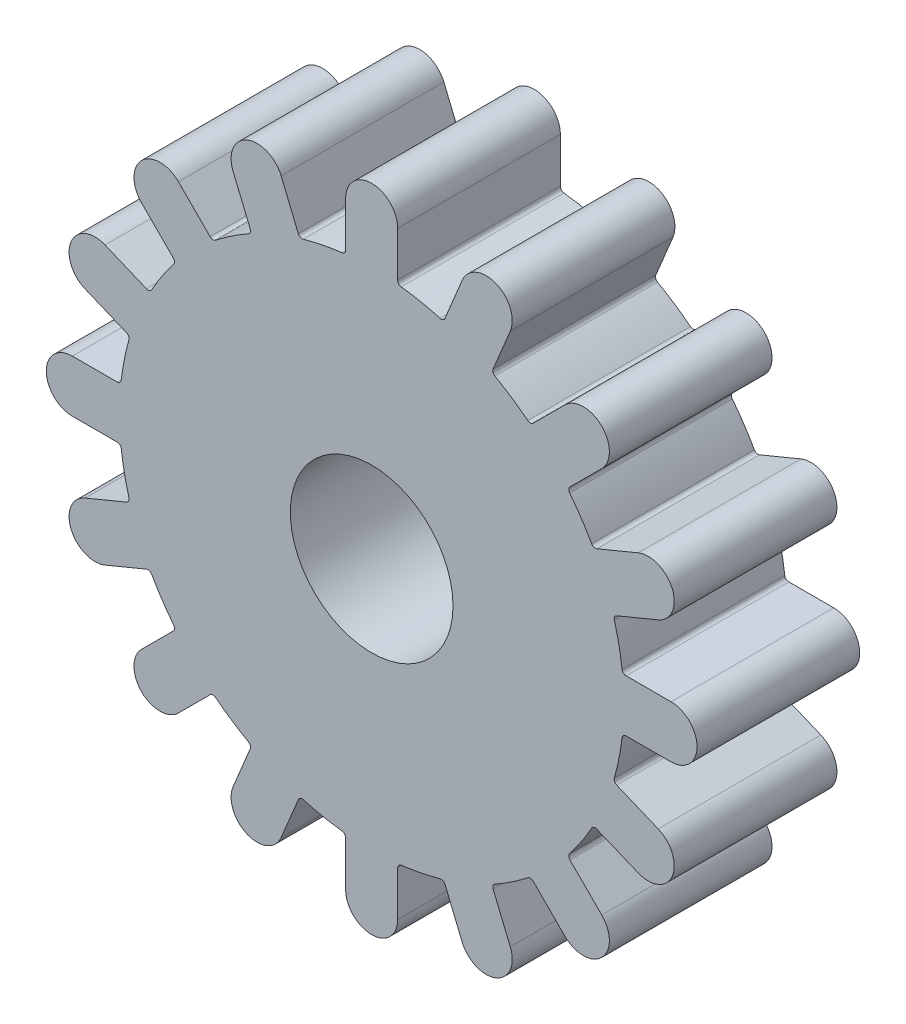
ISO-10303-21;
HEADER;
FILE_DESCRIPTION(('STEP AP214'),'2;1');
FILE_NAME('part.step','',(''),(''),'','','');
FILE_SCHEMA(('AUTOMOTIVE_DESIGN { 1 0 10303 214 1 1 1 1 }'));
ENDSEC;
DATA;
#1=APPLICATION_CONTEXT('core data for automotive mechanical design processes');
#2=APPLICATION_PROTOCOL_DEFINITION('international standard','automotive_design',2000,#1);
#3=PRODUCT_CONTEXT('',#1,'mechanical');
#4=PRODUCT('Part','Part','',(#3));
#5=PRODUCT_RELATED_PRODUCT_CATEGORY('part','',(#4));
#6=PRODUCT_DEFINITION_FORMATION('','',#4);
#7=PRODUCT_DEFINITION_CONTEXT('part definition',#1,'design');
#8=PRODUCT_DEFINITION('design','',#6,#7);
#9=PRODUCT_DEFINITION_SHAPE('','',#8);
#10=(LENGTH_UNIT() NAMED_UNIT(*) SI_UNIT(.MILLI.,.METRE.));
#11=(NAMED_UNIT(*) PLANE_ANGLE_UNIT() SI_UNIT($,.RADIAN.));
#12=(NAMED_UNIT(*) SI_UNIT($,.STERADIAN.) SOLID_ANGLE_UNIT());
#13=UNCERTAINTY_MEASURE_WITH_UNIT(LENGTH_MEASURE(1.E-05),#10,'distance_accuracy_value','');
#14=(GEOMETRIC_REPRESENTATION_CONTEXT(3) GLOBAL_UNCERTAINTY_ASSIGNED_CONTEXT((#13)) GLOBAL_UNIT_ASSIGNED_CONTEXT((#10,
#11,#12)) REPRESENTATION_CONTEXT('',''));
#15=CARTESIAN_POINT('',(0.,0.,0.));
#16=DIRECTION('',(0.,0.,1.));
#17=DIRECTION('',(1.,0.,0.));
#18=AXIS2_PLACEMENT_3D('',#15,#16,#17);
#19=CARTESIAN_POINT('',(1.85,15.6409718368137,10.));
#20=DIRECTION('',(0.,0.,1.));
#21=DIRECTION('',(1.,0.,0.));
#22=AXIS2_PLACEMENT_3D('',#19,#20,#21);
#23=PLANE('',#22);
#24=CARTESIAN_POINT('',(1.85,15.6409718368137,10.));
#25=DIRECTION('',(0.,0.,-1.));
#26=DIRECTION('',(1.,0.,0.));
#27=AXIS2_PLACEMENT_3D('',#24,#25,#26);
#28=CIRCLE('',#27,0.25);
#29=CARTESIAN_POINT('',(1.82063492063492,15.3927024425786,10.));
#30=VERTEX_POINT('',#29);
#31=CARTESIAN_POINT('',(1.6,15.6409718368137,10.));
#32=VERTEX_POINT('',#31);
#33=EDGE_CURVE('E848',#30,#32,#28,.T.);
#34=ORIENTED_EDGE('',*,*,#33,.T.);
#35=DIRECTION('',(0.,1.,0.));
#36=VECTOR('',#35,1.);
#37=CARTESIAN_POINT('',(1.6,18.4,10.));
#38=LINE('',#37,#36);
#39=CARTESIAN_POINT('',(1.6,18.4,10.));
#40=VERTEX_POINT('',#39);
#41=EDGE_CURVE('E356',#32,#40,#38,.T.);
#42=ORIENTED_EDGE('',*,*,#41,.T.);
#43=CARTESIAN_POINT('',(0.,18.4,10.));
#44=DIRECTION('',(0.,0.,1.));
#45=DIRECTION('',(1.,0.,0.));
#46=AXIS2_PLACEMENT_3D('',#43,#44,#45);
#47=CIRCLE('',#46,1.6);
#48=CARTESIAN_POINT('',(-1.6,18.4,10.));
#49=VERTEX_POINT('',#48);
#50=EDGE_CURVE('E1127',#40,#49,#47,.T.);
#51=ORIENTED_EDGE('',*,*,#50,.T.);
#52=DIRECTION('',(0.,-1.,0.));
#53=VECTOR('',#52,1.);
#54=CARTESIAN_POINT('',(-1.6,18.4,10.));
#55=LINE('',#54,#53);
#56=CARTESIAN_POINT('',(-1.6,15.6409718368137,10.));
#57=VERTEX_POINT('',#56);
#58=EDGE_CURVE('E1146',#49,#57,#55,.T.);
#59=ORIENTED_EDGE('',*,*,#58,.T.);
#60=CARTESIAN_POINT('',(-1.85,15.6409718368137,10.));
#61=DIRECTION('',(0.,0.,-1.));
#62=DIRECTION('',(-1.,0.,0.));
#63=AXIS2_PLACEMENT_3D('',#60,#61,#62);
#64=CIRCLE('',#63,0.25);
#65=CARTESIAN_POINT('',(-1.82063492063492,15.3927024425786,10.));
#66=VERTEX_POINT('',#65);
#67=EDGE_CURVE('E1143',#57,#66,#64,.T.);
#68=ORIENTED_EDGE('',*,*,#67,.T.);
#69=CARTESIAN_POINT('',(0.,0.,10.));
#70=DIRECTION('',(0.,0.,1.));
#71=DIRECTION('',(1.,0.,0.));
#72=AXIS2_PLACEMENT_3D('',#69,#70,#71);
#73=CIRCLE('',#72,15.5);
#74=CARTESIAN_POINT('',(-4.20848486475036,14.9177295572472,10.));
#75=VERTEX_POINT('',#74);
#76=EDGE_CURVE('E1145',#66,#75,#73,.T.);
#77=ORIENTED_EDGE('',*,*,#76,.T.);
#78=CARTESIAN_POINT('',(-4.27636365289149,15.1583380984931,10.));
#79=DIRECTION('',(0.,0.,-1.));
#80=DIRECTION('',(1.,0.,0.));
#81=AXIS2_PLACEMENT_3D('',#78,#79,#80);
#82=CIRCLE('',#81,0.249999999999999);
#83=CARTESIAN_POINT('',(-4.50733353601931,15.0626672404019,10.));
#84=VERTEX_POINT('',#83);
#85=EDGE_CURVE('E1148',#75,#84,#82,.T.);
#86=ORIENTED_EDGE('',*,*,#85,.T.);
#87=DIRECTION('',(-0.382683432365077,0.923879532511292,0.));
#88=VECTOR('',#87,1.);
#89=CARTESIAN_POINT('',(-5.56316790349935,17.6116768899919,10.));
#90=LINE('',#89,#88);
#91=CARTESIAN_POINT('',(-5.56316790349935,17.6116768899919,10.));
#92=VERTEX_POINT('',#91);
#93=EDGE_CURVE('E1154',#84,#92,#90,.T.);
#94=ORIENTED_EDGE('',*,*,#93,.T.);
#95=CARTESIAN_POINT('',(-7.04137515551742,16.9993833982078,10.));
#96=DIRECTION('',(0.,0.,1.));
#97=DIRECTION('',(1.,0.,0.));
#98=AXIS2_PLACEMENT_3D('',#95,#96,#97);
#99=CIRCLE('',#98,1.6);
#100=CARTESIAN_POINT('',(-8.51958240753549,16.3870899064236,10.));
#101=VERTEX_POINT('',#100);
#102=EDGE_CURVE('E1156',#92,#101,#99,.T.);
#103=ORIENTED_EDGE('',*,*,#102,.T.);
#104=DIRECTION('',(0.382683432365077,-0.923879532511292,0.));
#105=VECTOR('',#104,1.);
#106=CARTESIAN_POINT('',(-8.51958240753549,16.3870899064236,10.));
#107=LINE('',#106,#105);
#108=CARTESIAN_POINT('',(-7.46374804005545,13.8380802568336,10.));
#109=VERTEX_POINT('',#108);
#110=EDGE_CURVE('E1158',#101,#109,#107,.T.);
#111=ORIENTED_EDGE('',*,*,#110,.T.);
#112=CARTESIAN_POINT('',(-7.69471792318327,13.7424093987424,10.));
#113=DIRECTION('',(0.,0.,-1.));
#114=DIRECTION('',(-1.,0.,0.));
#115=AXIS2_PLACEMENT_3D('',#112,#113,#114);
#116=CIRCLE('',#115,0.25);
#117=CARTESIAN_POINT('',(-7.57257954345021,13.5242759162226,10.));
#118=VERTEX_POINT('',#117);
#119=EDGE_CURVE('E1160',#109,#118,#116,.T.);
#120=ORIENTED_EDGE('',*,*,#119,.T.);
#121=CARTESIAN_POINT('',(0.,0.,10.));
#122=DIRECTION('',(0.,0.,1.));
#123=DIRECTION('',(1.,0.,0.));
#124=AXIS2_PLACEMENT_3D('',#121,#122,#123);
#125=CIRCLE('',#124,15.5);
#126=CARTESIAN_POINT('',(-9.59690097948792,12.1716675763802,10.));
#127=VERTEX_POINT('',#126);
#128=EDGE_CURVE('E1162',#118,#127,#125,.T.);
#129=ORIENTED_EDGE('',*,*,#128,.T.);
#130=CARTESIAN_POINT('',(-9.75168970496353,12.367984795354,10.));
#131=DIRECTION('',(0.,0.,-1.));
#132=DIRECTION('',(1.,0.,0.));
#133=AXIS2_PLACEMENT_3D('',#130,#131,#132);
#134=CIRCLE('',#133,0.249999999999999);
#135=CARTESIAN_POINT('',(-9.92846640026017,12.1912081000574,10.));
#136=VERTEX_POINT('',#135);
#137=EDGE_CURVE('E1164',#127,#136,#134,.T.);
#138=ORIENTED_EDGE('',*,*,#137,.T.);
#139=DIRECTION('',(-0.707106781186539,0.707106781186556,0.));
#140=VECTOR('',#139,1.);
#141=CARTESIAN_POINT('',(-11.8793939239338,14.1421356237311,10.));
#142=LINE('',#141,#140);
#143=CARTESIAN_POINT('',(-11.8793939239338,14.1421356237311,10.));
#144=VERTEX_POINT('',#143);
#145=EDGE_CURVE('E1166',#136,#144,#142,.T.);
#146=ORIENTED_EDGE('',*,*,#145,.T.);
#147=CARTESIAN_POINT('',(-13.0107647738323,13.0107647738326,10.));
#148=DIRECTION('',(0.,0.,1.));
#149=DIRECTION('',(1.,0.,0.));
#150=AXIS2_PLACEMENT_3D('',#147,#148,#149);
#151=CIRCLE('',#150,1.6);
#152=CARTESIAN_POINT('',(-14.1421356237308,11.8793939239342,10.));
#153=VERTEX_POINT('',#152);
#154=EDGE_CURVE('E1168',#144,#153,#151,.T.);
#155=ORIENTED_EDGE('',*,*,#154,.T.);
#156=DIRECTION('',(0.707106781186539,-0.707106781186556,0.));
#157=VECTOR('',#156,1.);
#158=CARTESIAN_POINT('',(-14.1421356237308,11.8793939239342,10.));
#159=LINE('',#158,#157);
#160=CARTESIAN_POINT('',(-12.1912081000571,9.92846640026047,10.));
#161=VERTEX_POINT('',#160);
#162=EDGE_CURVE('E1170',#153,#161,#159,.T.);
#163=ORIENTED_EDGE('',*,*,#162,.T.);
#164=CARTESIAN_POINT('',(-12.3679847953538,9.75168970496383,10.));
#165=DIRECTION('',(0.,0.,-1.));
#166=DIRECTION('',(-1.,0.,0.));
#167=AXIS2_PLACEMENT_3D('',#164,#165,#166);
#168=CIRCLE('',#167,0.25);
#169=CARTESIAN_POINT('',(-12.1716675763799,9.59690097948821,10.));
#170=VERTEX_POINT('',#169);
#171=EDGE_CURVE('E1172',#161,#170,#168,.T.);
#172=ORIENTED_EDGE('',*,*,#171,.T.);
#173=CARTESIAN_POINT('',(0.,0.,10.));
#174=DIRECTION('',(0.,0.,1.));
#175=DIRECTION('',(1.,0.,0.));
#176=AXIS2_PLACEMENT_3D('',#173,#174,#175);
#177=CIRCLE('',#176,15.5);
#178=CARTESIAN_POINT('',(-13.5242759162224,7.57257954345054,10.));
#179=VERTEX_POINT('',#178);
#180=EDGE_CURVE('E1174',#170,#179,#177,.T.);
#181=ORIENTED_EDGE('',*,*,#180,.T.);
#182=CARTESIAN_POINT('',(-13.7424093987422,7.69471792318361,10.));
#183=DIRECTION('',(0.,0.,-1.));
#184=DIRECTION('',(1.,0.,0.));
#185=AXIS2_PLACEMENT_3D('',#182,#183,#184);
#186=CIRCLE('',#185,0.25);
#187=CARTESIAN_POINT('',(-13.8380802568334,7.46374804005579,10.));
#188=VERTEX_POINT('',#187);
#189=EDGE_CURVE('E1176',#179,#188,#186,.T.);
#190=ORIENTED_EDGE('',*,*,#189,.T.);
#191=DIRECTION('',(-0.923879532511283,0.382683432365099,0.));
#192=VECTOR('',#191,1.);
#193=CARTESIAN_POINT('',(-16.3870899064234,8.51958240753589,10.));
#194=LINE('',#193,#192);
#195=CARTESIAN_POINT('',(-16.3870899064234,8.51958240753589,10.));
#196=VERTEX_POINT('',#195);
#197=EDGE_CURVE('E1178',#188,#196,#194,.T.);
#198=ORIENTED_EDGE('',*,*,#197,.T.);
#199=CARTESIAN_POINT('',(-16.9993833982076,7.04137515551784,10.));
#200=DIRECTION('',(0.,0.,1.));
#201=DIRECTION('',(1.,0.,0.));
#202=AXIS2_PLACEMENT_3D('',#199,#200,#201);
#203=CIRCLE('',#202,1.6);
#204=CARTESIAN_POINT('',(-17.6116768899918,5.56316790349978,10.));
#205=VERTEX_POINT('',#204);
#206=EDGE_CURVE('E1180',#196,#205,#203,.T.);
#207=ORIENTED_EDGE('',*,*,#206,.T.);
#208=DIRECTION('',(0.923879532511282,-0.3826834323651,0.));
#209=VECTOR('',#208,1.);
#210=CARTESIAN_POINT('',(-17.6116768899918,5.56316790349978,10.));
#211=LINE('',#210,#209);
#212=CARTESIAN_POINT('',(-15.0626672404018,4.50733353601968,10.));
#213=VERTEX_POINT('',#212);
#214=EDGE_CURVE('E1182',#205,#213,#211,.T.);
#215=ORIENTED_EDGE('',*,*,#214,.T.);
#216=CARTESIAN_POINT('',(-15.158338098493,4.27636365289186,10.));
#217=DIRECTION('',(0.,0.,-1.));
#218=DIRECTION('',(-1.,0.,0.));
#219=AXIS2_PLACEMENT_3D('',#216,#217,#218);
#220=CIRCLE('',#219,0.249999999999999);
#221=CARTESIAN_POINT('',(-14.9177295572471,4.20848486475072,10.));
#222=VERTEX_POINT('',#221);
#223=EDGE_CURVE('E1184',#213,#222,#220,.T.);
#224=ORIENTED_EDGE('',*,*,#223,.T.);
#225=CARTESIAN_POINT('',(0.,0.,10.));
#226=DIRECTION('',(0.,0.,1.));
#227=DIRECTION('',(1.,0.,0.));
#228=AXIS2_PLACEMENT_3D('',#225,#226,#227);
#229=CIRCLE('',#228,15.5);
#230=CARTESIAN_POINT('',(-15.3927024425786,1.82063492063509,10.));
#231=VERTEX_POINT('',#230);
#232=EDGE_CURVE('E1186',#222,#231,#229,.T.);
#233=ORIENTED_EDGE('',*,*,#232,.T.);
#234=CARTESIAN_POINT('',(-15.6409718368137,1.85000000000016,10.));
#235=DIRECTION('',(0.,0.,-1.));
#236=DIRECTION('',(1.,0.,0.));
#237=AXIS2_PLACEMENT_3D('',#234,#235,#236);
#238=CIRCLE('',#237,0.249999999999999);
#239=CARTESIAN_POINT('',(-15.6409718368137,1.60000000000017,10.));
#240=VERTEX_POINT('',#239);
#241=EDGE_CURVE('E1188',#231,#240,#238,.T.);
#242=ORIENTED_EDGE('',*,*,#241,.T.);
#243=DIRECTION('',(-1.,0.,0.));
#244=VECTOR('',#243,1.);
#245=CARTESIAN_POINT('',(-18.4,1.60000000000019,10.));
#246=LINE('',#245,#244);
#247=CARTESIAN_POINT('',(-18.4,1.60000000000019,10.));
#248=VERTEX_POINT('',#247);
#249=EDGE_CURVE('E1190',#240,#248,#246,.T.);
#250=ORIENTED_EDGE('',*,*,#249,.T.);
#251=CARTESIAN_POINT('',(-18.4,1.92729769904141E-13,10.));
#252=DIRECTION('',(0.,0.,1.));
#253=DIRECTION('',(1.,0.,0.));
#254=AXIS2_PLACEMENT_3D('',#251,#252,#253);
#255=CIRCLE('',#254,1.6);
#256=CARTESIAN_POINT('',(-18.4,-1.59999999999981,10.));
#257=VERTEX_POINT('',#256);
#258=EDGE_CURVE('E1192',#248,#257,#255,.T.);
#259=ORIENTED_EDGE('',*,*,#258,.T.);
#260=DIRECTION('',(1.,0.,0.));
#261=VECTOR('',#260,1.);
#262=CARTESIAN_POINT('',(-18.4,-1.59999999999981,10.));
#263=LINE('',#262,#261);
#264=CARTESIAN_POINT('',(-15.6409718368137,-1.59999999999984,10.));
#265=VERTEX_POINT('',#264);
#266=EDGE_CURVE('E1194',#257,#265,#263,.T.);
#267=ORIENTED_EDGE('',*,*,#266,.T.);
#268=CARTESIAN_POINT('',(-15.6409718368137,-1.84999999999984,10.));
#269=DIRECTION('',(0.,0.,-1.));
#270=DIRECTION('',(-1.,0.,0.));
#271=AXIS2_PLACEMENT_3D('',#268,#269,#270);
#272=CIRCLE('',#271,0.250000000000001);
#273=CARTESIAN_POINT('',(-15.3927024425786,-1.82063492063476,10.));
#274=VERTEX_POINT('',#273);
#275=EDGE_CURVE('E1196',#265,#274,#272,.T.);
#276=ORIENTED_EDGE('',*,*,#275,.T.);
#277=CARTESIAN_POINT('',(0.,0.,10.));
#278=DIRECTION('',(0.,0.,1.));
#279=DIRECTION('',(1.,0.,0.));
#280=AXIS2_PLACEMENT_3D('',#277,#278,#279);
#281=CIRCLE('',#280,15.5);
#282=CARTESIAN_POINT('',(-14.9177295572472,-4.20848486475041,10.));
#283=VERTEX_POINT('',#282);
#284=EDGE_CURVE('E1198',#274,#283,#281,.T.);
#285=ORIENTED_EDGE('',*,*,#284,.T.);
#286=CARTESIAN_POINT('',(-15.1583380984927,-4.27636365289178,10.));
#287=DIRECTION('',(0.,0.,-1.));
#288=DIRECTION('',(1.,0.,0.));
#289=AXIS2_PLACEMENT_3D('',#286,#287,#288);
#290=CIRCLE('',#289,0.249999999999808);
#291=CARTESIAN_POINT('',(-15.0626672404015,-4.50733353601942,10.));
#292=VERTEX_POINT('',#291);
#293=EDGE_CURVE('E1200',#283,#292,#290,.T.);
#294=ORIENTED_EDGE('',*,*,#293,.T.);
#295=DIRECTION('',(-0.923879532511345,-0.382683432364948,0.));
#296=VECTOR('',#295,1.);
#297=CARTESIAN_POINT('',(-17.6116768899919,-5.56316790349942,10.));
#298=LINE('',#297,#296);
#299=CARTESIAN_POINT('',(-17.6116768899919,-5.56316790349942,10.));
#300=VERTEX_POINT('',#299);
#301=EDGE_CURVE('E1202',#292,#300,#298,.T.);
#302=ORIENTED_EDGE('',*,*,#301,.T.);
#303=CARTESIAN_POINT('',(-16.9993833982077,-7.04137515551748,10.));
#304=DIRECTION('',(0.,0.,1.));
#305=DIRECTION('',(1.,0.,0.));
#306=AXIS2_PLACEMENT_3D('',#303,#304,#305);
#307=CIRCLE('',#306,1.6);
#308=CARTESIAN_POINT('',(-16.3870899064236,-8.51958240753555,10.));
#309=VERTEX_POINT('',#308);
#310=EDGE_CURVE('E1204',#300,#309,#307,.T.);
#311=ORIENTED_EDGE('',*,*,#310,.T.);
#312=DIRECTION('',(0.923879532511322,0.382683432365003,0.));
#313=VECTOR('',#312,1.);
#314=CARTESIAN_POINT('',(-16.3870899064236,-8.51958240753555,10.));
#315=LINE('',#314,#313);
#316=CARTESIAN_POINT('',(-13.8380802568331,-7.46374804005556,10.));
#317=VERTEX_POINT('',#316);
#318=EDGE_CURVE('E1206',#309,#317,#315,.T.);
#319=ORIENTED_EDGE('',*,*,#318,.T.);
#320=CARTESIAN_POINT('',(-13.7424093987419,-7.69471792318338,10.));
#321=DIRECTION('',(0.,0.,-1.));
#322=DIRECTION('',(-1.,0.,0.));
#323=AXIS2_PLACEMENT_3D('',#320,#321,#322);
#324=CIRCLE('',#323,0.250000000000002);
#325=CARTESIAN_POINT('',(-13.5242759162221,-7.57257954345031,10.));
#326=VERTEX_POINT('',#325);
#327=EDGE_CURVE('E1208',#317,#326,#324,.T.);
#328=ORIENTED_EDGE('',*,*,#327,.T.);
#329=CARTESIAN_POINT('',(0.,0.,10.));
#330=DIRECTION('',(0.,0.,1.));
#331=DIRECTION('',(1.,0.,0.));
#332=AXIS2_PLACEMENT_3D('',#329,#330,#331);
#333=CIRCLE('',#332,15.4999999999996);
#334=CARTESIAN_POINT('',(-12.1716675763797,-9.59690097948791,10.));
#335=VERTEX_POINT('',#334);
#336=EDGE_CURVE('E1210',#326,#335,#333,.T.);
#337=ORIENTED_EDGE('',*,*,#336,.T.);
#338=CARTESIAN_POINT('',(-12.3679847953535,-9.75168970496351,10.));
#339=DIRECTION('',(0.,0.,-1.));
#340=DIRECTION('',(1.,0.,0.));
#341=AXIS2_PLACEMENT_3D('',#338,#339,#340);
#342=CIRCLE('',#341,0.250000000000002);
#343=CARTESIAN_POINT('',(-12.1912081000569,-9.92846640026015,10.));
#344=VERTEX_POINT('',#343);
#345=EDGE_CURVE('E1212',#335,#344,#342,.T.);
#346=ORIENTED_EDGE('',*,*,#345,.T.);
#347=DIRECTION('',(-0.70710678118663,-0.707106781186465,0.));
#348=VECTOR('',#347,1.);
#349=CARTESIAN_POINT('',(-14.1421356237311,-11.8793939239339,10.));
#350=LINE('',#349,#348);
#351=CARTESIAN_POINT('',(-14.1421356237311,-11.8793939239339,10.));
#352=VERTEX_POINT('',#351);
#353=EDGE_CURVE('E1214',#344,#352,#350,.T.);
#354=ORIENTED_EDGE('',*,*,#353,.T.);
#355=CARTESIAN_POINT('',(-13.0107647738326,-13.0107647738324,10.));
#356=DIRECTION('',(0.,0.,1.));
#357=DIRECTION('',(1.,0.,0.));
#358=AXIS2_PLACEMENT_3D('',#355,#356,#357);
#359=CIRCLE('',#358,1.6);
#360=CARTESIAN_POINT('',(-11.8793939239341,-14.1421356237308,10.));
#361=VERTEX_POINT('',#360);
#362=EDGE_CURVE('E1216',#352,#361,#359,.T.);
#363=ORIENTED_EDGE('',*,*,#362,.T.);
#364=DIRECTION('',(0.707106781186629,0.707106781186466,0.));
#365=VECTOR('',#364,1.);
#366=CARTESIAN_POINT('',(-11.8793939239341,-14.1421356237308,10.));
#367=LINE('',#366,#365);
#368=CARTESIAN_POINT('',(-9.92846640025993,-12.1912081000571,10.));
#369=VERTEX_POINT('',#368);
#370=EDGE_CURVE('E1218',#361,#369,#367,.T.);
#371=ORIENTED_EDGE('',*,*,#370,.T.);
#372=CARTESIAN_POINT('',(-9.75168970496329,-12.3679847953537,10.));
#373=DIRECTION('',(0.,0.,-1.));
#374=DIRECTION('',(-1.,0.,0.));
#375=AXIS2_PLACEMENT_3D('',#372,#373,#374);
#376=CIRCLE('',#375,0.250000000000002);
#377=CARTESIAN_POINT('',(-9.59690097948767,-12.1716675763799,10.));
#378=VERTEX_POINT('',#377);
#379=EDGE_CURVE('E1220',#369,#378,#376,.T.);
#380=ORIENTED_EDGE('',*,*,#379,.T.);
#381=CARTESIAN_POINT('',(0.,0.,10.));
#382=DIRECTION('',(0.,0.,1.));
#383=DIRECTION('',(1.,0.,0.));
#384=AXIS2_PLACEMENT_3D('',#381,#382,#383);
#385=CIRCLE('',#384,15.4999999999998);
#386=CARTESIAN_POINT('',(-7.57257954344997,-13.5242759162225,10.));
#387=VERTEX_POINT('',#386);
#388=EDGE_CURVE('E1222',#378,#387,#385,.T.);
#389=ORIENTED_EDGE('',*,*,#388,.T.);
#390=CARTESIAN_POINT('',(-7.69471792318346,-13.7424093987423,10.));
#391=DIRECTION('',(0.,0.,-1.));
#392=DIRECTION('',(1.,0.,0.));
#393=AXIS2_PLACEMENT_3D('',#390,#391,#392);
#394=CIRCLE('',#393,0.250000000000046);
#395=CARTESIAN_POINT('',(-7.46374804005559,-13.8380802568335,10.));
#396=VERTEX_POINT('',#395);
#397=EDGE_CURVE('E1224',#387,#396,#394,.T.);
#398=ORIENTED_EDGE('',*,*,#397,.T.);
#399=DIRECTION('',(-0.382683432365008,-0.923879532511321,0.));
#400=VECTOR('',#399,1.);
#401=CARTESIAN_POINT('',(-8.5195824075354,-16.3870899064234,10.));
#402=LINE('',#401,#400);
#403=CARTESIAN_POINT('',(-8.5195824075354,-16.3870899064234,10.));
#404=VERTEX_POINT('',#403);
#405=EDGE_CURVE('E1226',#396,#404,#402,.T.);
#406=ORIENTED_EDGE('',*,*,#405,.T.);
#407=CARTESIAN_POINT('',(-7.04137515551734,-16.9993833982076,10.));
#408=DIRECTION('',(0.,0.,1.));
#409=DIRECTION('',(1.,0.,0.));
#410=AXIS2_PLACEMENT_3D('',#407,#408,#409);
#411=CIRCLE('',#410,1.6);
#412=CARTESIAN_POINT('',(-5.56316790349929,-17.6116768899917,10.));
#413=VERTEX_POINT('',#412);
#414=EDGE_CURVE('E1228',#404,#413,#411,.T.);
#415=ORIENTED_EDGE('',*,*,#414,.T.);
#416=DIRECTION('',(0.382683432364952,0.923879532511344,0.));
#417=VECTOR('',#416,1.);
#418=CARTESIAN_POINT('',(-5.56316790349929,-17.6116768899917,10.));
#419=LINE('',#418,#417);
#420=CARTESIAN_POINT('',(-4.50733353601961,-15.0626672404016,10.));
#421=VERTEX_POINT('',#420);
#422=EDGE_CURVE('E1230',#413,#421,#419,.T.);
#423=ORIENTED_EDGE('',*,*,#422,.T.);
#424=CARTESIAN_POINT('',(-4.27636365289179,-15.1583380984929,10.));
#425=DIRECTION('',(0.,0.,-1.));
#426=DIRECTION('',(-1.,0.,0.));
#427=AXIS2_PLACEMENT_3D('',#424,#425,#426);
#428=CIRCLE('',#427,0.250000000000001);
#429=CARTESIAN_POINT('',(-4.20848486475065,-14.9177295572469,10.));
#430=VERTEX_POINT('',#429);
#431=EDGE_CURVE('E1232',#421,#430,#428,.T.);
#432=ORIENTED_EDGE('',*,*,#431,.T.);
#433=CARTESIAN_POINT('',(0.,0.,10.));
#434=DIRECTION('',(0.,0.,1.));
#435=DIRECTION('',(1.,0.,0.));
#436=AXIS2_PLACEMENT_3D('',#433,#434,#435);
#437=CIRCLE('',#436,15.4999999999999);
#438=CARTESIAN_POINT('',(-1.82063492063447,-15.3927024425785,10.));
#439=VERTEX_POINT('',#438);
#440=EDGE_CURVE('E1234',#430,#439,#437,.T.);
#441=ORIENTED_EDGE('',*,*,#440,.T.);
#442=CARTESIAN_POINT('',(-1.85,-15.6409718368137,10.));
#443=DIRECTION('',(0.,0.,-1.));
#444=DIRECTION('',(1.,0.,0.));
#445=AXIS2_PLACEMENT_3D('',#442,#443,#444);
#446=CIRCLE('',#445,0.250000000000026);
#447=CARTESIAN_POINT('',(-1.59999999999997,-15.6409718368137,10.));
#448=VERTEX_POINT('',#447);
#449=EDGE_CURVE('E1236',#439,#448,#446,.T.);
#450=ORIENTED_EDGE('',*,*,#449,.T.);
#451=DIRECTION('',(0.,-1.,0.));
#452=VECTOR('',#451,1.);
#453=CARTESIAN_POINT('',(-1.60000000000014,-18.3999999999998,10.));
#454=LINE('',#453,#452);
#455=CARTESIAN_POINT('',(-1.60000000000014,-18.3999999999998,10.));
#456=VERTEX_POINT('',#455);
#457=EDGE_CURVE('E1238',#448,#456,#454,.T.);
#458=ORIENTED_EDGE('',*,*,#457,.T.);
#459=CARTESIAN_POINT('',(-1.35419162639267E-13,-18.3999999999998,10.));
#460=DIRECTION('',(0.,0.,1.));
#461=DIRECTION('',(1.,0.,0.));
#462=AXIS2_PLACEMENT_3D('',#459,#460,#461);
#463=CIRCLE('',#462,1.6);
#464=CARTESIAN_POINT('',(1.59999999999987,-18.3999999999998,10.));
#465=VERTEX_POINT('',#464);
#466=EDGE_CURVE('E1240',#456,#465,#463,.T.);
#467=ORIENTED_EDGE('',*,*,#466,.T.);
#468=DIRECTION('',(0.,1.,0.));
#469=VECTOR('',#468,1.);
#470=CARTESIAN_POINT('',(1.59999999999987,-18.3999999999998,10.));
#471=LINE('',#470,#469);
#472=CARTESIAN_POINT('',(1.59999999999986,-15.6409718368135,10.));
#473=VERTEX_POINT('',#472);
#474=EDGE_CURVE('E1242',#465,#473,#471,.T.);
#475=ORIENTED_EDGE('',*,*,#474,.T.);
#476=CARTESIAN_POINT('',(1.84999999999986,-15.6409718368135,10.));
#477=DIRECTION('',(0.,0.,-1.));
#478=DIRECTION('',(-1.,0.,0.));
#479=AXIS2_PLACEMENT_3D('',#476,#477,#478);
#480=CIRCLE('',#479,0.250000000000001);
#481=CARTESIAN_POINT('',(1.82063492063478,-15.3927024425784,10.));
#482=VERTEX_POINT('',#481);
#483=EDGE_CURVE('E1244',#473,#482,#480,.T.);
#484=ORIENTED_EDGE('',*,*,#483,.T.);
#485=CARTESIAN_POINT('',(0.,0.,10.));
#486=DIRECTION('',(0.,0.,1.));
#487=DIRECTION('',(1.,0.,0.));
#488=AXIS2_PLACEMENT_3D('',#485,#486,#487);
#489=CIRCLE('',#488,15.4999999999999);
#490=CARTESIAN_POINT('',(4.20848486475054,-14.9177295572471,10.));
#491=VERTEX_POINT('',#490);
#492=EDGE_CURVE('E1246',#482,#491,#489,.T.);
#493=ORIENTED_EDGE('',*,*,#492,.T.);
#494=CARTESIAN_POINT('',(4.2763636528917,-15.1583380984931,10.));
#495=DIRECTION('',(0.,0.,-1.));
#496=DIRECTION('',(1.,0.,0.));
#497=AXIS2_PLACEMENT_3D('',#494,#495,#496);
#498=CIRCLE('',#497,0.250000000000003);
#499=CARTESIAN_POINT('',(4.50733353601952,-15.0626672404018,10.));
#500=VERTEX_POINT('',#499);
#501=EDGE_CURVE('E1248',#491,#500,#498,.T.);
#502=ORIENTED_EDGE('',*,*,#501,.T.);
#503=DIRECTION('',(0.382683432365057,-0.9238795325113,0.));
#504=VECTOR('',#503,1.);
#505=CARTESIAN_POINT('',(5.56316790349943,-17.6116768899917,10.));
#506=LINE('',#505,#504);
#507=CARTESIAN_POINT('',(5.56316790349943,-17.6116768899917,10.));
#508=VERTEX_POINT('',#507);
#509=EDGE_CURVE('E1250',#500,#508,#506,.T.);
#510=ORIENTED_EDGE('',*,*,#509,.T.);
#511=CARTESIAN_POINT('',(7.04137515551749,-16.9993833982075,10.));
#512=DIRECTION('',(0.,0.,1.));
#513=DIRECTION('',(1.,0.,0.));
#514=AXIS2_PLACEMENT_3D('',#511,#512,#513);
#515=CIRCLE('',#514,1.6);
#516=CARTESIAN_POINT('',(8.51958240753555,-16.3870899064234,10.));
#517=VERTEX_POINT('',#516);
#518=EDGE_CURVE('E1252',#508,#517,#515,.T.);
#519=ORIENTED_EDGE('',*,*,#518,.T.);
#520=DIRECTION('',(-0.382683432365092,0.923879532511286,0.));
#521=VECTOR('',#520,1.);
#522=CARTESIAN_POINT('',(8.51958240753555,-16.3870899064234,10.));
#523=LINE('',#522,#521);
#524=CARTESIAN_POINT('',(7.46374804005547,-13.8380802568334,10.));
#525=VERTEX_POINT('',#524);
#526=EDGE_CURVE('E1254',#517,#525,#523,.T.);
#527=ORIENTED_EDGE('',*,*,#526,.T.);
#528=CARTESIAN_POINT('',(7.69471792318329,-13.7424093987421,10.));
#529=DIRECTION('',(0.,0.,-1.));
#530=DIRECTION('',(-1.,0.,0.));
#531=AXIS2_PLACEMENT_3D('',#528,#529,#530);
#532=CIRCLE('',#531,0.249999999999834);
#533=CARTESIAN_POINT('',(7.57257954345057,-13.5242759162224,10.));
#534=VERTEX_POINT('',#533);
#535=EDGE_CURVE('E1256',#525,#534,#532,.T.);
#536=ORIENTED_EDGE('',*,*,#535,.T.);
#537=CARTESIAN_POINT('',(0.,0.,10.));
#538=DIRECTION('',(0.,0.,1.));
#539=DIRECTION('',(1.,0.,0.));
#540=AXIS2_PLACEMENT_3D('',#537,#538,#539);
#541=CIRCLE('',#540,15.4999999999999);
#542=CARTESIAN_POINT('',(9.59690097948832,-12.1716675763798,10.));
#543=VERTEX_POINT('',#542);
#544=EDGE_CURVE('E1258',#534,#543,#541,.T.);
#545=ORIENTED_EDGE('',*,*,#544,.T.);
#546=CARTESIAN_POINT('',(9.75168970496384,-12.3679847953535,10.));
#547=DIRECTION('',(0.,0.,-1.));
#548=DIRECTION('',(1.,0.,0.));
#549=AXIS2_PLACEMENT_3D('',#546,#547,#548);
#550=CIRCLE('',#549,0.250000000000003);
#551=CARTESIAN_POINT('',(9.92846640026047,-12.1912081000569,10.));
#552=VERTEX_POINT('',#551);
#553=EDGE_CURVE('E1260',#543,#552,#550,.T.);
#554=ORIENTED_EDGE('',*,*,#553,.T.);
#555=DIRECTION('',(0.707106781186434,-0.707106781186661,0.));
#556=VECTOR('',#555,1.);
#557=CARTESIAN_POINT('',(11.8793939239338,-14.1421356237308,10.));
#558=LINE('',#557,#556);
#559=CARTESIAN_POINT('',(11.8793939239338,-14.1421356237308,10.));
#560=VERTEX_POINT('',#559);
#561=EDGE_CURVE('E1262',#552,#560,#558,.T.);
#562=ORIENTED_EDGE('',*,*,#561,.T.);
#563=CARTESIAN_POINT('',(13.0107647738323,-13.0107647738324,10.));
#564=DIRECTION('',(0.,0.,1.));
#565=DIRECTION('',(1.,0.,0.));
#566=AXIS2_PLACEMENT_3D('',#563,#564,#565);
#567=CIRCLE('',#566,1.6);
#568=CARTESIAN_POINT('',(14.1421356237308,-11.8793939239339,10.));
#569=VERTEX_POINT('',#568);
#570=EDGE_CURVE('E1264',#560,#569,#567,.T.);
#571=ORIENTED_EDGE('',*,*,#570,.T.);
#572=DIRECTION('',(-0.707106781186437,0.707106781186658,0.));
#573=VECTOR('',#572,1.);
#574=CARTESIAN_POINT('',(14.1421356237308,-11.8793939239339,10.));
#575=LINE('',#574,#573);
#576=CARTESIAN_POINT('',(12.1912081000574,-9.92846640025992,10.));
#577=VERTEX_POINT('',#576);
#578=EDGE_CURVE('E1266',#569,#577,#575,.T.);
#579=ORIENTED_EDGE('',*,*,#578,.T.);
#580=CARTESIAN_POINT('',(12.3679847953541,-9.75168970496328,10.));
#581=DIRECTION('',(0.,0.,-1.));
#582=DIRECTION('',(-1.,0.,0.));
#583=AXIS2_PLACEMENT_3D('',#580,#581,#582);
#584=CIRCLE('',#583,0.25);
#585=CARTESIAN_POINT('',(12.1716675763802,-9.59690097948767,10.));
#586=VERTEX_POINT('',#585);
#587=EDGE_CURVE('E1268',#577,#586,#584,.T.);
#588=ORIENTED_EDGE('',*,*,#587,.T.);
#589=CARTESIAN_POINT('',(0.,0.,10.));
#590=DIRECTION('',(0.,0.,1.));
#591=DIRECTION('',(1.,0.,0.));
#592=AXIS2_PLACEMENT_3D('',#589,#590,#591);
#593=CIRCLE('',#592,15.4999999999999);
#594=CARTESIAN_POINT('',(13.5242759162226,-7.57257954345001,10.));
#595=VERTEX_POINT('',#594);
#596=EDGE_CURVE('E1270',#586,#595,#593,.T.);
#597=ORIENTED_EDGE('',*,*,#596,.T.);
#598=CARTESIAN_POINT('',(13.7424093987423,-7.69471792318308,10.));
#599=DIRECTION('',(0.,0.,-1.));
#600=DIRECTION('',(1.,0.,0.));
#601=AXIS2_PLACEMENT_3D('',#598,#599,#600);
#602=CIRCLE('',#601,0.250000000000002);
#603=CARTESIAN_POINT('',(13.8380802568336,-7.46374804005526,10.));
#604=VERTEX_POINT('',#603);
#605=EDGE_CURVE('E1272',#595,#604,#602,.T.);
#606=ORIENTED_EDGE('',*,*,#605,.T.);
#607=DIRECTION('',(0.923879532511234,-0.382683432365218,0.));
#608=VECTOR('',#607,1.);
#609=CARTESIAN_POINT('',(16.3870899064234,-8.51958240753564,10.));
#610=LINE('',#609,#608);
#611=CARTESIAN_POINT('',(16.3870899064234,-8.51958240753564,10.));
#612=VERTEX_POINT('',#611);
#613=EDGE_CURVE('E1274',#604,#612,#610,.T.);
#614=ORIENTED_EDGE('',*,*,#613,.T.);
#615=CARTESIAN_POINT('',(16.9993833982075,-7.04137515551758,10.));
#616=DIRECTION('',(0.,0.,1.));
#617=DIRECTION('',(1.,0.,0.));
#618=AXIS2_PLACEMENT_3D('',#615,#616,#617);
#619=CIRCLE('',#618,1.6);
#620=CARTESIAN_POINT('',(17.6116768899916,-5.56316790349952,10.));
#621=VERTEX_POINT('',#620);
#622=EDGE_CURVE('E1276',#612,#621,#619,.T.);
#623=ORIENTED_EDGE('',*,*,#622,.T.);
#624=DIRECTION('',(-0.923879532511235,0.382683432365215,0.));
#625=VECTOR('',#624,1.);
#626=CARTESIAN_POINT('',(17.6116768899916,-5.56316790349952,10.));
#627=LINE('',#626,#625);
#628=CARTESIAN_POINT('',(15.0626672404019,-4.50733353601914,10.));
#629=VERTEX_POINT('',#628);
#630=EDGE_CURVE('E1278',#621,#629,#627,.T.);
#631=ORIENTED_EDGE('',*,*,#630,.T.);
#632=CARTESIAN_POINT('',(15.1583380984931,-4.27636365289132,10.));
#633=DIRECTION('',(0.,0.,-1.));
#634=DIRECTION('',(-1.,0.,0.));
#635=AXIS2_PLACEMENT_3D('',#632,#633,#634);
#636=CIRCLE('',#635,0.250000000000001);
#637=CARTESIAN_POINT('',(14.9177295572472,-4.20848486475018,10.));
#638=VERTEX_POINT('',#637);
#639=EDGE_CURVE('E1280',#629,#638,#636,.T.);
#640=ORIENTED_EDGE('',*,*,#639,.T.);
#641=CARTESIAN_POINT('',(0.,0.,10.));
#642=DIRECTION('',(0.,0.,1.));
#643=DIRECTION('',(1.,0.,0.));
#644=AXIS2_PLACEMENT_3D('',#641,#642,#643);
#645=CIRCLE('',#644,15.5);
#646=CARTESIAN_POINT('',(15.3927024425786,-1.82063492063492,10.));
#647=VERTEX_POINT('',#646);
#648=EDGE_CURVE('E1282',#638,#647,#645,.T.);
#649=ORIENTED_EDGE('',*,*,#648,.T.);
#650=CARTESIAN_POINT('',(15.6409718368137,-1.85,10.));
#651=DIRECTION('',(0.,0.,-1.));
#652=DIRECTION('',(1.,0.,0.));
#653=AXIS2_PLACEMENT_3D('',#650,#651,#652);
#654=CIRCLE('',#653,0.250000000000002);
#655=CARTESIAN_POINT('',(15.6409718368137,-1.6,10.));
#656=VERTEX_POINT('',#655);
#657=EDGE_CURVE('E1284',#647,#656,#654,.T.);
#658=ORIENTED_EDGE('',*,*,#657,.T.);
#659=DIRECTION('',(1.,0.,0.));
#660=VECTOR('',#659,1.);
#661=CARTESIAN_POINT('',(18.4,-1.60000000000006,10.));
#662=LINE('',#661,#660);
#663=CARTESIAN_POINT('',(18.4,-1.60000000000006,10.));
#664=VERTEX_POINT('',#663);
#665=EDGE_CURVE('E1286',#656,#664,#662,.T.);
#666=ORIENTED_EDGE('',*,*,#665,.T.);
#667=CARTESIAN_POINT('',(18.4,0.,10.));
#668=DIRECTION('',(0.,0.,1.));
#669=DIRECTION('',(1.,0.,0.));
#670=AXIS2_PLACEMENT_3D('',#667,#668,#669);
#671=CIRCLE('',#670,1.6);
#672=CARTESIAN_POINT('',(18.4,1.59999999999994,10.));
#673=VERTEX_POINT('',#672);
#674=EDGE_CURVE('E1288',#664,#673,#671,.T.);
#675=ORIENTED_EDGE('',*,*,#674,.T.);
#676=DIRECTION('',(-1.,0.,0.));
#677=VECTOR('',#676,1.);
#678=CARTESIAN_POINT('',(18.4,1.59999999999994,10.));
#679=LINE('',#678,#677);
#680=CARTESIAN_POINT('',(15.6409718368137,1.59999999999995,10.));
#681=VERTEX_POINT('',#680);
#682=EDGE_CURVE('E1290',#673,#681,#679,.T.);
#683=ORIENTED_EDGE('',*,*,#682,.T.);
#684=CARTESIAN_POINT('',(15.6409718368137,1.84999999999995,10.));
#685=DIRECTION('',(0.,0.,-1.));
#686=DIRECTION('',(-1.,0.,0.));
#687=AXIS2_PLACEMENT_3D('',#684,#685,#686);
#688=CIRCLE('',#687,0.25);
#689=CARTESIAN_POINT('',(15.3927024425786,1.82063492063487,10.));
#690=VERTEX_POINT('',#689);
#691=EDGE_CURVE('E1292',#681,#690,#688,.T.);
#692=ORIENTED_EDGE('',*,*,#691,.T.);
#693=CARTESIAN_POINT('',(0.,0.,10.));
#694=DIRECTION('',(0.,0.,1.));
#695=DIRECTION('',(1.,0.,0.));
#696=AXIS2_PLACEMENT_3D('',#693,#694,#695);
#697=CIRCLE('',#696,15.5);
#698=CARTESIAN_POINT('',(14.9177295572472,4.20848486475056,10.));
#699=VERTEX_POINT('',#698);
#700=EDGE_CURVE('E1294',#690,#699,#697,.T.);
#701=ORIENTED_EDGE('',*,*,#700,.T.);
#702=CARTESIAN_POINT('',(15.158338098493,4.2763636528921,10.));
#703=DIRECTION('',(0.,0.,-1.));
#704=DIRECTION('',(1.,0.,0.));
#705=AXIS2_PLACEMENT_3D('',#702,#703,#704);
#706=CIRCLE('',#705,0.250000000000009);
#707=CARTESIAN_POINT('',(15.0626672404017,4.50733353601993,10.));
#708=VERTEX_POINT('',#707);
#709=EDGE_CURVE('E1296',#699,#708,#706,.T.);
#710=ORIENTED_EDGE('',*,*,#709,.T.);
#711=DIRECTION('',(0.923879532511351,0.382683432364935,0.));
#712=VECTOR('',#711,1.);
#713=CARTESIAN_POINT('',(17.6116768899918,5.56316790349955,10.));
#714=LINE('',#713,#712);
#715=CARTESIAN_POINT('',(17.6116768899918,5.56316790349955,10.));
#716=VERTEX_POINT('',#715);
#717=EDGE_CURVE('E1298',#708,#716,#714,.T.);
#718=ORIENTED_EDGE('',*,*,#717,.T.);
#719=CARTESIAN_POINT('',(16.9993833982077,7.04137515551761,10.));
#720=DIRECTION('',(0.,0.,1.));
#721=DIRECTION('',(1.,0.,0.));
#722=AXIS2_PLACEMENT_3D('',#719,#720,#721);
#723=CIRCLE('',#722,1.6);
#724=CARTESIAN_POINT('',(16.3870899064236,8.51958240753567,10.));
#725=VERTEX_POINT('',#724);
#726=EDGE_CURVE('E1300',#716,#725,#723,.T.);
#727=ORIENTED_EDGE('',*,*,#726,.T.);
#728=DIRECTION('',(-0.923879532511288,-0.382683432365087,0.));
#729=VECTOR('',#728,1.);
#730=CARTESIAN_POINT('',(16.3870899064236,8.51958240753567,10.));
#731=LINE('',#730,#729);
#732=CARTESIAN_POINT('',(13.8380802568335,7.4637480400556,10.));
#733=VERTEX_POINT('',#732);
#734=EDGE_CURVE('E1302',#725,#733,#731,.T.);
#735=ORIENTED_EDGE('',*,*,#734,.T.);
#736=CARTESIAN_POINT('',(13.7424093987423,7.69471792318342,10.));
#737=DIRECTION('',(0.,0.,-1.));
#738=DIRECTION('',(-1.,0.,0.));
#739=AXIS2_PLACEMENT_3D('',#736,#737,#738);
#740=CIRCLE('',#739,0.25);
#741=CARTESIAN_POINT('',(13.5242759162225,7.57257954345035,10.));
#742=VERTEX_POINT('',#741);
#743=EDGE_CURVE('E1304',#733,#742,#740,.T.);
#744=ORIENTED_EDGE('',*,*,#743,.T.);
#745=CARTESIAN_POINT('',(0.,0.,10.));
#746=DIRECTION('',(0.,0.,1.));
#747=DIRECTION('',(1.,0.,0.));
#748=AXIS2_PLACEMENT_3D('',#745,#746,#747);
#749=CIRCLE('',#748,15.5);
#750=CARTESIAN_POINT('',(12.17166757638,9.59690097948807,10.));
#751=VERTEX_POINT('',#750);
#752=EDGE_CURVE('E1306',#742,#751,#749,.T.);
#753=ORIENTED_EDGE('',*,*,#752,.T.);
#754=CARTESIAN_POINT('',(12.3679847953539,9.75168970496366,10.));
#755=DIRECTION('',(0.,0.,-1.));
#756=DIRECTION('',(1.,0.,0.));
#757=AXIS2_PLACEMENT_3D('',#754,#755,#756);
#758=CIRCLE('',#757,0.250000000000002);
#759=CARTESIAN_POINT('',(12.1912081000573,9.9284664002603,10.));
#760=VERTEX_POINT('',#759);
#761=EDGE_CURVE('E1308',#751,#760,#758,.T.);
#762=ORIENTED_EDGE('',*,*,#761,.T.);
#763=DIRECTION('',(0.707106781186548,0.707106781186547,0.));
#764=VECTOR('',#763,1.);
#765=CARTESIAN_POINT('',(14.142135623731,11.879393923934,10.));
#766=LINE('',#765,#764);
#767=CARTESIAN_POINT('',(14.142135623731,11.879393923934,10.));
#768=VERTEX_POINT('',#767);
#769=EDGE_CURVE('E1310',#760,#768,#766,.T.);
#770=ORIENTED_EDGE('',*,*,#769,.T.);
#771=CARTESIAN_POINT('',(13.0107647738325,13.0107647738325,10.));
#772=DIRECTION('',(0.,0.,1.));
#773=DIRECTION('',(1.,0.,0.));
#774=AXIS2_PLACEMENT_3D('',#771,#772,#773);
#775=CIRCLE('',#774,1.6);
#776=CARTESIAN_POINT('',(11.879393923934,14.1421356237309,10.));
#777=VERTEX_POINT('',#776);
#778=EDGE_CURVE('E1312',#768,#777,#775,.T.);
#779=ORIENTED_EDGE('',*,*,#778,.T.);
#780=DIRECTION('',(-0.707106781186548,-0.707106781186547,0.));
#781=VECTOR('',#780,1.);
#782=CARTESIAN_POINT('',(11.879393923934,14.1421356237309,10.));
#783=LINE('',#782,#781);
#784=CARTESIAN_POINT('',(9.92846640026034,12.1912081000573,10.));
#785=VERTEX_POINT('',#784);
#786=EDGE_CURVE('E1314',#777,#785,#783,.T.);
#787=ORIENTED_EDGE('',*,*,#786,.T.);
#788=CARTESIAN_POINT('',(9.7516897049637,12.3679847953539,10.));
#789=DIRECTION('',(0.,0.,-1.));
#790=DIRECTION('',(-1.,0.,0.));
#791=AXIS2_PLACEMENT_3D('',#788,#789,#790);
#792=CIRCLE('',#791,0.250000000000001);
#793=CARTESIAN_POINT('',(9.59690097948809,12.17166757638,10.));
#794=VERTEX_POINT('',#793);
#795=EDGE_CURVE('E1316',#785,#794,#792,.T.);
#796=ORIENTED_EDGE('',*,*,#795,.T.);
#797=CARTESIAN_POINT('',(0.,0.,10.));
#798=DIRECTION('',(0.,0.,1.));
#799=DIRECTION('',(1.,0.,0.));
#800=AXIS2_PLACEMENT_3D('',#797,#798,#799);
#801=CIRCLE('',#800,15.5);
#802=CARTESIAN_POINT('',(7.5725795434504,13.5242759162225,10.));
#803=VERTEX_POINT('',#802);
#804=EDGE_CURVE('E1318',#794,#803,#801,.T.);
#805=ORIENTED_EDGE('',*,*,#804,.T.);
#806=CARTESIAN_POINT('',(7.69471792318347,13.7424093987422,10.));
#807=DIRECTION('',(0.,0.,-1.));
#808=DIRECTION('',(1.,0.,0.));
#809=AXIS2_PLACEMENT_3D('',#806,#807,#808);
#810=CIRCLE('',#809,0.25);
#811=CARTESIAN_POINT('',(7.46374804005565,13.8380802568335,10.));
#812=VERTEX_POINT('',#811);
#813=EDGE_CURVE('E1320',#803,#812,#810,.T.);
#814=ORIENTED_EDGE('',*,*,#813,.T.);
#815=DIRECTION('',(0.38268343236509,0.923879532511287,0.));
#816=VECTOR('',#815,1.);
#817=CARTESIAN_POINT('',(8.51958240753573,16.3870899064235,10.));
#818=LINE('',#817,#816);
#819=CARTESIAN_POINT('',(8.51958240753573,16.3870899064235,10.));
#820=VERTEX_POINT('',#819);
#821=EDGE_CURVE('E1322',#812,#820,#818,.T.);
#822=ORIENTED_EDGE('',*,*,#821,.T.);
#823=CARTESIAN_POINT('',(7.04137515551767,16.9993833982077,10.));
#824=DIRECTION('',(0.,0.,1.));
#825=DIRECTION('',(1.,0.,0.));
#826=AXIS2_PLACEMENT_3D('',#823,#824,#825);
#827=CIRCLE('',#826,1.6);
#828=CARTESIAN_POINT('',(5.56316790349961,17.6116768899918,10.));
#829=VERTEX_POINT('',#828);
#830=EDGE_CURVE('E639',#820,#829,#827,.T.);
#831=ORIENTED_EDGE('',*,*,#830,.T.);
#832=DIRECTION('',(-0.38268343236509,-0.923879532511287,0.));
#833=VECTOR('',#832,1.);
#834=CARTESIAN_POINT('',(5.56316790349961,17.6116768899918,10.));
#835=LINE('',#834,#833);
#836=CARTESIAN_POINT('',(4.50733353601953,15.0626672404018,10.));
#837=VERTEX_POINT('',#836);
#838=EDGE_CURVE('E633',#829,#837,#835,.T.);
#839=ORIENTED_EDGE('',*,*,#838,.T.);
#840=CARTESIAN_POINT('',(4.27636365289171,15.1583380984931,10.));
#841=DIRECTION('',(0.,0.,-1.));
#842=DIRECTION('',(-1.,0.,0.));
#843=AXIS2_PLACEMENT_3D('',#840,#841,#842);
#844=CIRCLE('',#843,0.25);
#845=CARTESIAN_POINT('',(4.20848486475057,14.9177295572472,10.));
#846=VERTEX_POINT('',#845);
#847=EDGE_CURVE('E637',#837,#846,#844,.T.);
#848=ORIENTED_EDGE('',*,*,#847,.T.);
#849=CARTESIAN_POINT('',(0.,0.,10.));
#850=DIRECTION('',(0.,0.,1.));
#851=DIRECTION('',(1.,0.,0.));
#852=AXIS2_PLACEMENT_3D('',#849,#850,#851);
#853=CIRCLE('',#852,15.5);
#854=EDGE_CURVE('E49',#846,#30,#853,.T.);
#855=ORIENTED_EDGE('',*,*,#854,.T.);
#856=EDGE_LOOP('',(#34,#42,#51,#59,#68,#77,#86,#94,#103,#111,#120,#129,#138,#146,#155,#163,#172,
#181,#190,#198,#207,#215,#224,#233,#242,#250,#259,#267,#276,#285,#294,#302,#311,#319,#328,#337,
#346,#354,#363,#371,#380,#389,#398,#406,#415,#423,#432,#441,#450,#458,#467,#475,#484,#493,#502,
#510,#519,#527,#536,#545,#554,#562,#571,#579,#588,#597,#606,#614,#623,#631,#640,#649,#658,#666,
#675,#683,#692,#701,#710,#718,#727,#735,#744,#753,#762,#770,#779,#787,#796,#805,#814,#822,#831,
#839,#848,#855));
#857=FACE_BOUND('',#856,.T.);
#858=CARTESIAN_POINT('',(0.,0.,10.));
#859=DIRECTION('',(0.,0.,1.));
#860=DIRECTION('',(1.,0.,0.));
#861=AXIS2_PLACEMENT_3D('',#858,#859,#860);
#862=CIRCLE('',#861,5.);
#863=CARTESIAN_POINT('',(5.,0.,10.));
#864=VERTEX_POINT('',#863);
#865=EDGE_CURVE('E661',#864,#864,#862,.T.);
#866=ORIENTED_EDGE('',*,*,#865,.F.);
#867=EDGE_LOOP('',(#866));
#868=FACE_BOUND('',#867,.T.);
#869=ADVANCED_FACE('F32',(#857,#868),#23,.T.);
#870=CARTESIAN_POINT('',(1.85,15.6409718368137,0.));
#871=DIRECTION('',(0.,0.,1.));
#872=DIRECTION('',(1.,0.,0.));
#873=AXIS2_PLACEMENT_3D('',#870,#871,#872);
#874=PLANE('',#873);
#875=CARTESIAN_POINT('',(1.85,15.6409718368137,0.));
#876=DIRECTION('',(0.,0.,-1.));
#877=DIRECTION('',(1.,0.,0.));
#878=AXIS2_PLACEMENT_3D('',#875,#876,#877);
#879=CIRCLE('',#878,0.25);
#880=CARTESIAN_POINT('',(1.82063492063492,15.3927024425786,0.));
#881=VERTEX_POINT('',#880);
#882=CARTESIAN_POINT('',(1.6,15.6409718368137,0.));
#883=VERTEX_POINT('',#882);
#884=EDGE_CURVE('E657',#881,#883,#879,.T.);
#885=ORIENTED_EDGE('',*,*,#884,.F.);
#886=CARTESIAN_POINT('',(0.,0.,0.));
#887=DIRECTION('',(0.,0.,1.));
#888=DIRECTION('',(1.,0.,0.));
#889=AXIS2_PLACEMENT_3D('',#886,#887,#888);
#890=CIRCLE('',#889,15.5);
#891=CARTESIAN_POINT('',(4.20848486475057,14.9177295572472,0.));
#892=VERTEX_POINT('',#891);
#893=EDGE_CURVE('E348',#892,#881,#890,.T.);
#894=ORIENTED_EDGE('',*,*,#893,.F.);
#895=CARTESIAN_POINT('',(4.27636365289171,15.1583380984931,0.));
#896=DIRECTION('',(0.,0.,-1.));
#897=DIRECTION('',(-1.,0.,0.));
#898=AXIS2_PLACEMENT_3D('',#895,#896,#897);
#899=CIRCLE('',#898,0.25);
#900=CARTESIAN_POINT('',(4.50733353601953,15.0626672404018,0.));
#901=VERTEX_POINT('',#900);
#902=EDGE_CURVE('E342',#901,#892,#899,.T.);
#903=ORIENTED_EDGE('',*,*,#902,.F.);
#904=DIRECTION('',(-0.38268343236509,-0.923879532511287,0.));
#905=VECTOR('',#904,1.);
#906=CARTESIAN_POINT('',(5.56316790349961,17.6116768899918,0.));
#907=LINE('',#906,#905);
#908=CARTESIAN_POINT('',(5.56316790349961,17.6116768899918,0.));
#909=VERTEX_POINT('',#908);
#910=EDGE_CURVE('E647',#909,#901,#907,.T.);
#911=ORIENTED_EDGE('',*,*,#910,.F.);
#912=CARTESIAN_POINT('',(7.04137515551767,16.9993833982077,0.));
#913=DIRECTION('',(0.,0.,1.));
#914=DIRECTION('',(1.,0.,0.));
#915=AXIS2_PLACEMENT_3D('',#912,#913,#914);
#916=CIRCLE('',#915,1.6);
#917=CARTESIAN_POINT('',(8.51958240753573,16.3870899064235,0.));
#918=VERTEX_POINT('',#917);
#919=EDGE_CURVE('E843',#918,#909,#916,.T.);
#920=ORIENTED_EDGE('',*,*,#919,.F.);
#921=DIRECTION('',(0.38268343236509,0.923879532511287,0.));
#922=VECTOR('',#921,1.);
#923=CARTESIAN_POINT('',(8.51958240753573,16.3870899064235,0.));
#924=LINE('',#923,#922);
#925=CARTESIAN_POINT('',(7.46374804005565,13.8380802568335,0.));
#926=VERTEX_POINT('',#925);
#927=EDGE_CURVE('E841',#926,#918,#924,.T.);
#928=ORIENTED_EDGE('',*,*,#927,.F.);
#929=CARTESIAN_POINT('',(7.69471792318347,13.7424093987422,0.));
#930=DIRECTION('',(0.,0.,-1.));
#931=DIRECTION('',(1.,0.,0.));
#932=AXIS2_PLACEMENT_3D('',#929,#930,#931);
#933=CIRCLE('',#932,0.25);
#934=CARTESIAN_POINT('',(7.5725795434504,13.5242759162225,0.));
#935=VERTEX_POINT('',#934);
#936=EDGE_CURVE('E839',#935,#926,#933,.T.);
#937=ORIENTED_EDGE('',*,*,#936,.F.);
#938=CARTESIAN_POINT('',(0.,0.,0.));
#939=DIRECTION('',(0.,0.,1.));
#940=DIRECTION('',(1.,0.,0.));
#941=AXIS2_PLACEMENT_3D('',#938,#939,#940);
#942=CIRCLE('',#941,15.5);
#943=CARTESIAN_POINT('',(9.59690097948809,12.17166757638,0.));
#944=VERTEX_POINT('',#943);
#945=EDGE_CURVE('E837',#944,#935,#942,.T.);
#946=ORIENTED_EDGE('',*,*,#945,.F.);
#947=CARTESIAN_POINT('',(9.7516897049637,12.3679847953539,0.));
#948=DIRECTION('',(0.,0.,-1.));
#949=DIRECTION('',(-1.,0.,0.));
#950=AXIS2_PLACEMENT_3D('',#947,#948,#949);
#951=CIRCLE('',#950,0.250000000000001);
#952=CARTESIAN_POINT('',(9.92846640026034,12.1912081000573,0.));
#953=VERTEX_POINT('',#952);
#954=EDGE_CURVE('E835',#953,#944,#951,.T.);
#955=ORIENTED_EDGE('',*,*,#954,.F.);
#956=DIRECTION('',(-0.707106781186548,-0.707106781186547,0.));
#957=VECTOR('',#956,1.);
#958=CARTESIAN_POINT('',(11.879393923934,14.1421356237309,0.));
#959=LINE('',#958,#957);
#960=CARTESIAN_POINT('',(11.879393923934,14.1421356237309,0.));
#961=VERTEX_POINT('',#960);
#962=EDGE_CURVE('E833',#961,#953,#959,.T.);
#963=ORIENTED_EDGE('',*,*,#962,.F.);
#964=CARTESIAN_POINT('',(13.0107647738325,13.0107647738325,0.));
#965=DIRECTION('',(0.,0.,1.));
#966=DIRECTION('',(1.,0.,0.));
#967=AXIS2_PLACEMENT_3D('',#964,#965,#966);
#968=CIRCLE('',#967,1.6);
#969=CARTESIAN_POINT('',(14.142135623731,11.879393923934,0.));
#970=VERTEX_POINT('',#969);
#971=EDGE_CURVE('E831',#970,#961,#968,.T.);
#972=ORIENTED_EDGE('',*,*,#971,.F.);
#973=DIRECTION('',(0.707106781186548,0.707106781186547,0.));
#974=VECTOR('',#973,1.);
#975=CARTESIAN_POINT('',(14.142135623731,11.879393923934,0.));
#976=LINE('',#975,#974);
#977=CARTESIAN_POINT('',(12.1912081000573,9.9284664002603,0.));
#978=VERTEX_POINT('',#977);
#979=EDGE_CURVE('E829',#978,#970,#976,.T.);
#980=ORIENTED_EDGE('',*,*,#979,.F.);
#981=CARTESIAN_POINT('',(12.3679847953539,9.75168970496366,0.));
#982=DIRECTION('',(0.,0.,-1.));
#983=DIRECTION('',(1.,0.,0.));
#984=AXIS2_PLACEMENT_3D('',#981,#982,#983);
#985=CIRCLE('',#984,0.250000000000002);
#986=CARTESIAN_POINT('',(12.17166757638,9.59690097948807,0.));
#987=VERTEX_POINT('',#986);
#988=EDGE_CURVE('E827',#987,#978,#985,.T.);
#989=ORIENTED_EDGE('',*,*,#988,.F.);
#990=CARTESIAN_POINT('',(0.,0.,0.));
#991=DIRECTION('',(0.,0.,1.));
#992=DIRECTION('',(1.,0.,0.));
#993=AXIS2_PLACEMENT_3D('',#990,#991,#992);
#994=CIRCLE('',#993,15.5);
#995=CARTESIAN_POINT('',(13.5242759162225,7.57257954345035,0.));
#996=VERTEX_POINT('',#995);
#997=EDGE_CURVE('E825',#996,#987,#994,.T.);
#998=ORIENTED_EDGE('',*,*,#997,.F.);
#999=CARTESIAN_POINT('',(13.7424093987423,7.69471792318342,0.));
#1000=DIRECTION('',(0.,0.,-1.));
#1001=DIRECTION('',(-1.,0.,0.));
#1002=AXIS2_PLACEMENT_3D('',#999,#1000,#1001);
#1003=CIRCLE('',#1002,0.25);
#1004=CARTESIAN_POINT('',(13.8380802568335,7.4637480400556,0.));
#1005=VERTEX_POINT('',#1004);
#1006=EDGE_CURVE('E823',#1005,#996,#1003,.T.);
#1007=ORIENTED_EDGE('',*,*,#1006,.F.);
#1008=DIRECTION('',(-0.923879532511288,-0.382683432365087,0.));
#1009=VECTOR('',#1008,1.);
#1010=CARTESIAN_POINT('',(16.3870899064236,8.51958240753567,0.));
#1011=LINE('',#1010,#1009);
#1012=CARTESIAN_POINT('',(16.3870899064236,8.51958240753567,0.));
#1013=VERTEX_POINT('',#1012);
#1014=EDGE_CURVE('E821',#1013,#1005,#1011,.T.);
#1015=ORIENTED_EDGE('',*,*,#1014,.F.);
#1016=CARTESIAN_POINT('',(16.9993833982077,7.04137515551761,0.));
#1017=DIRECTION('',(0.,0.,1.));
#1018=DIRECTION('',(1.,0.,0.));
#1019=AXIS2_PLACEMENT_3D('',#1016,#1017,#1018);
#1020=CIRCLE('',#1019,1.6);
#1021=CARTESIAN_POINT('',(17.6116768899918,5.56316790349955,0.));
#1022=VERTEX_POINT('',#1021);
#1023=EDGE_CURVE('E819',#1022,#1013,#1020,.T.);
#1024=ORIENTED_EDGE('',*,*,#1023,.F.);
#1025=DIRECTION('',(0.923879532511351,0.382683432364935,0.));
#1026=VECTOR('',#1025,1.);
#1027=CARTESIAN_POINT('',(17.6116768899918,5.56316790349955,0.));
#1028=LINE('',#1027,#1026);
#1029=CARTESIAN_POINT('',(15.0626672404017,4.50733353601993,0.));
#1030=VERTEX_POINT('',#1029);
#1031=EDGE_CURVE('E817',#1030,#1022,#1028,.T.);
#1032=ORIENTED_EDGE('',*,*,#1031,.F.);
#1033=CARTESIAN_POINT('',(15.158338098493,4.2763636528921,0.));
#1034=DIRECTION('',(0.,0.,-1.));
#1035=DIRECTION('',(1.,0.,0.));
#1036=AXIS2_PLACEMENT_3D('',#1033,#1034,#1035);
#1037=CIRCLE('',#1036,0.250000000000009);
#1038=CARTESIAN_POINT('',(14.9177295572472,4.20848486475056,0.));
#1039=VERTEX_POINT('',#1038);
#1040=EDGE_CURVE('E815',#1039,#1030,#1037,.T.);
#1041=ORIENTED_EDGE('',*,*,#1040,.F.);
#1042=CARTESIAN_POINT('',(0.,0.,0.));
#1043=DIRECTION('',(0.,0.,1.));
#1044=DIRECTION('',(1.,0.,0.));
#1045=AXIS2_PLACEMENT_3D('',#1042,#1043,#1044);
#1046=CIRCLE('',#1045,15.5);
#1047=CARTESIAN_POINT('',(15.3927024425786,1.82063492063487,0.));
#1048=VERTEX_POINT('',#1047);
#1049=EDGE_CURVE('E813',#1048,#1039,#1046,.T.);
#1050=ORIENTED_EDGE('',*,*,#1049,.F.);
#1051=CARTESIAN_POINT('',(15.6409718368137,1.84999999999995,0.));
#1052=DIRECTION('',(0.,0.,-1.));
#1053=DIRECTION('',(-1.,0.,0.));
#1054=AXIS2_PLACEMENT_3D('',#1051,#1052,#1053);
#1055=CIRCLE('',#1054,0.25);
#1056=CARTESIAN_POINT('',(15.6409718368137,1.59999999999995,0.));
#1057=VERTEX_POINT('',#1056);
#1058=EDGE_CURVE('E811',#1057,#1048,#1055,.T.);
#1059=ORIENTED_EDGE('',*,*,#1058,.F.);
#1060=DIRECTION('',(-1.,0.,0.));
#1061=VECTOR('',#1060,1.);
#1062=CARTESIAN_POINT('',(18.4,1.59999999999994,0.));
#1063=LINE('',#1062,#1061);
#1064=CARTESIAN_POINT('',(18.4,1.59999999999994,0.));
#1065=VERTEX_POINT('',#1064);
#1066=EDGE_CURVE('E809',#1065,#1057,#1063,.T.);
#1067=ORIENTED_EDGE('',*,*,#1066,.F.);
#1068=CARTESIAN_POINT('',(18.4,0.,0.));
#1069=DIRECTION('',(0.,0.,1.));
#1070=DIRECTION('',(1.,0.,0.));
#1071=AXIS2_PLACEMENT_3D('',#1068,#1069,#1070);
#1072=CIRCLE('',#1071,1.6);
#1073=CARTESIAN_POINT('',(18.4,-1.60000000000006,0.));
#1074=VERTEX_POINT('',#1073);
#1075=EDGE_CURVE('E807',#1074,#1065,#1072,.T.);
#1076=ORIENTED_EDGE('',*,*,#1075,.F.);
#1077=DIRECTION('',(1.,0.,0.));
#1078=VECTOR('',#1077,1.);
#1079=CARTESIAN_POINT('',(18.4,-1.60000000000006,0.));
#1080=LINE('',#1079,#1078);
#1081=CARTESIAN_POINT('',(15.6409718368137,-1.6,0.));
#1082=VERTEX_POINT('',#1081);
#1083=EDGE_CURVE('E805',#1082,#1074,#1080,.T.);
#1084=ORIENTED_EDGE('',*,*,#1083,.F.);
#1085=CARTESIAN_POINT('',(15.6409718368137,-1.85,0.));
#1086=DIRECTION('',(0.,0.,-1.));
#1087=DIRECTION('',(1.,0.,0.));
#1088=AXIS2_PLACEMENT_3D('',#1085,#1086,#1087);
#1089=CIRCLE('',#1088,0.250000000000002);
#1090=CARTESIAN_POINT('',(15.3927024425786,-1.82063492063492,0.));
#1091=VERTEX_POINT('',#1090);
#1092=EDGE_CURVE('E803',#1091,#1082,#1089,.T.);
#1093=ORIENTED_EDGE('',*,*,#1092,.F.);
#1094=CARTESIAN_POINT('',(0.,0.,0.));
#1095=DIRECTION('',(0.,0.,1.));
#1096=DIRECTION('',(1.,0.,0.));
#1097=AXIS2_PLACEMENT_3D('',#1094,#1095,#1096);
#1098=CIRCLE('',#1097,15.5);
#1099=CARTESIAN_POINT('',(14.9177295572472,-4.20848486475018,0.));
#1100=VERTEX_POINT('',#1099);
#1101=EDGE_CURVE('E801',#1100,#1091,#1098,.T.);
#1102=ORIENTED_EDGE('',*,*,#1101,.F.);
#1103=CARTESIAN_POINT('',(15.1583380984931,-4.27636365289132,0.));
#1104=DIRECTION('',(0.,0.,-1.));
#1105=DIRECTION('',(-1.,0.,0.));
#1106=AXIS2_PLACEMENT_3D('',#1103,#1104,#1105);
#1107=CIRCLE('',#1106,0.250000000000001);
#1108=CARTESIAN_POINT('',(15.0626672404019,-4.50733353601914,0.));
#1109=VERTEX_POINT('',#1108);
#1110=EDGE_CURVE('E799',#1109,#1100,#1107,.T.);
#1111=ORIENTED_EDGE('',*,*,#1110,.F.);
#1112=DIRECTION('',(-0.923879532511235,0.382683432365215,0.));
#1113=VECTOR('',#1112,1.);
#1114=CARTESIAN_POINT('',(17.6116768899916,-5.56316790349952,0.));
#1115=LINE('',#1114,#1113);
#1116=CARTESIAN_POINT('',(17.6116768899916,-5.56316790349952,0.));
#1117=VERTEX_POINT('',#1116);
#1118=EDGE_CURVE('E797',#1117,#1109,#1115,.T.);
#1119=ORIENTED_EDGE('',*,*,#1118,.F.);
#1120=CARTESIAN_POINT('',(16.9993833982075,-7.04137515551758,0.));
#1121=DIRECTION('',(0.,0.,1.));
#1122=DIRECTION('',(1.,0.,0.));
#1123=AXIS2_PLACEMENT_3D('',#1120,#1121,#1122);
#1124=CIRCLE('',#1123,1.6);
#1125=CARTESIAN_POINT('',(16.3870899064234,-8.51958240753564,0.));
#1126=VERTEX_POINT('',#1125);
#1127=EDGE_CURVE('E795',#1126,#1117,#1124,.T.);
#1128=ORIENTED_EDGE('',*,*,#1127,.F.);
#1129=DIRECTION('',(0.923879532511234,-0.382683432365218,0.));
#1130=VECTOR('',#1129,1.);
#1131=CARTESIAN_POINT('',(16.3870899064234,-8.51958240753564,0.));
#1132=LINE('',#1131,#1130);
#1133=CARTESIAN_POINT('',(13.8380802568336,-7.46374804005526,0.));
#1134=VERTEX_POINT('',#1133);
#1135=EDGE_CURVE('E793',#1134,#1126,#1132,.T.);
#1136=ORIENTED_EDGE('',*,*,#1135,.F.);
#1137=CARTESIAN_POINT('',(13.7424093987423,-7.69471792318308,0.));
#1138=DIRECTION('',(0.,0.,-1.));
#1139=DIRECTION('',(1.,0.,0.));
#1140=AXIS2_PLACEMENT_3D('',#1137,#1138,#1139);
#1141=CIRCLE('',#1140,0.250000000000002);
#1142=CARTESIAN_POINT('',(13.5242759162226,-7.57257954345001,0.));
#1143=VERTEX_POINT('',#1142);
#1144=EDGE_CURVE('E791',#1143,#1134,#1141,.T.);
#1145=ORIENTED_EDGE('',*,*,#1144,.F.);
#1146=CARTESIAN_POINT('',(0.,0.,0.));
#1147=DIRECTION('',(0.,0.,1.));
#1148=DIRECTION('',(1.,0.,0.));
#1149=AXIS2_PLACEMENT_3D('',#1146,#1147,#1148);
#1150=CIRCLE('',#1149,15.4999999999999);
#1151=CARTESIAN_POINT('',(12.1716675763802,-9.59690097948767,0.));
#1152=VERTEX_POINT('',#1151);
#1153=EDGE_CURVE('E789',#1152,#1143,#1150,.T.);
#1154=ORIENTED_EDGE('',*,*,#1153,.F.);
#1155=CARTESIAN_POINT('',(12.3679847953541,-9.75168970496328,0.));
#1156=DIRECTION('',(0.,0.,-1.));
#1157=DIRECTION('',(-1.,0.,0.));
#1158=AXIS2_PLACEMENT_3D('',#1155,#1156,#1157);
#1159=CIRCLE('',#1158,0.25);
#1160=CARTESIAN_POINT('',(12.1912081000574,-9.92846640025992,0.));
#1161=VERTEX_POINT('',#1160);
#1162=EDGE_CURVE('E787',#1161,#1152,#1159,.T.);
#1163=ORIENTED_EDGE('',*,*,#1162,.F.);
#1164=DIRECTION('',(-0.707106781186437,0.707106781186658,0.));
#1165=VECTOR('',#1164,1.);
#1166=CARTESIAN_POINT('',(14.1421356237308,-11.8793939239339,0.));
#1167=LINE('',#1166,#1165);
#1168=CARTESIAN_POINT('',(14.1421356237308,-11.8793939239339,0.));
#1169=VERTEX_POINT('',#1168);
#1170=EDGE_CURVE('E785',#1169,#1161,#1167,.T.);
#1171=ORIENTED_EDGE('',*,*,#1170,.F.);
#1172=CARTESIAN_POINT('',(13.0107647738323,-13.0107647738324,0.));
#1173=DIRECTION('',(0.,0.,1.));
#1174=DIRECTION('',(1.,0.,0.));
#1175=AXIS2_PLACEMENT_3D('',#1172,#1173,#1174);
#1176=CIRCLE('',#1175,1.6);
#1177=CARTESIAN_POINT('',(11.8793939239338,-14.1421356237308,0.));
#1178=VERTEX_POINT('',#1177);
#1179=EDGE_CURVE('E783',#1178,#1169,#1176,.T.);
#1180=ORIENTED_EDGE('',*,*,#1179,.F.);
#1181=DIRECTION('',(0.707106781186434,-0.707106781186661,0.));
#1182=VECTOR('',#1181,1.);
#1183=CARTESIAN_POINT('',(11.8793939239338,-14.1421356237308,0.));
#1184=LINE('',#1183,#1182);
#1185=CARTESIAN_POINT('',(9.92846640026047,-12.1912081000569,0.));
#1186=VERTEX_POINT('',#1185);
#1187=EDGE_CURVE('E781',#1186,#1178,#1184,.T.);
#1188=ORIENTED_EDGE('',*,*,#1187,.F.);
#1189=CARTESIAN_POINT('',(9.75168970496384,-12.3679847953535,0.));
#1190=DIRECTION('',(0.,0.,-1.));
#1191=DIRECTION('',(1.,0.,0.));
#1192=AXIS2_PLACEMENT_3D('',#1189,#1190,#1191);
#1193=CIRCLE('',#1192,0.250000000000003);
#1194=CARTESIAN_POINT('',(9.59690097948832,-12.1716675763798,0.));
#1195=VERTEX_POINT('',#1194);
#1196=EDGE_CURVE('E779',#1195,#1186,#1193,.T.);
#1197=ORIENTED_EDGE('',*,*,#1196,.F.);
#1198=CARTESIAN_POINT('',(0.,0.,0.));
#1199=DIRECTION('',(0.,0.,1.));
#1200=DIRECTION('',(1.,0.,0.));
#1201=AXIS2_PLACEMENT_3D('',#1198,#1199,#1200);
#1202=CIRCLE('',#1201,15.4999999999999);
#1203=CARTESIAN_POINT('',(7.57257954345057,-13.5242759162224,0.));
#1204=VERTEX_POINT('',#1203);
#1205=EDGE_CURVE('E777',#1204,#1195,#1202,.T.);
#1206=ORIENTED_EDGE('',*,*,#1205,.F.);
#1207=CARTESIAN_POINT('',(7.69471792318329,-13.7424093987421,0.));
#1208=DIRECTION('',(0.,0.,-1.));
#1209=DIRECTION('',(-1.,0.,0.));
#1210=AXIS2_PLACEMENT_3D('',#1207,#1208,#1209);
#1211=CIRCLE('',#1210,0.249999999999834);
#1212=CARTESIAN_POINT('',(7.46374804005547,-13.8380802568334,0.));
#1213=VERTEX_POINT('',#1212);
#1214=EDGE_CURVE('E775',#1213,#1204,#1211,.T.);
#1215=ORIENTED_EDGE('',*,*,#1214,.F.);
#1216=DIRECTION('',(-0.382683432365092,0.923879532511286,0.));
#1217=VECTOR('',#1216,1.);
#1218=CARTESIAN_POINT('',(8.51958240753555,-16.3870899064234,0.));
#1219=LINE('',#1218,#1217);
#1220=CARTESIAN_POINT('',(8.51958240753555,-16.3870899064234,0.));
#1221=VERTEX_POINT('',#1220);
#1222=EDGE_CURVE('E773',#1221,#1213,#1219,.T.);
#1223=ORIENTED_EDGE('',*,*,#1222,.F.);
#1224=CARTESIAN_POINT('',(7.04137515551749,-16.9993833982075,0.));
#1225=DIRECTION('',(0.,0.,1.));
#1226=DIRECTION('',(1.,0.,0.));
#1227=AXIS2_PLACEMENT_3D('',#1224,#1225,#1226);
#1228=CIRCLE('',#1227,1.6);
#1229=CARTESIAN_POINT('',(5.56316790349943,-17.6116768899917,0.));
#1230=VERTEX_POINT('',#1229);
#1231=EDGE_CURVE('E771',#1230,#1221,#1228,.T.);
#1232=ORIENTED_EDGE('',*,*,#1231,.F.);
#1233=DIRECTION('',(0.382683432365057,-0.9238795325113,0.));
#1234=VECTOR('',#1233,1.);
#1235=CARTESIAN_POINT('',(5.56316790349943,-17.6116768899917,0.));
#1236=LINE('',#1235,#1234);
#1237=CARTESIAN_POINT('',(4.50733353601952,-15.0626672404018,0.));
#1238=VERTEX_POINT('',#1237);
#1239=EDGE_CURVE('E769',#1238,#1230,#1236,.T.);
#1240=ORIENTED_EDGE('',*,*,#1239,.F.);
#1241=CARTESIAN_POINT('',(4.2763636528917,-15.1583380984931,0.));
#1242=DIRECTION('',(0.,0.,-1.));
#1243=DIRECTION('',(1.,0.,0.));
#1244=AXIS2_PLACEMENT_3D('',#1241,#1242,#1243);
#1245=CIRCLE('',#1244,0.250000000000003);
#1246=CARTESIAN_POINT('',(4.20848486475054,-14.9177295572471,0.));
#1247=VERTEX_POINT('',#1246);
#1248=EDGE_CURVE('E767',#1247,#1238,#1245,.T.);
#1249=ORIENTED_EDGE('',*,*,#1248,.F.);
#1250=CARTESIAN_POINT('',(0.,0.,0.));
#1251=DIRECTION('',(0.,0.,1.));
#1252=DIRECTION('',(1.,0.,0.));
#1253=AXIS2_PLACEMENT_3D('',#1250,#1251,#1252);
#1254=CIRCLE('',#1253,15.4999999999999);
#1255=CARTESIAN_POINT('',(1.82063492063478,-15.3927024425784,0.));
#1256=VERTEX_POINT('',#1255);
#1257=EDGE_CURVE('E765',#1256,#1247,#1254,.T.);
#1258=ORIENTED_EDGE('',*,*,#1257,.F.);
#1259=CARTESIAN_POINT('',(1.84999999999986,-15.6409718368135,0.));
#1260=DIRECTION('',(0.,0.,-1.));
#1261=DIRECTION('',(-1.,0.,0.));
#1262=AXIS2_PLACEMENT_3D('',#1259,#1260,#1261);
#1263=CIRCLE('',#1262,0.250000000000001);
#1264=CARTESIAN_POINT('',(1.59999999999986,-15.6409718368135,0.));
#1265=VERTEX_POINT('',#1264);
#1266=EDGE_CURVE('E763',#1265,#1256,#1263,.T.);
#1267=ORIENTED_EDGE('',*,*,#1266,.F.);
#1268=DIRECTION('',(0.,1.,0.));
#1269=VECTOR('',#1268,1.);
#1270=CARTESIAN_POINT('',(1.59999999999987,-18.3999999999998,0.));
#1271=LINE('',#1270,#1269);
#1272=CARTESIAN_POINT('',(1.59999999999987,-18.3999999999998,0.));
#1273=VERTEX_POINT('',#1272);
#1274=EDGE_CURVE('E761',#1273,#1265,#1271,.T.);
#1275=ORIENTED_EDGE('',*,*,#1274,.F.);
#1276=CARTESIAN_POINT('',(-1.35419162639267E-13,-18.3999999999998,0.));
#1277=DIRECTION('',(0.,0.,1.));
#1278=DIRECTION('',(1.,0.,0.));
#1279=AXIS2_PLACEMENT_3D('',#1276,#1277,#1278);
#1280=CIRCLE('',#1279,1.6);
#1281=CARTESIAN_POINT('',(-1.60000000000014,-18.3999999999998,0.));
#1282=VERTEX_POINT('',#1281);
#1283=EDGE_CURVE('E759',#1282,#1273,#1280,.T.);
#1284=ORIENTED_EDGE('',*,*,#1283,.F.);
#1285=DIRECTION('',(0.,-1.,0.));
#1286=VECTOR('',#1285,1.);
#1287=CARTESIAN_POINT('',(-1.60000000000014,-18.3999999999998,0.));
#1288=LINE('',#1287,#1286);
#1289=CARTESIAN_POINT('',(-1.59999999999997,-15.6409718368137,0.));
#1290=VERTEX_POINT('',#1289);
#1291=EDGE_CURVE('E757',#1290,#1282,#1288,.T.);
#1292=ORIENTED_EDGE('',*,*,#1291,.F.);
#1293=CARTESIAN_POINT('',(-1.85,-15.6409718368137,0.));
#1294=DIRECTION('',(0.,0.,-1.));
#1295=DIRECTION('',(1.,0.,0.));
#1296=AXIS2_PLACEMENT_3D('',#1293,#1294,#1295);
#1297=CIRCLE('',#1296,0.250000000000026);
#1298=CARTESIAN_POINT('',(-1.82063492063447,-15.3927024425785,0.));
#1299=VERTEX_POINT('',#1298);
#1300=EDGE_CURVE('E755',#1299,#1290,#1297,.T.);
#1301=ORIENTED_EDGE('',*,*,#1300,.F.);
#1302=CARTESIAN_POINT('',(0.,0.,0.));
#1303=DIRECTION('',(0.,0.,1.));
#1304=DIRECTION('',(1.,0.,0.));
#1305=AXIS2_PLACEMENT_3D('',#1302,#1303,#1304);
#1306=CIRCLE('',#1305,15.4999999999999);
#1307=CARTESIAN_POINT('',(-4.20848486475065,-14.9177295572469,0.));
#1308=VERTEX_POINT('',#1307);
#1309=EDGE_CURVE('E753',#1308,#1299,#1306,.T.);
#1310=ORIENTED_EDGE('',*,*,#1309,.F.);
#1311=CARTESIAN_POINT('',(-4.27636365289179,-15.1583380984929,0.));
#1312=DIRECTION('',(0.,0.,-1.));
#1313=DIRECTION('',(-1.,0.,0.));
#1314=AXIS2_PLACEMENT_3D('',#1311,#1312,#1313);
#1315=CIRCLE('',#1314,0.250000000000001);
#1316=CARTESIAN_POINT('',(-4.50733353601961,-15.0626672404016,0.));
#1317=VERTEX_POINT('',#1316);
#1318=EDGE_CURVE('E751',#1317,#1308,#1315,.T.);
#1319=ORIENTED_EDGE('',*,*,#1318,.F.);
#1320=DIRECTION('',(0.382683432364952,0.923879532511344,0.));
#1321=VECTOR('',#1320,1.);
#1322=CARTESIAN_POINT('',(-5.56316790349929,-17.6116768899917,0.));
#1323=LINE('',#1322,#1321);
#1324=CARTESIAN_POINT('',(-5.56316790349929,-17.6116768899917,0.));
#1325=VERTEX_POINT('',#1324);
#1326=EDGE_CURVE('E749',#1325,#1317,#1323,.T.);
#1327=ORIENTED_EDGE('',*,*,#1326,.F.);
#1328=CARTESIAN_POINT('',(-7.04137515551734,-16.9993833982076,0.));
#1329=DIRECTION('',(0.,0.,1.));
#1330=DIRECTION('',(1.,0.,0.));
#1331=AXIS2_PLACEMENT_3D('',#1328,#1329,#1330);
#1332=CIRCLE('',#1331,1.6);
#1333=CARTESIAN_POINT('',(-8.5195824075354,-16.3870899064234,0.));
#1334=VERTEX_POINT('',#1333);
#1335=EDGE_CURVE('E747',#1334,#1325,#1332,.T.);
#1336=ORIENTED_EDGE('',*,*,#1335,.F.);
#1337=DIRECTION('',(-0.382683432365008,-0.923879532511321,0.));
#1338=VECTOR('',#1337,1.);
#1339=CARTESIAN_POINT('',(-8.5195824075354,-16.3870899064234,0.));
#1340=LINE('',#1339,#1338);
#1341=CARTESIAN_POINT('',(-7.46374804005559,-13.8380802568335,0.));
#1342=VERTEX_POINT('',#1341);
#1343=EDGE_CURVE('E745',#1342,#1334,#1340,.T.);
#1344=ORIENTED_EDGE('',*,*,#1343,.F.);
#1345=CARTESIAN_POINT('',(-7.69471792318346,-13.7424093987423,0.));
#1346=DIRECTION('',(0.,0.,-1.));
#1347=DIRECTION('',(1.,0.,0.));
#1348=AXIS2_PLACEMENT_3D('',#1345,#1346,#1347);
#1349=CIRCLE('',#1348,0.250000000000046);
#1350=CARTESIAN_POINT('',(-7.57257954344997,-13.5242759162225,0.));
#1351=VERTEX_POINT('',#1350);
#1352=EDGE_CURVE('E743',#1351,#1342,#1349,.T.);
#1353=ORIENTED_EDGE('',*,*,#1352,.F.);
#1354=CARTESIAN_POINT('',(0.,0.,0.));
#1355=DIRECTION('',(0.,0.,1.));
#1356=DIRECTION('',(1.,0.,0.));
#1357=AXIS2_PLACEMENT_3D('',#1354,#1355,#1356);
#1358=CIRCLE('',#1357,15.4999999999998);
#1359=CARTESIAN_POINT('',(-9.59690097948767,-12.1716675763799,0.));
#1360=VERTEX_POINT('',#1359);
#1361=EDGE_CURVE('E741',#1360,#1351,#1358,.T.);
#1362=ORIENTED_EDGE('',*,*,#1361,.F.);
#1363=CARTESIAN_POINT('',(-9.75168970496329,-12.3679847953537,0.));
#1364=DIRECTION('',(0.,0.,-1.));
#1365=DIRECTION('',(-1.,0.,0.));
#1366=AXIS2_PLACEMENT_3D('',#1363,#1364,#1365);
#1367=CIRCLE('',#1366,0.250000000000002);
#1368=CARTESIAN_POINT('',(-9.92846640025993,-12.1912081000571,0.));
#1369=VERTEX_POINT('',#1368);
#1370=EDGE_CURVE('E739',#1369,#1360,#1367,.T.);
#1371=ORIENTED_EDGE('',*,*,#1370,.F.);
#1372=DIRECTION('',(0.707106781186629,0.707106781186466,0.));
#1373=VECTOR('',#1372,1.);
#1374=CARTESIAN_POINT('',(-11.8793939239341,-14.1421356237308,0.));
#1375=LINE('',#1374,#1373);
#1376=CARTESIAN_POINT('',(-11.8793939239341,-14.1421356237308,0.));
#1377=VERTEX_POINT('',#1376);
#1378=EDGE_CURVE('E737',#1377,#1369,#1375,.T.);
#1379=ORIENTED_EDGE('',*,*,#1378,.F.);
#1380=CARTESIAN_POINT('',(-13.0107647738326,-13.0107647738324,0.));
#1381=DIRECTION('',(0.,0.,1.));
#1382=DIRECTION('',(1.,0.,0.));
#1383=AXIS2_PLACEMENT_3D('',#1380,#1381,#1382);
#1384=CIRCLE('',#1383,1.6);
#1385=CARTESIAN_POINT('',(-14.1421356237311,-11.8793939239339,0.));
#1386=VERTEX_POINT('',#1385);
#1387=EDGE_CURVE('E735',#1386,#1377,#1384,.T.);
#1388=ORIENTED_EDGE('',*,*,#1387,.F.);
#1389=DIRECTION('',(-0.70710678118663,-0.707106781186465,0.));
#1390=VECTOR('',#1389,1.);
#1391=CARTESIAN_POINT('',(-14.1421356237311,-11.8793939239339,0.));
#1392=LINE('',#1391,#1390);
#1393=CARTESIAN_POINT('',(-12.1912081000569,-9.92846640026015,0.));
#1394=VERTEX_POINT('',#1393);
#1395=EDGE_CURVE('E733',#1394,#1386,#1392,.T.);
#1396=ORIENTED_EDGE('',*,*,#1395,.F.);
#1397=CARTESIAN_POINT('',(-12.3679847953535,-9.75168970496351,0.));
#1398=DIRECTION('',(0.,0.,-1.));
#1399=DIRECTION('',(1.,0.,0.));
#1400=AXIS2_PLACEMENT_3D('',#1397,#1398,#1399);
#1401=CIRCLE('',#1400,0.250000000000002);
#1402=CARTESIAN_POINT('',(-12.1716675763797,-9.59690097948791,0.));
#1403=VERTEX_POINT('',#1402);
#1404=EDGE_CURVE('E731',#1403,#1394,#1401,.T.);
#1405=ORIENTED_EDGE('',*,*,#1404,.F.);
#1406=CARTESIAN_POINT('',(0.,0.,0.));
#1407=DIRECTION('',(0.,0.,1.));
#1408=DIRECTION('',(1.,0.,0.));
#1409=AXIS2_PLACEMENT_3D('',#1406,#1407,#1408);
#1410=CIRCLE('',#1409,15.4999999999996);
#1411=CARTESIAN_POINT('',(-13.5242759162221,-7.57257954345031,0.));
#1412=VERTEX_POINT('',#1411);
#1413=EDGE_CURVE('E729',#1412,#1403,#1410,.T.);
#1414=ORIENTED_EDGE('',*,*,#1413,.F.);
#1415=CARTESIAN_POINT('',(-13.7424093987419,-7.69471792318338,0.));
#1416=DIRECTION('',(0.,0.,-1.));
#1417=DIRECTION('',(-1.,0.,0.));
#1418=AXIS2_PLACEMENT_3D('',#1415,#1416,#1417);
#1419=CIRCLE('',#1418,0.250000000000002);
#1420=CARTESIAN_POINT('',(-13.8380802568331,-7.46374804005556,0.));
#1421=VERTEX_POINT('',#1420);
#1422=EDGE_CURVE('E727',#1421,#1412,#1419,.T.);
#1423=ORIENTED_EDGE('',*,*,#1422,.F.);
#1424=DIRECTION('',(0.923879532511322,0.382683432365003,0.));
#1425=VECTOR('',#1424,1.);
#1426=CARTESIAN_POINT('',(-16.3870899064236,-8.51958240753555,0.));
#1427=LINE('',#1426,#1425);
#1428=CARTESIAN_POINT('',(-16.3870899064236,-8.51958240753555,0.));
#1429=VERTEX_POINT('',#1428);
#1430=EDGE_CURVE('E725',#1429,#1421,#1427,.T.);
#1431=ORIENTED_EDGE('',*,*,#1430,.F.);
#1432=CARTESIAN_POINT('',(-16.9993833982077,-7.04137515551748,0.));
#1433=DIRECTION('',(0.,0.,1.));
#1434=DIRECTION('',(1.,0.,0.));
#1435=AXIS2_PLACEMENT_3D('',#1432,#1433,#1434);
#1436=CIRCLE('',#1435,1.6);
#1437=CARTESIAN_POINT('',(-17.6116768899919,-5.56316790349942,0.));
#1438=VERTEX_POINT('',#1437);
#1439=EDGE_CURVE('E723',#1438,#1429,#1436,.T.);
#1440=ORIENTED_EDGE('',*,*,#1439,.F.);
#1441=DIRECTION('',(-0.923879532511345,-0.382683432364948,0.));
#1442=VECTOR('',#1441,1.);
#1443=CARTESIAN_POINT('',(-17.6116768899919,-5.56316790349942,0.));
#1444=LINE('',#1443,#1442);
#1445=CARTESIAN_POINT('',(-15.0626672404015,-4.50733353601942,0.));
#1446=VERTEX_POINT('',#1445);
#1447=EDGE_CURVE('E721',#1446,#1438,#1444,.T.);
#1448=ORIENTED_EDGE('',*,*,#1447,.F.);
#1449=CARTESIAN_POINT('',(-15.1583380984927,-4.27636365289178,0.));
#1450=DIRECTION('',(0.,0.,-1.));
#1451=DIRECTION('',(1.,0.,0.));
#1452=AXIS2_PLACEMENT_3D('',#1449,#1450,#1451);
#1453=CIRCLE('',#1452,0.249999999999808);
#1454=CARTESIAN_POINT('',(-14.9177295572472,-4.20848486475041,0.));
#1455=VERTEX_POINT('',#1454);
#1456=EDGE_CURVE('E719',#1455,#1446,#1453,.T.);
#1457=ORIENTED_EDGE('',*,*,#1456,.F.);
#1458=CARTESIAN_POINT('',(0.,0.,0.));
#1459=DIRECTION('',(0.,0.,1.));
#1460=DIRECTION('',(1.,0.,0.));
#1461=AXIS2_PLACEMENT_3D('',#1458,#1459,#1460);
#1462=CIRCLE('',#1461,15.5);
#1463=CARTESIAN_POINT('',(-15.3927024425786,-1.82063492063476,0.));
#1464=VERTEX_POINT('',#1463);
#1465=EDGE_CURVE('E717',#1464,#1455,#1462,.T.);
#1466=ORIENTED_EDGE('',*,*,#1465,.F.);
#1467=CARTESIAN_POINT('',(-15.6409718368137,-1.84999999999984,0.));
#1468=DIRECTION('',(0.,0.,-1.));
#1469=DIRECTION('',(-1.,0.,0.));
#1470=AXIS2_PLACEMENT_3D('',#1467,#1468,#1469);
#1471=CIRCLE('',#1470,0.250000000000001);
#1472=CARTESIAN_POINT('',(-15.6409718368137,-1.59999999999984,0.));
#1473=VERTEX_POINT('',#1472);
#1474=EDGE_CURVE('E715',#1473,#1464,#1471,.T.);
#1475=ORIENTED_EDGE('',*,*,#1474,.F.);
#1476=DIRECTION('',(1.,0.,0.));
#1477=VECTOR('',#1476,1.);
#1478=CARTESIAN_POINT('',(-18.4,-1.59999999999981,0.));
#1479=LINE('',#1478,#1477);
#1480=CARTESIAN_POINT('',(-18.4,-1.59999999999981,0.));
#1481=VERTEX_POINT('',#1480);
#1482=EDGE_CURVE('E713',#1481,#1473,#1479,.T.);
#1483=ORIENTED_EDGE('',*,*,#1482,.F.);
#1484=CARTESIAN_POINT('',(-18.4,1.92729769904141E-13,0.));
#1485=DIRECTION('',(0.,0.,1.));
#1486=DIRECTION('',(1.,0.,0.));
#1487=AXIS2_PLACEMENT_3D('',#1484,#1485,#1486);
#1488=CIRCLE('',#1487,1.6);
#1489=CARTESIAN_POINT('',(-18.4,1.60000000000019,0.));
#1490=VERTEX_POINT('',#1489);
#1491=EDGE_CURVE('E711',#1490,#1481,#1488,.T.);
#1492=ORIENTED_EDGE('',*,*,#1491,.F.);
#1493=DIRECTION('',(-1.,0.,0.));
#1494=VECTOR('',#1493,1.);
#1495=CARTESIAN_POINT('',(-18.4,1.60000000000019,0.));
#1496=LINE('',#1495,#1494);
#1497=CARTESIAN_POINT('',(-15.6409718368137,1.60000000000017,0.));
#1498=VERTEX_POINT('',#1497);
#1499=EDGE_CURVE('E709',#1498,#1490,#1496,.T.);
#1500=ORIENTED_EDGE('',*,*,#1499,.F.);
#1501=CARTESIAN_POINT('',(-15.6409718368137,1.85000000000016,0.));
#1502=DIRECTION('',(0.,0.,-1.));
#1503=DIRECTION('',(1.,0.,0.));
#1504=AXIS2_PLACEMENT_3D('',#1501,#1502,#1503);
#1505=CIRCLE('',#1504,0.249999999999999);
#1506=CARTESIAN_POINT('',(-15.3927024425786,1.82063492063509,0.));
#1507=VERTEX_POINT('',#1506);
#1508=EDGE_CURVE('E707',#1507,#1498,#1505,.T.);
#1509=ORIENTED_EDGE('',*,*,#1508,.F.);
#1510=CARTESIAN_POINT('',(0.,0.,0.));
#1511=DIRECTION('',(0.,0.,1.));
#1512=DIRECTION('',(1.,0.,0.));
#1513=AXIS2_PLACEMENT_3D('',#1510,#1511,#1512);
#1514=CIRCLE('',#1513,15.5);
#1515=CARTESIAN_POINT('',(-14.9177295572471,4.20848486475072,0.));
#1516=VERTEX_POINT('',#1515);
#1517=EDGE_CURVE('E705',#1516,#1507,#1514,.T.);
#1518=ORIENTED_EDGE('',*,*,#1517,.F.);
#1519=CARTESIAN_POINT('',(-15.158338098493,4.27636365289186,0.));
#1520=DIRECTION('',(0.,0.,-1.));
#1521=DIRECTION('',(-1.,0.,0.));
#1522=AXIS2_PLACEMENT_3D('',#1519,#1520,#1521);
#1523=CIRCLE('',#1522,0.249999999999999);
#1524=CARTESIAN_POINT('',(-15.0626672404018,4.50733353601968,0.));
#1525=VERTEX_POINT('',#1524);
#1526=EDGE_CURVE('E703',#1525,#1516,#1523,.T.);
#1527=ORIENTED_EDGE('',*,*,#1526,.F.);
#1528=DIRECTION('',(0.923879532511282,-0.3826834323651,0.));
#1529=VECTOR('',#1528,1.);
#1530=CARTESIAN_POINT('',(-17.6116768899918,5.56316790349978,0.));
#1531=LINE('',#1530,#1529);
#1532=CARTESIAN_POINT('',(-17.6116768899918,5.56316790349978,0.));
#1533=VERTEX_POINT('',#1532);
#1534=EDGE_CURVE('E701',#1533,#1525,#1531,.T.);
#1535=ORIENTED_EDGE('',*,*,#1534,.F.);
#1536=CARTESIAN_POINT('',(-16.9993833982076,7.04137515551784,0.));
#1537=DIRECTION('',(0.,0.,1.));
#1538=DIRECTION('',(1.,0.,0.));
#1539=AXIS2_PLACEMENT_3D('',#1536,#1537,#1538);
#1540=CIRCLE('',#1539,1.6);
#1541=CARTESIAN_POINT('',(-16.3870899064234,8.51958240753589,0.));
#1542=VERTEX_POINT('',#1541);
#1543=EDGE_CURVE('E699',#1542,#1533,#1540,.T.);
#1544=ORIENTED_EDGE('',*,*,#1543,.F.);
#1545=DIRECTION('',(-0.923879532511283,0.382683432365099,0.));
#1546=VECTOR('',#1545,1.);
#1547=CARTESIAN_POINT('',(-16.3870899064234,8.51958240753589,0.));
#1548=LINE('',#1547,#1546);
#1549=CARTESIAN_POINT('',(-13.8380802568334,7.46374804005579,0.));
#1550=VERTEX_POINT('',#1549);
#1551=EDGE_CURVE('E697',#1550,#1542,#1548,.T.);
#1552=ORIENTED_EDGE('',*,*,#1551,.F.);
#1553=CARTESIAN_POINT('',(-13.7424093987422,7.69471792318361,0.));
#1554=DIRECTION('',(0.,0.,-1.));
#1555=DIRECTION('',(1.,0.,0.));
#1556=AXIS2_PLACEMENT_3D('',#1553,#1554,#1555);
#1557=CIRCLE('',#1556,0.25);
#1558=CARTESIAN_POINT('',(-13.5242759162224,7.57257954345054,0.));
#1559=VERTEX_POINT('',#1558);
#1560=EDGE_CURVE('E695',#1559,#1550,#1557,.T.);
#1561=ORIENTED_EDGE('',*,*,#1560,.F.);
#1562=CARTESIAN_POINT('',(0.,0.,0.));
#1563=DIRECTION('',(0.,0.,1.));
#1564=DIRECTION('',(1.,0.,0.));
#1565=AXIS2_PLACEMENT_3D('',#1562,#1563,#1564);
#1566=CIRCLE('',#1565,15.5);
#1567=CARTESIAN_POINT('',(-12.1716675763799,9.59690097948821,0.));
#1568=VERTEX_POINT('',#1567);
#1569=EDGE_CURVE('E693',#1568,#1559,#1566,.T.);
#1570=ORIENTED_EDGE('',*,*,#1569,.F.);
#1571=CARTESIAN_POINT('',(-12.3679847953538,9.75168970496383,0.));
#1572=DIRECTION('',(0.,0.,-1.));
#1573=DIRECTION('',(-1.,0.,0.));
#1574=AXIS2_PLACEMENT_3D('',#1571,#1572,#1573);
#1575=CIRCLE('',#1574,0.25);
#1576=CARTESIAN_POINT('',(-12.1912081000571,9.92846640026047,0.));
#1577=VERTEX_POINT('',#1576);
#1578=EDGE_CURVE('E691',#1577,#1568,#1575,.T.);
#1579=ORIENTED_EDGE('',*,*,#1578,.F.);
#1580=DIRECTION('',(0.707106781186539,-0.707106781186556,0.));
#1581=VECTOR('',#1580,1.);
#1582=CARTESIAN_POINT('',(-14.1421356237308,11.8793939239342,0.));
#1583=LINE('',#1582,#1581);
#1584=CARTESIAN_POINT('',(-14.1421356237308,11.8793939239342,0.));
#1585=VERTEX_POINT('',#1584);
#1586=EDGE_CURVE('E689',#1585,#1577,#1583,.T.);
#1587=ORIENTED_EDGE('',*,*,#1586,.F.);
#1588=CARTESIAN_POINT('',(-13.0107647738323,13.0107647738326,0.));
#1589=DIRECTION('',(0.,0.,1.));
#1590=DIRECTION('',(1.,0.,0.));
#1591=AXIS2_PLACEMENT_3D('',#1588,#1589,#1590);
#1592=CIRCLE('',#1591,1.6);
#1593=CARTESIAN_POINT('',(-11.8793939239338,14.1421356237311,0.));
#1594=VERTEX_POINT('',#1593);
#1595=EDGE_CURVE('E687',#1594,#1585,#1592,.T.);
#1596=ORIENTED_EDGE('',*,*,#1595,.F.);
#1597=DIRECTION('',(-0.707106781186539,0.707106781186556,0.));
#1598=VECTOR('',#1597,1.);
#1599=CARTESIAN_POINT('',(-11.8793939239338,14.1421356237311,0.));
#1600=LINE('',#1599,#1598);
#1601=CARTESIAN_POINT('',(-9.92846640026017,12.1912081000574,0.));
#1602=VERTEX_POINT('',#1601);
#1603=EDGE_CURVE('E685',#1602,#1594,#1600,.T.);
#1604=ORIENTED_EDGE('',*,*,#1603,.F.);
#1605=CARTESIAN_POINT('',(-9.75168970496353,12.367984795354,0.));
#1606=DIRECTION('',(0.,0.,-1.));
#1607=DIRECTION('',(1.,0.,0.));
#1608=AXIS2_PLACEMENT_3D('',#1605,#1606,#1607);
#1609=CIRCLE('',#1608,0.249999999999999);
#1610=CARTESIAN_POINT('',(-9.59690097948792,12.1716675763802,0.));
#1611=VERTEX_POINT('',#1610);
#1612=EDGE_CURVE('E683',#1611,#1602,#1609,.T.);
#1613=ORIENTED_EDGE('',*,*,#1612,.F.);
#1614=CARTESIAN_POINT('',(0.,0.,0.));
#1615=DIRECTION('',(0.,0.,1.));
#1616=DIRECTION('',(1.,0.,0.));
#1617=AXIS2_PLACEMENT_3D('',#1614,#1615,#1616);
#1618=CIRCLE('',#1617,15.5);
#1619=CARTESIAN_POINT('',(-7.57257954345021,13.5242759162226,0.));
#1620=VERTEX_POINT('',#1619);
#1621=EDGE_CURVE('E681',#1620,#1611,#1618,.T.);
#1622=ORIENTED_EDGE('',*,*,#1621,.F.);
#1623=CARTESIAN_POINT('',(-7.69471792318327,13.7424093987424,0.));
#1624=DIRECTION('',(0.,0.,-1.));
#1625=DIRECTION('',(-1.,0.,0.));
#1626=AXIS2_PLACEMENT_3D('',#1623,#1624,#1625);
#1627=CIRCLE('',#1626,0.25);
#1628=CARTESIAN_POINT('',(-7.46374804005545,13.8380802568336,0.));
#1629=VERTEX_POINT('',#1628);
#1630=EDGE_CURVE('E679',#1629,#1620,#1627,.T.);
#1631=ORIENTED_EDGE('',*,*,#1630,.F.);
#1632=DIRECTION('',(0.382683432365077,-0.923879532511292,0.));
#1633=VECTOR('',#1632,1.);
#1634=CARTESIAN_POINT('',(-8.51958240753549,16.3870899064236,0.));
#1635=LINE('',#1634,#1633);
#1636=CARTESIAN_POINT('',(-8.51958240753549,16.3870899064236,0.));
#1637=VERTEX_POINT('',#1636);
#1638=EDGE_CURVE('E677',#1637,#1629,#1635,.T.);
#1639=ORIENTED_EDGE('',*,*,#1638,.F.);
#1640=CARTESIAN_POINT('',(-7.04137515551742,16.9993833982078,0.));
#1641=DIRECTION('',(0.,0.,1.));
#1642=DIRECTION('',(1.,0.,0.));
#1643=AXIS2_PLACEMENT_3D('',#1640,#1641,#1642);
#1644=CIRCLE('',#1643,1.6);
#1645=CARTESIAN_POINT('',(-5.56316790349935,17.6116768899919,0.));
#1646=VERTEX_POINT('',#1645);
#1647=EDGE_CURVE('E675',#1646,#1637,#1644,.T.);
#1648=ORIENTED_EDGE('',*,*,#1647,.F.);
#1649=DIRECTION('',(-0.382683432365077,0.923879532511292,0.));
#1650=VECTOR('',#1649,1.);
#1651=CARTESIAN_POINT('',(-5.56316790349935,17.6116768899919,0.));
#1652=LINE('',#1651,#1650);
#1653=CARTESIAN_POINT('',(-4.50733353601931,15.0626672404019,0.));
#1654=VERTEX_POINT('',#1653);
#1655=EDGE_CURVE('E673',#1654,#1646,#1652,.T.);
#1656=ORIENTED_EDGE('',*,*,#1655,.F.);
#1657=CARTESIAN_POINT('',(-4.27636365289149,15.1583380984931,0.));
#1658=DIRECTION('',(0.,0.,-1.));
#1659=DIRECTION('',(1.,0.,0.));
#1660=AXIS2_PLACEMENT_3D('',#1657,#1658,#1659);
#1661=CIRCLE('',#1660,0.249999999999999);
#1662=CARTESIAN_POINT('',(-4.20848486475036,14.9177295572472,0.));
#1663=VERTEX_POINT('',#1662);
#1664=EDGE_CURVE('E671',#1663,#1654,#1661,.T.);
#1665=ORIENTED_EDGE('',*,*,#1664,.F.);
#1666=CARTESIAN_POINT('',(0.,0.,0.));
#1667=DIRECTION('',(0.,0.,1.));
#1668=DIRECTION('',(1.,0.,0.));
#1669=AXIS2_PLACEMENT_3D('',#1666,#1667,#1668);
#1670=CIRCLE('',#1669,15.5);
#1671=CARTESIAN_POINT('',(-1.82063492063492,15.3927024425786,0.));
#1672=VERTEX_POINT('',#1671);
#1673=EDGE_CURVE('E669',#1672,#1663,#1670,.T.);
#1674=ORIENTED_EDGE('',*,*,#1673,.F.);
#1675=CARTESIAN_POINT('',(-1.85,15.6409718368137,0.));
#1676=DIRECTION('',(0.,0.,-1.));
#1677=DIRECTION('',(-1.,0.,0.));
#1678=AXIS2_PLACEMENT_3D('',#1675,#1676,#1677);
#1679=CIRCLE('',#1678,0.25);
#1680=CARTESIAN_POINT('',(-1.6,15.6409718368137,0.));
#1681=VERTEX_POINT('',#1680);
#1682=EDGE_CURVE('E667',#1681,#1672,#1679,.T.);
#1683=ORIENTED_EDGE('',*,*,#1682,.F.);
#1684=DIRECTION('',(0.,-1.,0.));
#1685=VECTOR('',#1684,1.);
#1686=CARTESIAN_POINT('',(-1.6,18.4,0.));
#1687=LINE('',#1686,#1685);
#1688=CARTESIAN_POINT('',(-1.6,18.4,0.));
#1689=VERTEX_POINT('',#1688);
#1690=EDGE_CURVE('E665',#1689,#1681,#1687,.T.);
#1691=ORIENTED_EDGE('',*,*,#1690,.F.);
#1692=CARTESIAN_POINT('',(0.,18.4,0.));
#1693=DIRECTION('',(0.,0.,1.));
#1694=DIRECTION('',(1.,0.,0.));
#1695=AXIS2_PLACEMENT_3D('',#1692,#1693,#1694);
#1696=CIRCLE('',#1695,1.6);
#1697=CARTESIAN_POINT('',(1.6,18.4,0.));
#1698=VERTEX_POINT('',#1697);
#1699=EDGE_CURVE('E663',#1698,#1689,#1696,.T.);
#1700=ORIENTED_EDGE('',*,*,#1699,.F.);
#1701=DIRECTION('',(0.,1.,0.));
#1702=VECTOR('',#1701,1.);
#1703=CARTESIAN_POINT('',(1.6,18.4,0.));
#1704=LINE('',#1703,#1702);
#1705=EDGE_CURVE('E660',#883,#1698,#1704,.T.);
#1706=ORIENTED_EDGE('',*,*,#1705,.F.);
#1707=EDGE_LOOP('',(#885,#894,#903,#911,#920,#928,#937,#946,#955,#963,#972,#980,#989,#998,#1007,
#1015,#1024,#1032,#1041,#1050,#1059,#1067,#1076,#1084,#1093,#1102,#1111,#1119,#1128,#1136,#1145,
#1154,#1163,#1171,#1180,#1188,#1197,#1206,#1215,#1223,#1232,#1240,#1249,#1258,#1267,#1275,#1284,
#1292,#1301,#1310,#1319,#1327,#1336,#1344,#1353,#1362,#1371,#1379,#1388,#1396,#1405,#1414,#1423,
#1431,#1440,#1448,#1457,#1466,#1475,#1483,#1492,#1500,#1509,#1518,#1527,#1535,#1544,#1552,#1561,
#1570,#1579,#1587,#1596,#1604,#1613,#1622,#1631,#1639,#1648,#1656,#1665,#1674,#1683,#1691,#1700,#1706));
#1708=FACE_BOUND('',#1707,.T.);
#1709=CARTESIAN_POINT('',(0.,0.,0.));
#1710=DIRECTION('',(0.,0.,1.));
#1711=DIRECTION('',(1.,0.,0.));
#1712=AXIS2_PLACEMENT_3D('',#1709,#1710,#1711);
#1713=CIRCLE('',#1712,5.);
#1714=CARTESIAN_POINT('',(5.,0.,0.));
#1715=VERTEX_POINT('',#1714);
#1716=EDGE_CURVE('E2561',#1715,#1715,#1713,.T.);
#1717=ORIENTED_EDGE('',*,*,#1716,.T.);
#1718=EDGE_LOOP('',(#1717));
#1719=FACE_BOUND('',#1718,.T.);
#1720=ADVANCED_FACE('F1131',(#1708,#1719),#874,.F.);
#1721=CARTESIAN_POINT('',(1.85,15.6409718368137,10.));
#1722=DIRECTION('',(0.,0.,-1.));
#1723=DIRECTION('',(-1.,0.,0.));
#1724=AXIS2_PLACEMENT_3D('',#1721,#1722,#1723);
#1725=CYLINDRICAL_SURFACE('',#1724,0.25);
#1726=ORIENTED_EDGE('',*,*,#884,.T.);
#1727=DIRECTION('',(0.,0.,-1.));
#1728=VECTOR('',#1727,1.);
#1729=CARTESIAN_POINT('',(1.6,15.6409718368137,10.));
#1730=LINE('',#1729,#1728);
#1731=EDGE_CURVE('E11',#32,#883,#1730,.T.);
#1732=ORIENTED_EDGE('',*,*,#1731,.F.);
#1733=ORIENTED_EDGE('',*,*,#33,.F.);
#1734=DIRECTION('',(0.,0.,-1.));
#1735=VECTOR('',#1734,1.);
#1736=CARTESIAN_POINT('',(1.82063492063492,15.3927024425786,10.));
#1737=LINE('',#1736,#1735);
#1738=EDGE_CURVE('E653',#30,#881,#1737,.T.);
#1739=ORIENTED_EDGE('',*,*,#1738,.T.);
#1740=EDGE_LOOP('',(#1726,#1732,#1733,#1739));
#1741=FACE_BOUND('',#1740,.T.);
#1742=ADVANCED_FACE('F34',(#1741),#1725,.F.);
#1743=CARTESIAN_POINT('',(1.6,18.4,10.));
#1744=DIRECTION('',(-1.,0.,0.));
#1745=DIRECTION('',(0.,0.,1.));
#1746=AXIS2_PLACEMENT_3D('',#1743,#1744,#1745);
#1747=PLANE('',#1746);
#1748=ORIENTED_EDGE('',*,*,#1705,.T.);
#1749=DIRECTION('',(0.,0.,-1.));
#1750=VECTOR('',#1749,1.);
#1751=CARTESIAN_POINT('',(1.6,18.4,10.));
#1752=LINE('',#1751,#1750);
#1753=EDGE_CURVE('E41',#40,#1698,#1752,.T.);
#1754=ORIENTED_EDGE('',*,*,#1753,.F.);
#1755=ORIENTED_EDGE('',*,*,#41,.F.);
#1756=ORIENTED_EDGE('',*,*,#1731,.T.);
#1757=EDGE_LOOP('',(#1748,#1754,#1755,#1756));
#1758=FACE_BOUND('',#1757,.T.);
#1759=ADVANCED_FACE('F1356',(#1758),#1747,.F.);
#1760=CARTESIAN_POINT('',(0.,18.4,10.));
#1761=DIRECTION('',(0.,0.,-1.));
#1762=DIRECTION('',(-1.,0.,0.));
#1763=AXIS2_PLACEMENT_3D('',#1760,#1761,#1762);
#1764=CYLINDRICAL_SURFACE('',#1763,1.6);
#1765=ORIENTED_EDGE('',*,*,#1699,.T.);
#1766=DIRECTION('',(0.,0.,-1.));
#1767=VECTOR('',#1766,1.);
#1768=CARTESIAN_POINT('',(-1.6,18.4,10.));
#1769=LINE('',#1768,#1767);
#1770=EDGE_CURVE('E1119',#49,#1689,#1769,.T.);
#1771=ORIENTED_EDGE('',*,*,#1770,.F.);
#1772=ORIENTED_EDGE('',*,*,#50,.F.);
#1773=ORIENTED_EDGE('',*,*,#1753,.T.);
#1774=EDGE_LOOP('',(#1765,#1771,#1772,#1773));
#1775=FACE_BOUND('',#1774,.T.);
#1776=ADVANCED_FACE('F1125',(#1775),#1764,.T.);
#1777=CARTESIAN_POINT('',(-1.6,18.4,10.));
#1778=DIRECTION('',(1.,0.,0.));
#1779=DIRECTION('',(0.,0.,-1.));
#1780=AXIS2_PLACEMENT_3D('',#1777,#1778,#1779);
#1781=PLANE('',#1780);
#1782=ORIENTED_EDGE('',*,*,#1690,.T.);
#1783=DIRECTION('',(0.,0.,-1.));
#1784=VECTOR('',#1783,1.);
#1785=CARTESIAN_POINT('',(-1.6,15.6409718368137,10.));
#1786=LINE('',#1785,#1784);
#1787=EDGE_CURVE('E1116',#57,#1681,#1786,.T.);
#1788=ORIENTED_EDGE('',*,*,#1787,.F.);
#1789=ORIENTED_EDGE('',*,*,#58,.F.);
#1790=ORIENTED_EDGE('',*,*,#1770,.T.);
#1791=EDGE_LOOP('',(#1782,#1788,#1789,#1790));
#1792=FACE_BOUND('',#1791,.T.);
#1793=ADVANCED_FACE('F1137',(#1792),#1781,.F.);
#1794=CARTESIAN_POINT('',(-1.85,15.6409718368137,10.));
#1795=DIRECTION('',(0.,0.,-1.));
#1796=DIRECTION('',(-1.,0.,0.));
#1797=AXIS2_PLACEMENT_3D('',#1794,#1795,#1796);
#1798=CYLINDRICAL_SURFACE('',#1797,0.25);
#1799=ORIENTED_EDGE('',*,*,#1682,.T.);
#1800=DIRECTION('',(0.,0.,-1.));
#1801=VECTOR('',#1800,1.);
#1802=CARTESIAN_POINT('',(-1.82063492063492,15.3927024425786,10.));
#1803=LINE('',#1802,#1801);
#1804=EDGE_CURVE('E1113',#66,#1672,#1803,.T.);
#1805=ORIENTED_EDGE('',*,*,#1804,.F.);
#1806=ORIENTED_EDGE('',*,*,#67,.F.);
#1807=ORIENTED_EDGE('',*,*,#1787,.T.);
#1808=EDGE_LOOP('',(#1799,#1805,#1806,#1807));
#1809=FACE_BOUND('',#1808,.T.);
#1810=ADVANCED_FACE('F1141',(#1809),#1798,.F.);
#1811=CARTESIAN_POINT('',(0.,0.,10.));
#1812=DIRECTION('',(0.,0.,-1.));
#1813=DIRECTION('',(-1.,0.,0.));
#1814=AXIS2_PLACEMENT_3D('',#1811,#1812,#1813);
#1815=CYLINDRICAL_SURFACE('',#1814,15.5);
#1816=ORIENTED_EDGE('',*,*,#1673,.T.);
#1817=DIRECTION('',(0.,0.,-1.));
#1818=VECTOR('',#1817,1.);
#1819=CARTESIAN_POINT('',(-4.20848486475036,14.9177295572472,10.));
#1820=LINE('',#1819,#1818);
#1821=EDGE_CURVE('E1110',#75,#1663,#1820,.T.);
#1822=ORIENTED_EDGE('',*,*,#1821,.F.);
#1823=ORIENTED_EDGE('',*,*,#76,.F.);
#1824=ORIENTED_EDGE('',*,*,#1804,.T.);
#1825=EDGE_LOOP('',(#1816,#1822,#1823,#1824));
#1826=FACE_BOUND('',#1825,.T.);
#1827=ADVANCED_FACE('F1369',(#1826),#1815,.T.);
#1828=CARTESIAN_POINT('',(-4.27636365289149,15.1583380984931,10.));
#1829=DIRECTION('',(0.,0.,-1.));
#1830=DIRECTION('',(-1.,0.,0.));
#1831=AXIS2_PLACEMENT_3D('',#1828,#1829,#1830);
#1832=CYLINDRICAL_SURFACE('',#1831,0.249999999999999);
#1833=ORIENTED_EDGE('',*,*,#1664,.T.);
#1834=DIRECTION('',(0.,0.,-1.));
#1835=VECTOR('',#1834,1.);
#1836=CARTESIAN_POINT('',(-4.50733353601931,15.0626672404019,10.));
#1837=LINE('',#1836,#1835);
#1838=EDGE_CURVE('E1107',#84,#1654,#1837,.T.);
#1839=ORIENTED_EDGE('',*,*,#1838,.F.);
#1840=ORIENTED_EDGE('',*,*,#85,.F.);
#1841=ORIENTED_EDGE('',*,*,#1821,.T.);
#1842=EDGE_LOOP('',(#1833,#1839,#1840,#1841));
#1843=FACE_BOUND('',#1842,.T.);
#1844=ADVANCED_FACE('F1372',(#1843),#1832,.F.);
#1845=CARTESIAN_POINT('',(-5.56316790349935,17.6116768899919,10.));
#1846=DIRECTION('',(-0.923879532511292,-0.382683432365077,0.));
#1847=DIRECTION('',(0.382683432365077,-0.923879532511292,0.));
#1848=AXIS2_PLACEMENT_3D('',#1845,#1846,#1847);
#1849=PLANE('',#1848);
#1850=ORIENTED_EDGE('',*,*,#1655,.T.);
#1851=DIRECTION('',(0.,0.,-1.));
#1852=VECTOR('',#1851,1.);
#1853=CARTESIAN_POINT('',(-5.56316790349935,17.6116768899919,10.));
#1854=LINE('',#1853,#1852);
#1855=EDGE_CURVE('E1104',#92,#1646,#1854,.T.);
#1856=ORIENTED_EDGE('',*,*,#1855,.F.);
#1857=ORIENTED_EDGE('',*,*,#93,.F.);
#1858=ORIENTED_EDGE('',*,*,#1838,.T.);
#1859=EDGE_LOOP('',(#1850,#1856,#1857,#1858));
#1860=FACE_BOUND('',#1859,.T.);
#1861=ADVANCED_FACE('F1376',(#1860),#1849,.F.);
#1862=CARTESIAN_POINT('',(-7.04137515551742,16.9993833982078,10.));
#1863=DIRECTION('',(0.,0.,-1.));
#1864=DIRECTION('',(-1.,0.,0.));
#1865=AXIS2_PLACEMENT_3D('',#1862,#1863,#1864);
#1866=CYLINDRICAL_SURFACE('',#1865,1.6);
#1867=ORIENTED_EDGE('',*,*,#1647,.T.);
#1868=DIRECTION('',(0.,0.,-1.));
#1869=VECTOR('',#1868,1.);
#1870=CARTESIAN_POINT('',(-8.51958240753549,16.3870899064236,10.));
#1871=LINE('',#1870,#1869);
#1872=EDGE_CURVE('E1101',#101,#1637,#1871,.T.);
#1873=ORIENTED_EDGE('',*,*,#1872,.F.);
#1874=ORIENTED_EDGE('',*,*,#102,.F.);
#1875=ORIENTED_EDGE('',*,*,#1855,.T.);
#1876=EDGE_LOOP('',(#1867,#1873,#1874,#1875));
#1877=FACE_BOUND('',#1876,.T.);
#1878=ADVANCED_FACE('F1380',(#1877),#1866,.T.);
#1879=CARTESIAN_POINT('',(-8.51958240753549,16.3870899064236,10.));
#1880=DIRECTION('',(0.923879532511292,0.382683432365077,0.));
#1881=DIRECTION('',(-0.382683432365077,0.923879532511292,0.));
#1882=AXIS2_PLACEMENT_3D('',#1879,#1880,#1881);
#1883=PLANE('',#1882);
#1884=ORIENTED_EDGE('',*,*,#1638,.T.);
#1885=DIRECTION('',(0.,0.,-1.));
#1886=VECTOR('',#1885,1.);
#1887=CARTESIAN_POINT('',(-7.46374804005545,13.8380802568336,10.));
#1888=LINE('',#1887,#1886);
#1889=EDGE_CURVE('E1098',#109,#1629,#1888,.T.);
#1890=ORIENTED_EDGE('',*,*,#1889,.F.);
#1891=ORIENTED_EDGE('',*,*,#110,.F.);
#1892=ORIENTED_EDGE('',*,*,#1872,.T.);
#1893=EDGE_LOOP('',(#1884,#1890,#1891,#1892));
#1894=FACE_BOUND('',#1893,.T.);
#1895=ADVANCED_FACE('F1384',(#1894),#1883,.F.);
#1896=CARTESIAN_POINT('',(-7.69471792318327,13.7424093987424,10.));
#1897=DIRECTION('',(0.,0.,-1.));
#1898=DIRECTION('',(-1.,0.,0.));
#1899=AXIS2_PLACEMENT_3D('',#1896,#1897,#1898);
#1900=CYLINDRICAL_SURFACE('',#1899,0.25);
#1901=ORIENTED_EDGE('',*,*,#1630,.T.);
#1902=DIRECTION('',(0.,0.,-1.));
#1903=VECTOR('',#1902,1.);
#1904=CARTESIAN_POINT('',(-7.57257954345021,13.5242759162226,10.));
#1905=LINE('',#1904,#1903);
#1906=EDGE_CURVE('E1095',#118,#1620,#1905,.T.);
#1907=ORIENTED_EDGE('',*,*,#1906,.F.);
#1908=ORIENTED_EDGE('',*,*,#119,.F.);
#1909=ORIENTED_EDGE('',*,*,#1889,.T.);
#1910=EDGE_LOOP('',(#1901,#1907,#1908,#1909));
#1911=FACE_BOUND('',#1910,.T.);
#1912=ADVANCED_FACE('F1388',(#1911),#1900,.F.);
#1913=CARTESIAN_POINT('',(0.,0.,10.));
#1914=DIRECTION('',(0.,0.,-1.));
#1915=DIRECTION('',(-1.,0.,0.));
#1916=AXIS2_PLACEMENT_3D('',#1913,#1914,#1915);
#1917=CYLINDRICAL_SURFACE('',#1916,15.5);
#1918=ORIENTED_EDGE('',*,*,#1621,.T.);
#1919=DIRECTION('',(0.,0.,-1.));
#1920=VECTOR('',#1919,1.);
#1921=CARTESIAN_POINT('',(-9.59690097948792,12.1716675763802,10.));
#1922=LINE('',#1921,#1920);
#1923=EDGE_CURVE('E1092',#127,#1611,#1922,.T.);
#1924=ORIENTED_EDGE('',*,*,#1923,.F.);
#1925=ORIENTED_EDGE('',*,*,#128,.F.);
#1926=ORIENTED_EDGE('',*,*,#1906,.T.);
#1927=EDGE_LOOP('',(#1918,#1924,#1925,#1926));
#1928=FACE_BOUND('',#1927,.T.);
#1929=ADVANCED_FACE('F1392',(#1928),#1917,.T.);
#1930=CARTESIAN_POINT('',(-9.75168970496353,12.367984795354,10.));
#1931=DIRECTION('',(0.,0.,-1.));
#1932=DIRECTION('',(-1.,0.,0.));
#1933=AXIS2_PLACEMENT_3D('',#1930,#1931,#1932);
#1934=CYLINDRICAL_SURFACE('',#1933,0.249999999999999);
#1935=ORIENTED_EDGE('',*,*,#1612,.T.);
#1936=DIRECTION('',(0.,0.,-1.));
#1937=VECTOR('',#1936,1.);
#1938=CARTESIAN_POINT('',(-9.92846640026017,12.1912081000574,10.));
#1939=LINE('',#1938,#1937);
#1940=EDGE_CURVE('E1089',#136,#1602,#1939,.T.);
#1941=ORIENTED_EDGE('',*,*,#1940,.F.);
#1942=ORIENTED_EDGE('',*,*,#137,.F.);
#1943=ORIENTED_EDGE('',*,*,#1923,.T.);
#1944=EDGE_LOOP('',(#1935,#1941,#1942,#1943));
#1945=FACE_BOUND('',#1944,.T.);
#1946=ADVANCED_FACE('F1396',(#1945),#1934,.F.);
#1947=CARTESIAN_POINT('',(-11.8793939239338,14.1421356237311,10.));
#1948=DIRECTION('',(-0.707106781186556,-0.707106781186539,0.));
#1949=DIRECTION('',(0.707106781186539,-0.707106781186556,0.));
#1950=AXIS2_PLACEMENT_3D('',#1947,#1948,#1949);
#1951=PLANE('',#1950);
#1952=ORIENTED_EDGE('',*,*,#1603,.T.);
#1953=DIRECTION('',(0.,0.,-1.));
#1954=VECTOR('',#1953,1.);
#1955=CARTESIAN_POINT('',(-11.8793939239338,14.1421356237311,10.));
#1956=LINE('',#1955,#1954);
#1957=EDGE_CURVE('E1086',#144,#1594,#1956,.T.);
#1958=ORIENTED_EDGE('',*,*,#1957,.F.);
#1959=ORIENTED_EDGE('',*,*,#145,.F.);
#1960=ORIENTED_EDGE('',*,*,#1940,.T.);
#1961=EDGE_LOOP('',(#1952,#1958,#1959,#1960));
#1962=FACE_BOUND('',#1961,.T.);
#1963=ADVANCED_FACE('F1400',(#1962),#1951,.F.);
#1964=CARTESIAN_POINT('',(-13.0107647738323,13.0107647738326,10.));
#1965=DIRECTION('',(0.,0.,-1.));
#1966=DIRECTION('',(-1.,0.,0.));
#1967=AXIS2_PLACEMENT_3D('',#1964,#1965,#1966);
#1968=CYLINDRICAL_SURFACE('',#1967,1.6);
#1969=ORIENTED_EDGE('',*,*,#1595,.T.);
#1970=DIRECTION('',(0.,0.,-1.));
#1971=VECTOR('',#1970,1.);
#1972=CARTESIAN_POINT('',(-14.1421356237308,11.8793939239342,10.));
#1973=LINE('',#1972,#1971);
#1974=EDGE_CURVE('E1083',#153,#1585,#1973,.T.);
#1975=ORIENTED_EDGE('',*,*,#1974,.F.);
#1976=ORIENTED_EDGE('',*,*,#154,.F.);
#1977=ORIENTED_EDGE('',*,*,#1957,.T.);
#1978=EDGE_LOOP('',(#1969,#1975,#1976,#1977));
#1979=FACE_BOUND('',#1978,.T.);
#1980=ADVANCED_FACE('F1404',(#1979),#1968,.T.);
#1981=CARTESIAN_POINT('',(-14.1421356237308,11.8793939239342,10.));
#1982=DIRECTION('',(0.707106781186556,0.707106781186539,0.));
#1983=DIRECTION('',(-0.707106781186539,0.707106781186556,0.));
#1984=AXIS2_PLACEMENT_3D('',#1981,#1982,#1983);
#1985=PLANE('',#1984);
#1986=ORIENTED_EDGE('',*,*,#1586,.T.);
#1987=DIRECTION('',(0.,0.,-1.));
#1988=VECTOR('',#1987,1.);
#1989=CARTESIAN_POINT('',(-12.1912081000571,9.92846640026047,10.));
#1990=LINE('',#1989,#1988);
#1991=EDGE_CURVE('E1080',#161,#1577,#1990,.T.);
#1992=ORIENTED_EDGE('',*,*,#1991,.F.);
#1993=ORIENTED_EDGE('',*,*,#162,.F.);
#1994=ORIENTED_EDGE('',*,*,#1974,.T.);
#1995=EDGE_LOOP('',(#1986,#1992,#1993,#1994));
#1996=FACE_BOUND('',#1995,.T.);
#1997=ADVANCED_FACE('F1408',(#1996),#1985,.F.);
#1998=CARTESIAN_POINT('',(-12.3679847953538,9.75168970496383,10.));
#1999=DIRECTION('',(0.,0.,-1.));
#2000=DIRECTION('',(-1.,0.,0.));
#2001=AXIS2_PLACEMENT_3D('',#1998,#1999,#2000);
#2002=CYLINDRICAL_SURFACE('',#2001,0.25);
#2003=ORIENTED_EDGE('',*,*,#1578,.T.);
#2004=DIRECTION('',(0.,0.,-1.));
#2005=VECTOR('',#2004,1.);
#2006=CARTESIAN_POINT('',(-12.1716675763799,9.59690097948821,10.));
#2007=LINE('',#2006,#2005);
#2008=EDGE_CURVE('E1077',#170,#1568,#2007,.T.);
#2009=ORIENTED_EDGE('',*,*,#2008,.F.);
#2010=ORIENTED_EDGE('',*,*,#171,.F.);
#2011=ORIENTED_EDGE('',*,*,#1991,.T.);
#2012=EDGE_LOOP('',(#2003,#2009,#2010,#2011));
#2013=FACE_BOUND('',#2012,.T.);
#2014=ADVANCED_FACE('F1412',(#2013),#2002,.F.);
#2015=CARTESIAN_POINT('',(0.,0.,10.));
#2016=DIRECTION('',(0.,0.,-1.));
#2017=DIRECTION('',(-1.,0.,0.));
#2018=AXIS2_PLACEMENT_3D('',#2015,#2016,#2017);
#2019=CYLINDRICAL_SURFACE('',#2018,15.5);
#2020=ORIENTED_EDGE('',*,*,#1569,.T.);
#2021=DIRECTION('',(0.,0.,-1.));
#2022=VECTOR('',#2021,1.);
#2023=CARTESIAN_POINT('',(-13.5242759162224,7.57257954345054,10.));
#2024=LINE('',#2023,#2022);
#2025=EDGE_CURVE('E1074',#179,#1559,#2024,.T.);
#2026=ORIENTED_EDGE('',*,*,#2025,.F.);
#2027=ORIENTED_EDGE('',*,*,#180,.F.);
#2028=ORIENTED_EDGE('',*,*,#2008,.T.);
#2029=EDGE_LOOP('',(#2020,#2026,#2027,#2028));
#2030=FACE_BOUND('',#2029,.T.);
#2031=ADVANCED_FACE('F1416',(#2030),#2019,.T.);
#2032=CARTESIAN_POINT('',(-13.7424093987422,7.69471792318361,10.));
#2033=DIRECTION('',(0.,0.,-1.));
#2034=DIRECTION('',(-1.,0.,0.));
#2035=AXIS2_PLACEMENT_3D('',#2032,#2033,#2034);
#2036=CYLINDRICAL_SURFACE('',#2035,0.25);
#2037=ORIENTED_EDGE('',*,*,#1560,.T.);
#2038=DIRECTION('',(0.,0.,-1.));
#2039=VECTOR('',#2038,1.);
#2040=CARTESIAN_POINT('',(-13.8380802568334,7.46374804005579,10.));
#2041=LINE('',#2040,#2039);
#2042=EDGE_CURVE('E1071',#188,#1550,#2041,.T.);
#2043=ORIENTED_EDGE('',*,*,#2042,.F.);
#2044=ORIENTED_EDGE('',*,*,#189,.F.);
#2045=ORIENTED_EDGE('',*,*,#2025,.T.);
#2046=EDGE_LOOP('',(#2037,#2043,#2044,#2045));
#2047=FACE_BOUND('',#2046,.T.);
#2048=ADVANCED_FACE('F1420',(#2047),#2036,.F.);
#2049=CARTESIAN_POINT('',(-16.3870899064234,8.51958240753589,10.));
#2050=DIRECTION('',(-0.382683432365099,-0.923879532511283,0.));
#2051=DIRECTION('',(0.923879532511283,-0.382683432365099,0.));
#2052=AXIS2_PLACEMENT_3D('',#2049,#2050,#2051);
#2053=PLANE('',#2052);
#2054=ORIENTED_EDGE('',*,*,#1551,.T.);
#2055=DIRECTION('',(0.,0.,-1.));
#2056=VECTOR('',#2055,1.);
#2057=CARTESIAN_POINT('',(-16.3870899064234,8.51958240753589,10.));
#2058=LINE('',#2057,#2056);
#2059=EDGE_CURVE('E1068',#196,#1542,#2058,.T.);
#2060=ORIENTED_EDGE('',*,*,#2059,.F.);
#2061=ORIENTED_EDGE('',*,*,#197,.F.);
#2062=ORIENTED_EDGE('',*,*,#2042,.T.);
#2063=EDGE_LOOP('',(#2054,#2060,#2061,#2062));
#2064=FACE_BOUND('',#2063,.T.);
#2065=ADVANCED_FACE('F1424',(#2064),#2053,.F.);
#2066=CARTESIAN_POINT('',(-16.9993833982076,7.04137515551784,10.));
#2067=DIRECTION('',(0.,0.,-1.));
#2068=DIRECTION('',(-1.,0.,0.));
#2069=AXIS2_PLACEMENT_3D('',#2066,#2067,#2068);
#2070=CYLINDRICAL_SURFACE('',#2069,1.6);
#2071=ORIENTED_EDGE('',*,*,#1543,.T.);
#2072=DIRECTION('',(0.,0.,-1.));
#2073=VECTOR('',#2072,1.);
#2074=CARTESIAN_POINT('',(-17.6116768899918,5.56316790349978,10.));
#2075=LINE('',#2074,#2073);
#2076=EDGE_CURVE('E1065',#205,#1533,#2075,.T.);
#2077=ORIENTED_EDGE('',*,*,#2076,.F.);
#2078=ORIENTED_EDGE('',*,*,#206,.F.);
#2079=ORIENTED_EDGE('',*,*,#2059,.T.);
#2080=EDGE_LOOP('',(#2071,#2077,#2078,#2079));
#2081=FACE_BOUND('',#2080,.T.);
#2082=ADVANCED_FACE('F1428',(#2081),#2070,.T.);
#2083=CARTESIAN_POINT('',(-17.6116768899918,5.56316790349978,10.));
#2084=DIRECTION('',(0.3826834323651,0.923879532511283,0.));
#2085=DIRECTION('',(-0.923879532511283,0.3826834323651,0.));
#2086=AXIS2_PLACEMENT_3D('',#2083,#2084,#2085);
#2087=PLANE('',#2086);
#2088=ORIENTED_EDGE('',*,*,#1534,.T.);
#2089=DIRECTION('',(0.,0.,-1.));
#2090=VECTOR('',#2089,1.);
#2091=CARTESIAN_POINT('',(-15.0626672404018,4.50733353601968,10.));
#2092=LINE('',#2091,#2090);
#2093=EDGE_CURVE('E1062',#213,#1525,#2092,.T.);
#2094=ORIENTED_EDGE('',*,*,#2093,.F.);
#2095=ORIENTED_EDGE('',*,*,#214,.F.);
#2096=ORIENTED_EDGE('',*,*,#2076,.T.);
#2097=EDGE_LOOP('',(#2088,#2094,#2095,#2096));
#2098=FACE_BOUND('',#2097,.T.);
#2099=ADVANCED_FACE('F1432',(#2098),#2087,.F.);
#2100=CARTESIAN_POINT('',(-15.158338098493,4.27636365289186,10.));
#2101=DIRECTION('',(0.,0.,-1.));
#2102=DIRECTION('',(-1.,0.,0.));
#2103=AXIS2_PLACEMENT_3D('',#2100,#2101,#2102);
#2104=CYLINDRICAL_SURFACE('',#2103,0.249999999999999);
#2105=ORIENTED_EDGE('',*,*,#1526,.T.);
#2106=DIRECTION('',(0.,0.,-1.));
#2107=VECTOR('',#2106,1.);
#2108=CARTESIAN_POINT('',(-14.9177295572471,4.20848486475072,10.));
#2109=LINE('',#2108,#2107);
#2110=EDGE_CURVE('E1059',#222,#1516,#2109,.T.);
#2111=ORIENTED_EDGE('',*,*,#2110,.F.);
#2112=ORIENTED_EDGE('',*,*,#223,.F.);
#2113=ORIENTED_EDGE('',*,*,#2093,.T.);
#2114=EDGE_LOOP('',(#2105,#2111,#2112,#2113));
#2115=FACE_BOUND('',#2114,.T.);
#2116=ADVANCED_FACE('F1436',(#2115),#2104,.F.);
#2117=CARTESIAN_POINT('',(0.,0.,10.));
#2118=DIRECTION('',(0.,0.,-1.));
#2119=DIRECTION('',(-1.,0.,0.));
#2120=AXIS2_PLACEMENT_3D('',#2117,#2118,#2119);
#2121=CYLINDRICAL_SURFACE('',#2120,15.5);
#2122=ORIENTED_EDGE('',*,*,#1517,.T.);
#2123=DIRECTION('',(0.,0.,-1.));
#2124=VECTOR('',#2123,1.);
#2125=CARTESIAN_POINT('',(-15.3927024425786,1.82063492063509,10.));
#2126=LINE('',#2125,#2124);
#2127=EDGE_CURVE('E1056',#231,#1507,#2126,.T.);
#2128=ORIENTED_EDGE('',*,*,#2127,.F.);
#2129=ORIENTED_EDGE('',*,*,#232,.F.);
#2130=ORIENTED_EDGE('',*,*,#2110,.T.);
#2131=EDGE_LOOP('',(#2122,#2128,#2129,#2130));
#2132=FACE_BOUND('',#2131,.T.);
#2133=ADVANCED_FACE('F1440',(#2132),#2121,.T.);
#2134=CARTESIAN_POINT('',(-15.6409718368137,1.85000000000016,10.));
#2135=DIRECTION('',(0.,0.,-1.));
#2136=DIRECTION('',(-1.,0.,0.));
#2137=AXIS2_PLACEMENT_3D('',#2134,#2135,#2136);
#2138=CYLINDRICAL_SURFACE('',#2137,0.249999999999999);
#2139=ORIENTED_EDGE('',*,*,#1508,.T.);
#2140=DIRECTION('',(0.,0.,-1.));
#2141=VECTOR('',#2140,1.);
#2142=CARTESIAN_POINT('',(-15.6409718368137,1.60000000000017,10.));
#2143=LINE('',#2142,#2141);
#2144=EDGE_CURVE('E1053',#240,#1498,#2143,.T.);
#2145=ORIENTED_EDGE('',*,*,#2144,.F.);
#2146=ORIENTED_EDGE('',*,*,#241,.F.);
#2147=ORIENTED_EDGE('',*,*,#2127,.T.);
#2148=EDGE_LOOP('',(#2139,#2145,#2146,#2147));
#2149=FACE_BOUND('',#2148,.T.);
#2150=ADVANCED_FACE('F1444',(#2149),#2138,.F.);
#2151=CARTESIAN_POINT('',(-18.4,1.60000000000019,10.));
#2152=DIRECTION('',(0.,-1.,0.));
#2153=DIRECTION('',(1.,0.,0.));
#2154=AXIS2_PLACEMENT_3D('',#2151,#2152,#2153);
#2155=PLANE('',#2154);
#2156=ORIENTED_EDGE('',*,*,#1499,.T.);
#2157=DIRECTION('',(0.,0.,-1.));
#2158=VECTOR('',#2157,1.);
#2159=CARTESIAN_POINT('',(-18.4,1.60000000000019,10.));
#2160=LINE('',#2159,#2158);
#2161=EDGE_CURVE('E1050',#248,#1490,#2160,.T.);
#2162=ORIENTED_EDGE('',*,*,#2161,.F.);
#2163=ORIENTED_EDGE('',*,*,#249,.F.);
#2164=ORIENTED_EDGE('',*,*,#2144,.T.);
#2165=EDGE_LOOP('',(#2156,#2162,#2163,#2164));
#2166=FACE_BOUND('',#2165,.T.);
#2167=ADVANCED_FACE('F1448',(#2166),#2155,.F.);
#2168=CARTESIAN_POINT('',(-18.4,1.92729769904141E-13,10.));
#2169=DIRECTION('',(0.,0.,-1.));
#2170=DIRECTION('',(-1.,0.,0.));
#2171=AXIS2_PLACEMENT_3D('',#2168,#2169,#2170);
#2172=CYLINDRICAL_SURFACE('',#2171,1.6);
#2173=ORIENTED_EDGE('',*,*,#1491,.T.);
#2174=DIRECTION('',(0.,0.,-1.));
#2175=VECTOR('',#2174,1.);
#2176=CARTESIAN_POINT('',(-18.4,-1.59999999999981,10.));
#2177=LINE('',#2176,#2175);
#2178=EDGE_CURVE('E1047',#257,#1481,#2177,.T.);
#2179=ORIENTED_EDGE('',*,*,#2178,.F.);
#2180=ORIENTED_EDGE('',*,*,#258,.F.);
#2181=ORIENTED_EDGE('',*,*,#2161,.T.);
#2182=EDGE_LOOP('',(#2173,#2179,#2180,#2181));
#2183=FACE_BOUND('',#2182,.T.);
#2184=ADVANCED_FACE('F1452',(#2183),#2172,.T.);
#2185=CARTESIAN_POINT('',(-18.4,-1.59999999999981,10.));
#2186=DIRECTION('',(0.,1.,0.));
#2187=DIRECTION('',(-1.,0.,0.));
#2188=AXIS2_PLACEMENT_3D('',#2185,#2186,#2187);
#2189=PLANE('',#2188);
#2190=ORIENTED_EDGE('',*,*,#1482,.T.);
#2191=DIRECTION('',(0.,0.,-1.));
#2192=VECTOR('',#2191,1.);
#2193=CARTESIAN_POINT('',(-15.6409718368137,-1.59999999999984,10.));
#2194=LINE('',#2193,#2192);
#2195=EDGE_CURVE('E1044',#265,#1473,#2194,.T.);
#2196=ORIENTED_EDGE('',*,*,#2195,.F.);
#2197=ORIENTED_EDGE('',*,*,#266,.F.);
#2198=ORIENTED_EDGE('',*,*,#2178,.T.);
#2199=EDGE_LOOP('',(#2190,#2196,#2197,#2198));
#2200=FACE_BOUND('',#2199,.T.);
#2201=ADVANCED_FACE('F1456',(#2200),#2189,.F.);
#2202=CARTESIAN_POINT('',(-15.6409718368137,-1.84999999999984,10.));
#2203=DIRECTION('',(0.,0.,-1.));
#2204=DIRECTION('',(-1.,0.,0.));
#2205=AXIS2_PLACEMENT_3D('',#2202,#2203,#2204);
#2206=CYLINDRICAL_SURFACE('',#2205,0.250000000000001);
#2207=ORIENTED_EDGE('',*,*,#1474,.T.);
#2208=DIRECTION('',(0.,0.,-1.));
#2209=VECTOR('',#2208,1.);
#2210=CARTESIAN_POINT('',(-15.3927024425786,-1.82063492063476,10.));
#2211=LINE('',#2210,#2209);
#2212=EDGE_CURVE('E1041',#274,#1464,#2211,.T.);
#2213=ORIENTED_EDGE('',*,*,#2212,.F.);
#2214=ORIENTED_EDGE('',*,*,#275,.F.);
#2215=ORIENTED_EDGE('',*,*,#2195,.T.);
#2216=EDGE_LOOP('',(#2207,#2213,#2214,#2215));
#2217=FACE_BOUND('',#2216,.T.);
#2218=ADVANCED_FACE('F1460',(#2217),#2206,.F.);
#2219=CARTESIAN_POINT('',(0.,0.,10.));
#2220=DIRECTION('',(0.,0.,-1.));
#2221=DIRECTION('',(-1.,0.,0.));
#2222=AXIS2_PLACEMENT_3D('',#2219,#2220,#2221);
#2223=CYLINDRICAL_SURFACE('',#2222,15.5);
#2224=ORIENTED_EDGE('',*,*,#1465,.T.);
#2225=DIRECTION('',(0.,0.,-1.));
#2226=VECTOR('',#2225,1.);
#2227=CARTESIAN_POINT('',(-14.9177295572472,-4.20848486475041,10.));
#2228=LINE('',#2227,#2226);
#2229=EDGE_CURVE('E1038',#283,#1455,#2228,.T.);
#2230=ORIENTED_EDGE('',*,*,#2229,.F.);
#2231=ORIENTED_EDGE('',*,*,#284,.F.);
#2232=ORIENTED_EDGE('',*,*,#2212,.T.);
#2233=EDGE_LOOP('',(#2224,#2230,#2231,#2232));
#2234=FACE_BOUND('',#2233,.T.);
#2235=ADVANCED_FACE('F1464',(#2234),#2223,.T.);
#2236=CARTESIAN_POINT('',(-15.1583380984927,-4.27636365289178,10.));
#2237=DIRECTION('',(0.,0.,-1.));
#2238=DIRECTION('',(-1.,0.,0.));
#2239=AXIS2_PLACEMENT_3D('',#2236,#2237,#2238);
#2240=CYLINDRICAL_SURFACE('',#2239,0.249999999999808);
#2241=ORIENTED_EDGE('',*,*,#1456,.T.);
#2242=DIRECTION('',(0.,0.,-1.));
#2243=VECTOR('',#2242,1.);
#2244=CARTESIAN_POINT('',(-15.0626672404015,-4.50733353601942,10.));
#2245=LINE('',#2244,#2243);
#2246=EDGE_CURVE('E1035',#292,#1446,#2245,.T.);
#2247=ORIENTED_EDGE('',*,*,#2246,.F.);
#2248=ORIENTED_EDGE('',*,*,#293,.F.);
#2249=ORIENTED_EDGE('',*,*,#2229,.T.);
#2250=EDGE_LOOP('',(#2241,#2247,#2248,#2249));
#2251=FACE_BOUND('',#2250,.T.);
#2252=ADVANCED_FACE('F1468',(#2251),#2240,.F.);
#2253=CARTESIAN_POINT('',(-17.6116768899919,-5.56316790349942,10.));
#2254=DIRECTION('',(0.382683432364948,-0.923879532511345,0.));
#2255=DIRECTION('',(0.923879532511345,0.382683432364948,0.));
#2256=AXIS2_PLACEMENT_3D('',#2253,#2254,#2255);
#2257=PLANE('',#2256);
#2258=ORIENTED_EDGE('',*,*,#1447,.T.);
#2259=DIRECTION('',(0.,0.,-1.));
#2260=VECTOR('',#2259,1.);
#2261=CARTESIAN_POINT('',(-17.6116768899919,-5.56316790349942,10.));
#2262=LINE('',#2261,#2260);
#2263=EDGE_CURVE('E1032',#300,#1438,#2262,.T.);
#2264=ORIENTED_EDGE('',*,*,#2263,.F.);
#2265=ORIENTED_EDGE('',*,*,#301,.F.);
#2266=ORIENTED_EDGE('',*,*,#2246,.T.);
#2267=EDGE_LOOP('',(#2258,#2264,#2265,#2266));
#2268=FACE_BOUND('',#2267,.T.);
#2269=ADVANCED_FACE('F1472',(#2268),#2257,.F.);
#2270=CARTESIAN_POINT('',(-16.9993833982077,-7.04137515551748,10.));
#2271=DIRECTION('',(0.,0.,-1.));
#2272=DIRECTION('',(-1.,0.,0.));
#2273=AXIS2_PLACEMENT_3D('',#2270,#2271,#2272);
#2274=CYLINDRICAL_SURFACE('',#2273,1.6);
#2275=ORIENTED_EDGE('',*,*,#1439,.T.);
#2276=DIRECTION('',(0.,0.,-1.));
#2277=VECTOR('',#2276,1.);
#2278=CARTESIAN_POINT('',(-16.3870899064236,-8.51958240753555,10.));
#2279=LINE('',#2278,#2277);
#2280=EDGE_CURVE('E1029',#309,#1429,#2279,.T.);
#2281=ORIENTED_EDGE('',*,*,#2280,.F.);
#2282=ORIENTED_EDGE('',*,*,#310,.F.);
#2283=ORIENTED_EDGE('',*,*,#2263,.T.);
#2284=EDGE_LOOP('',(#2275,#2281,#2282,#2283));
#2285=FACE_BOUND('',#2284,.T.);
#2286=ADVANCED_FACE('F1476',(#2285),#2274,.T.);
#2287=CARTESIAN_POINT('',(-16.3870899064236,-8.51958240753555,10.));
#2288=DIRECTION('',(-0.382683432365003,0.923879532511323,0.));
#2289=DIRECTION('',(-0.923879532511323,-0.382683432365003,0.));
#2290=AXIS2_PLACEMENT_3D('',#2287,#2288,#2289);
#2291=PLANE('',#2290);
#2292=ORIENTED_EDGE('',*,*,#1430,.T.);
#2293=DIRECTION('',(0.,0.,-1.));
#2294=VECTOR('',#2293,1.);
#2295=CARTESIAN_POINT('',(-13.8380802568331,-7.46374804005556,10.));
#2296=LINE('',#2295,#2294);
#2297=EDGE_CURVE('E1026',#317,#1421,#2296,.T.);
#2298=ORIENTED_EDGE('',*,*,#2297,.F.);
#2299=ORIENTED_EDGE('',*,*,#318,.F.);
#2300=ORIENTED_EDGE('',*,*,#2280,.T.);
#2301=EDGE_LOOP('',(#2292,#2298,#2299,#2300));
#2302=FACE_BOUND('',#2301,.T.);
#2303=ADVANCED_FACE('F1480',(#2302),#2291,.F.);
#2304=CARTESIAN_POINT('',(-13.7424093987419,-7.69471792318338,10.));
#2305=DIRECTION('',(0.,0.,-1.));
#2306=DIRECTION('',(-1.,0.,0.));
#2307=AXIS2_PLACEMENT_3D('',#2304,#2305,#2306);
#2308=CYLINDRICAL_SURFACE('',#2307,0.250000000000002);
#2309=ORIENTED_EDGE('',*,*,#1422,.T.);
#2310=DIRECTION('',(0.,0.,-1.));
#2311=VECTOR('',#2310,1.);
#2312=CARTESIAN_POINT('',(-13.5242759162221,-7.57257954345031,10.));
#2313=LINE('',#2312,#2311);
#2314=EDGE_CURVE('E1023',#326,#1412,#2313,.T.);
#2315=ORIENTED_EDGE('',*,*,#2314,.F.);
#2316=ORIENTED_EDGE('',*,*,#327,.F.);
#2317=ORIENTED_EDGE('',*,*,#2297,.T.);
#2318=EDGE_LOOP('',(#2309,#2315,#2316,#2317));
#2319=FACE_BOUND('',#2318,.T.);
#2320=ADVANCED_FACE('F1484',(#2319),#2308,.F.);
#2321=CARTESIAN_POINT('',(0.,0.,10.));
#2322=DIRECTION('',(0.,0.,-1.));
#2323=DIRECTION('',(-1.,0.,0.));
#2324=AXIS2_PLACEMENT_3D('',#2321,#2322,#2323);
#2325=CYLINDRICAL_SURFACE('',#2324,15.4999999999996);
#2326=ORIENTED_EDGE('',*,*,#1413,.T.);
#2327=DIRECTION('',(0.,0.,-1.));
#2328=VECTOR('',#2327,1.);
#2329=CARTESIAN_POINT('',(-12.1716675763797,-9.59690097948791,10.));
#2330=LINE('',#2329,#2328);
#2331=EDGE_CURVE('E1020',#335,#1403,#2330,.T.);
#2332=ORIENTED_EDGE('',*,*,#2331,.F.);
#2333=ORIENTED_EDGE('',*,*,#336,.F.);
#2334=ORIENTED_EDGE('',*,*,#2314,.T.);
#2335=EDGE_LOOP('',(#2326,#2332,#2333,#2334));
#2336=FACE_BOUND('',#2335,.T.);
#2337=ADVANCED_FACE('F1488',(#2336),#2325,.T.);
#2338=CARTESIAN_POINT('',(-12.3679847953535,-9.75168970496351,10.));
#2339=DIRECTION('',(0.,0.,-1.));
#2340=DIRECTION('',(-1.,0.,0.));
#2341=AXIS2_PLACEMENT_3D('',#2338,#2339,#2340);
#2342=CYLINDRICAL_SURFACE('',#2341,0.250000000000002);
#2343=ORIENTED_EDGE('',*,*,#1404,.T.);
#2344=DIRECTION('',(0.,0.,-1.));
#2345=VECTOR('',#2344,1.);
#2346=CARTESIAN_POINT('',(-12.1912081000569,-9.92846640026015,10.));
#2347=LINE('',#2346,#2345);
#2348=EDGE_CURVE('E1017',#344,#1394,#2347,.T.);
#2349=ORIENTED_EDGE('',*,*,#2348,.F.);
#2350=ORIENTED_EDGE('',*,*,#345,.F.);
#2351=ORIENTED_EDGE('',*,*,#2331,.T.);
#2352=EDGE_LOOP('',(#2343,#2349,#2350,#2351));
#2353=FACE_BOUND('',#2352,.T.);
#2354=ADVANCED_FACE('F1492',(#2353),#2342,.F.);
#2355=CARTESIAN_POINT('',(-14.1421356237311,-11.8793939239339,10.));
#2356=DIRECTION('',(0.707106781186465,-0.70710678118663,0.));
#2357=DIRECTION('',(0.70710678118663,0.707106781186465,0.));
#2358=AXIS2_PLACEMENT_3D('',#2355,#2356,#2357);
#2359=PLANE('',#2358);
#2360=ORIENTED_EDGE('',*,*,#1395,.T.);
#2361=DIRECTION('',(0.,0.,-1.));
#2362=VECTOR('',#2361,1.);
#2363=CARTESIAN_POINT('',(-14.1421356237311,-11.8793939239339,10.));
#2364=LINE('',#2363,#2362);
#2365=EDGE_CURVE('E1014',#352,#1386,#2364,.T.);
#2366=ORIENTED_EDGE('',*,*,#2365,.F.);
#2367=ORIENTED_EDGE('',*,*,#353,.F.);
#2368=ORIENTED_EDGE('',*,*,#2348,.T.);
#2369=EDGE_LOOP('',(#2360,#2366,#2367,#2368));
#2370=FACE_BOUND('',#2369,.T.);
#2371=ADVANCED_FACE('F1496',(#2370),#2359,.F.);
#2372=CARTESIAN_POINT('',(-13.0107647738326,-13.0107647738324,10.));
#2373=DIRECTION('',(0.,0.,-1.));
#2374=DIRECTION('',(-1.,0.,0.));
#2375=AXIS2_PLACEMENT_3D('',#2372,#2373,#2374);
#2376=CYLINDRICAL_SURFACE('',#2375,1.6);
#2377=ORIENTED_EDGE('',*,*,#1387,.T.);
#2378=DIRECTION('',(0.,0.,-1.));
#2379=VECTOR('',#2378,1.);
#2380=CARTESIAN_POINT('',(-11.8793939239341,-14.1421356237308,10.));
#2381=LINE('',#2380,#2379);
#2382=EDGE_CURVE('E1011',#361,#1377,#2381,.T.);
#2383=ORIENTED_EDGE('',*,*,#2382,.F.);
#2384=ORIENTED_EDGE('',*,*,#362,.F.);
#2385=ORIENTED_EDGE('',*,*,#2365,.T.);
#2386=EDGE_LOOP('',(#2377,#2383,#2384,#2385));
#2387=FACE_BOUND('',#2386,.T.);
#2388=ADVANCED_FACE('F1500',(#2387),#2376,.T.);
#2389=CARTESIAN_POINT('',(-11.8793939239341,-14.1421356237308,10.));
#2390=DIRECTION('',(-0.707106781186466,0.707106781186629,0.));
#2391=DIRECTION('',(-0.707106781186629,-0.707106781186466,0.));
#2392=AXIS2_PLACEMENT_3D('',#2389,#2390,#2391);
#2393=PLANE('',#2392);
#2394=ORIENTED_EDGE('',*,*,#1378,.T.);
#2395=DIRECTION('',(0.,0.,-1.));
#2396=VECTOR('',#2395,1.);
#2397=CARTESIAN_POINT('',(-9.92846640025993,-12.1912081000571,10.));
#2398=LINE('',#2397,#2396);
#2399=EDGE_CURVE('E1008',#369,#1369,#2398,.T.);
#2400=ORIENTED_EDGE('',*,*,#2399,.F.);
#2401=ORIENTED_EDGE('',*,*,#370,.F.);
#2402=ORIENTED_EDGE('',*,*,#2382,.T.);
#2403=EDGE_LOOP('',(#2394,#2400,#2401,#2402));
#2404=FACE_BOUND('',#2403,.T.);
#2405=ADVANCED_FACE('F1504',(#2404),#2393,.F.);
#2406=CARTESIAN_POINT('',(-9.75168970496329,-12.3679847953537,10.));
#2407=DIRECTION('',(0.,0.,-1.));
#2408=DIRECTION('',(-1.,0.,0.));
#2409=AXIS2_PLACEMENT_3D('',#2406,#2407,#2408);
#2410=CYLINDRICAL_SURFACE('',#2409,0.250000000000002);
#2411=ORIENTED_EDGE('',*,*,#1370,.T.);
#2412=DIRECTION('',(0.,0.,-1.));
#2413=VECTOR('',#2412,1.);
#2414=CARTESIAN_POINT('',(-9.59690097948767,-12.1716675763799,10.));
#2415=LINE('',#2414,#2413);
#2416=EDGE_CURVE('E1005',#378,#1360,#2415,.T.);
#2417=ORIENTED_EDGE('',*,*,#2416,.F.);
#2418=ORIENTED_EDGE('',*,*,#379,.F.);
#2419=ORIENTED_EDGE('',*,*,#2399,.T.);
#2420=EDGE_LOOP('',(#2411,#2417,#2418,#2419));
#2421=FACE_BOUND('',#2420,.T.);
#2422=ADVANCED_FACE('F1508',(#2421),#2410,.F.);
#2423=CARTESIAN_POINT('',(0.,0.,10.));
#2424=DIRECTION('',(0.,0.,-1.));
#2425=DIRECTION('',(-1.,0.,0.));
#2426=AXIS2_PLACEMENT_3D('',#2423,#2424,#2425);
#2427=CYLINDRICAL_SURFACE('',#2426,15.4999999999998);
#2428=ORIENTED_EDGE('',*,*,#1361,.T.);
#2429=DIRECTION('',(0.,0.,-1.));
#2430=VECTOR('',#2429,1.);
#2431=CARTESIAN_POINT('',(-7.57257954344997,-13.5242759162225,10.));
#2432=LINE('',#2431,#2430);
#2433=EDGE_CURVE('E1002',#387,#1351,#2432,.T.);
#2434=ORIENTED_EDGE('',*,*,#2433,.F.);
#2435=ORIENTED_EDGE('',*,*,#388,.F.);
#2436=ORIENTED_EDGE('',*,*,#2416,.T.);
#2437=EDGE_LOOP('',(#2428,#2434,#2435,#2436));
#2438=FACE_BOUND('',#2437,.T.);
#2439=ADVANCED_FACE('F1512',(#2438),#2427,.T.);
#2440=CARTESIAN_POINT('',(-7.69471792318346,-13.7424093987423,10.));
#2441=DIRECTION('',(0.,0.,-1.));
#2442=DIRECTION('',(-1.,0.,0.));
#2443=AXIS2_PLACEMENT_3D('',#2440,#2441,#2442);
#2444=CYLINDRICAL_SURFACE('',#2443,0.250000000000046);
#2445=ORIENTED_EDGE('',*,*,#1352,.T.);
#2446=DIRECTION('',(0.,0.,-1.));
#2447=VECTOR('',#2446,1.);
#2448=CARTESIAN_POINT('',(-7.46374804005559,-13.8380802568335,10.));
#2449=LINE('',#2448,#2447);
#2450=EDGE_CURVE('E999',#396,#1342,#2449,.T.);
#2451=ORIENTED_EDGE('',*,*,#2450,.F.);
#2452=ORIENTED_EDGE('',*,*,#397,.F.);
#2453=ORIENTED_EDGE('',*,*,#2433,.T.);
#2454=EDGE_LOOP('',(#2445,#2451,#2452,#2453));
#2455=FACE_BOUND('',#2454,.T.);
#2456=ADVANCED_FACE('F1516',(#2455),#2444,.F.);
#2457=CARTESIAN_POINT('',(-8.5195824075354,-16.3870899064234,10.));
#2458=DIRECTION('',(0.923879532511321,-0.382683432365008,0.));
#2459=DIRECTION('',(0.382683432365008,0.923879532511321,0.));
#2460=AXIS2_PLACEMENT_3D('',#2457,#2458,#2459);
#2461=PLANE('',#2460);
#2462=ORIENTED_EDGE('',*,*,#1343,.T.);
#2463=DIRECTION('',(0.,0.,-1.));
#2464=VECTOR('',#2463,1.);
#2465=CARTESIAN_POINT('',(-8.5195824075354,-16.3870899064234,10.));
#2466=LINE('',#2465,#2464);
#2467=EDGE_CURVE('E996',#404,#1334,#2466,.T.);
#2468=ORIENTED_EDGE('',*,*,#2467,.F.);
#2469=ORIENTED_EDGE('',*,*,#405,.F.);
#2470=ORIENTED_EDGE('',*,*,#2450,.T.);
#2471=EDGE_LOOP('',(#2462,#2468,#2469,#2470));
#2472=FACE_BOUND('',#2471,.T.);
#2473=ADVANCED_FACE('F1520',(#2472),#2461,.F.);
#2474=CARTESIAN_POINT('',(-7.04137515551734,-16.9993833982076,10.));
#2475=DIRECTION('',(0.,0.,-1.));
#2476=DIRECTION('',(-1.,0.,0.));
#2477=AXIS2_PLACEMENT_3D('',#2474,#2475,#2476);
#2478=CYLINDRICAL_SURFACE('',#2477,1.6);
#2479=ORIENTED_EDGE('',*,*,#1335,.T.);
#2480=DIRECTION('',(0.,0.,-1.));
#2481=VECTOR('',#2480,1.);
#2482=CARTESIAN_POINT('',(-5.56316790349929,-17.6116768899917,10.));
#2483=LINE('',#2482,#2481);
#2484=EDGE_CURVE('E993',#413,#1325,#2483,.T.);
#2485=ORIENTED_EDGE('',*,*,#2484,.F.);
#2486=ORIENTED_EDGE('',*,*,#414,.F.);
#2487=ORIENTED_EDGE('',*,*,#2467,.T.);
#2488=EDGE_LOOP('',(#2479,#2485,#2486,#2487));
#2489=FACE_BOUND('',#2488,.T.);
#2490=ADVANCED_FACE('F1524',(#2489),#2478,.T.);
#2491=CARTESIAN_POINT('',(-5.56316790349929,-17.6116768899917,10.));
#2492=DIRECTION('',(-0.923879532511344,0.382683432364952,0.));
#2493=DIRECTION('',(-0.382683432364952,-0.923879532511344,0.));
#2494=AXIS2_PLACEMENT_3D('',#2491,#2492,#2493);
#2495=PLANE('',#2494);
#2496=ORIENTED_EDGE('',*,*,#1326,.T.);
#2497=DIRECTION('',(0.,0.,-1.));
#2498=VECTOR('',#2497,1.);
#2499=CARTESIAN_POINT('',(-4.50733353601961,-15.0626672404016,10.));
#2500=LINE('',#2499,#2498);
#2501=EDGE_CURVE('E990',#421,#1317,#2500,.T.);
#2502=ORIENTED_EDGE('',*,*,#2501,.F.);
#2503=ORIENTED_EDGE('',*,*,#422,.F.);
#2504=ORIENTED_EDGE('',*,*,#2484,.T.);
#2505=EDGE_LOOP('',(#2496,#2502,#2503,#2504));
#2506=FACE_BOUND('',#2505,.T.);
#2507=ADVANCED_FACE('F1528',(#2506),#2495,.F.);
#2508=CARTESIAN_POINT('',(-4.27636365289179,-15.1583380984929,10.));
#2509=DIRECTION('',(0.,0.,-1.));
#2510=DIRECTION('',(-1.,0.,0.));
#2511=AXIS2_PLACEMENT_3D('',#2508,#2509,#2510);
#2512=CYLINDRICAL_SURFACE('',#2511,0.250000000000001);
#2513=ORIENTED_EDGE('',*,*,#1318,.T.);
#2514=DIRECTION('',(0.,0.,-1.));
#2515=VECTOR('',#2514,1.);
#2516=CARTESIAN_POINT('',(-4.20848486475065,-14.9177295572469,10.));
#2517=LINE('',#2516,#2515);
#2518=EDGE_CURVE('E987',#430,#1308,#2517,.T.);
#2519=ORIENTED_EDGE('',*,*,#2518,.F.);
#2520=ORIENTED_EDGE('',*,*,#431,.F.);
#2521=ORIENTED_EDGE('',*,*,#2501,.T.);
#2522=EDGE_LOOP('',(#2513,#2519,#2520,#2521));
#2523=FACE_BOUND('',#2522,.T.);
#2524=ADVANCED_FACE('F1532',(#2523),#2512,.F.);
#2525=CARTESIAN_POINT('',(0.,0.,10.));
#2526=DIRECTION('',(0.,0.,-1.));
#2527=DIRECTION('',(-1.,0.,0.));
#2528=AXIS2_PLACEMENT_3D('',#2525,#2526,#2527);
#2529=CYLINDRICAL_SURFACE('',#2528,15.4999999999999);
#2530=ORIENTED_EDGE('',*,*,#1309,.T.);
#2531=DIRECTION('',(0.,0.,-1.));
#2532=VECTOR('',#2531,1.);
#2533=CARTESIAN_POINT('',(-1.82063492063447,-15.3927024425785,10.));
#2534=LINE('',#2533,#2532);
#2535=EDGE_CURVE('E984',#439,#1299,#2534,.T.);
#2536=ORIENTED_EDGE('',*,*,#2535,.F.);
#2537=ORIENTED_EDGE('',*,*,#440,.F.);
#2538=ORIENTED_EDGE('',*,*,#2518,.T.);
#2539=EDGE_LOOP('',(#2530,#2536,#2537,#2538));
#2540=FACE_BOUND('',#2539,.T.);
#2541=ADVANCED_FACE('F1536',(#2540),#2529,.T.);
#2542=CARTESIAN_POINT('',(-1.85,-15.6409718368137,10.));
#2543=DIRECTION('',(0.,0.,-1.));
#2544=DIRECTION('',(-1.,0.,0.));
#2545=AXIS2_PLACEMENT_3D('',#2542,#2543,#2544);
#2546=CYLINDRICAL_SURFACE('',#2545,0.250000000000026);
#2547=ORIENTED_EDGE('',*,*,#1300,.T.);
#2548=DIRECTION('',(0.,0.,-1.));
#2549=VECTOR('',#2548,1.);
#2550=CARTESIAN_POINT('',(-1.59999999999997,-15.6409718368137,10.));
#2551=LINE('',#2550,#2549);
#2552=EDGE_CURVE('E981',#448,#1290,#2551,.T.);
#2553=ORIENTED_EDGE('',*,*,#2552,.F.);
#2554=ORIENTED_EDGE('',*,*,#449,.F.);
#2555=ORIENTED_EDGE('',*,*,#2535,.T.);
#2556=EDGE_LOOP('',(#2547,#2553,#2554,#2555));
#2557=FACE_BOUND('',#2556,.T.);
#2558=ADVANCED_FACE('F1540',(#2557),#2546,.F.);
#2559=CARTESIAN_POINT('',(-1.60000000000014,-18.3999999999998,10.));
#2560=DIRECTION('',(1.,0.,0.));
#2561=DIRECTION('',(0.,1.,0.));
#2562=AXIS2_PLACEMENT_3D('',#2559,#2560,#2561);
#2563=PLANE('',#2562);
#2564=ORIENTED_EDGE('',*,*,#1291,.T.);
#2565=DIRECTION('',(0.,0.,-1.));
#2566=VECTOR('',#2565,1.);
#2567=CARTESIAN_POINT('',(-1.60000000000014,-18.3999999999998,10.));
#2568=LINE('',#2567,#2566);
#2569=EDGE_CURVE('E978',#456,#1282,#2568,.T.);
#2570=ORIENTED_EDGE('',*,*,#2569,.F.);
#2571=ORIENTED_EDGE('',*,*,#457,.F.);
#2572=ORIENTED_EDGE('',*,*,#2552,.T.);
#2573=EDGE_LOOP('',(#2564,#2570,#2571,#2572));
#2574=FACE_BOUND('',#2573,.T.);
#2575=ADVANCED_FACE('F1544',(#2574),#2563,.F.);
#2576=CARTESIAN_POINT('',(-1.35419162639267E-13,-18.3999999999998,10.));
#2577=DIRECTION('',(0.,0.,-1.));
#2578=DIRECTION('',(-1.,0.,0.));
#2579=AXIS2_PLACEMENT_3D('',#2576,#2577,#2578);
#2580=CYLINDRICAL_SURFACE('',#2579,1.6);
#2581=ORIENTED_EDGE('',*,*,#1283,.T.);
#2582=DIRECTION('',(0.,0.,-1.));
#2583=VECTOR('',#2582,1.);
#2584=CARTESIAN_POINT('',(1.59999999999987,-18.3999999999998,10.));
#2585=LINE('',#2584,#2583);
#2586=EDGE_CURVE('E975',#465,#1273,#2585,.T.);
#2587=ORIENTED_EDGE('',*,*,#2586,.F.);
#2588=ORIENTED_EDGE('',*,*,#466,.F.);
#2589=ORIENTED_EDGE('',*,*,#2569,.T.);
#2590=EDGE_LOOP('',(#2581,#2587,#2588,#2589));
#2591=FACE_BOUND('',#2590,.T.);
#2592=ADVANCED_FACE('F1548',(#2591),#2580,.T.);
#2593=CARTESIAN_POINT('',(1.59999999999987,-18.3999999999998,10.));
#2594=DIRECTION('',(-1.,0.,0.));
#2595=DIRECTION('',(0.,-1.,0.));
#2596=AXIS2_PLACEMENT_3D('',#2593,#2594,#2595);
#2597=PLANE('',#2596);
#2598=ORIENTED_EDGE('',*,*,#1274,.T.);
#2599=DIRECTION('',(0.,0.,-1.));
#2600=VECTOR('',#2599,1.);
#2601=CARTESIAN_POINT('',(1.59999999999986,-15.6409718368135,10.));
#2602=LINE('',#2601,#2600);
#2603=EDGE_CURVE('E972',#473,#1265,#2602,.T.);
#2604=ORIENTED_EDGE('',*,*,#2603,.F.);
#2605=ORIENTED_EDGE('',*,*,#474,.F.);
#2606=ORIENTED_EDGE('',*,*,#2586,.T.);
#2607=EDGE_LOOP('',(#2598,#2604,#2605,#2606));
#2608=FACE_BOUND('',#2607,.T.);
#2609=ADVANCED_FACE('F1552',(#2608),#2597,.F.);
#2610=CARTESIAN_POINT('',(1.84999999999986,-15.6409718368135,10.));
#2611=DIRECTION('',(0.,0.,-1.));
#2612=DIRECTION('',(-1.,0.,0.));
#2613=AXIS2_PLACEMENT_3D('',#2610,#2611,#2612);
#2614=CYLINDRICAL_SURFACE('',#2613,0.250000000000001);
#2615=ORIENTED_EDGE('',*,*,#1266,.T.);
#2616=DIRECTION('',(0.,0.,-1.));
#2617=VECTOR('',#2616,1.);
#2618=CARTESIAN_POINT('',(1.82063492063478,-15.3927024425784,10.));
#2619=LINE('',#2618,#2617);
#2620=EDGE_CURVE('E969',#482,#1256,#2619,.T.);
#2621=ORIENTED_EDGE('',*,*,#2620,.F.);
#2622=ORIENTED_EDGE('',*,*,#483,.F.);
#2623=ORIENTED_EDGE('',*,*,#2603,.T.);
#2624=EDGE_LOOP('',(#2615,#2621,#2622,#2623));
#2625=FACE_BOUND('',#2624,.T.);
#2626=ADVANCED_FACE('F1556',(#2625),#2614,.F.);
#2627=CARTESIAN_POINT('',(0.,0.,10.));
#2628=DIRECTION('',(0.,0.,-1.));
#2629=DIRECTION('',(-1.,0.,0.));
#2630=AXIS2_PLACEMENT_3D('',#2627,#2628,#2629);
#2631=CYLINDRICAL_SURFACE('',#2630,15.4999999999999);
#2632=ORIENTED_EDGE('',*,*,#1257,.T.);
#2633=DIRECTION('',(0.,0.,-1.));
#2634=VECTOR('',#2633,1.);
#2635=CARTESIAN_POINT('',(4.20848486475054,-14.9177295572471,10.));
#2636=LINE('',#2635,#2634);
#2637=EDGE_CURVE('E966',#491,#1247,#2636,.T.);
#2638=ORIENTED_EDGE('',*,*,#2637,.F.);
#2639=ORIENTED_EDGE('',*,*,#492,.F.);
#2640=ORIENTED_EDGE('',*,*,#2620,.T.);
#2641=EDGE_LOOP('',(#2632,#2638,#2639,#2640));
#2642=FACE_BOUND('',#2641,.T.);
#2643=ADVANCED_FACE('F1560',(#2642),#2631,.T.);
#2644=CARTESIAN_POINT('',(4.2763636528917,-15.1583380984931,10.));
#2645=DIRECTION('',(0.,0.,-1.));
#2646=DIRECTION('',(-1.,0.,0.));
#2647=AXIS2_PLACEMENT_3D('',#2644,#2645,#2646);
#2648=CYLINDRICAL_SURFACE('',#2647,0.250000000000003);
#2649=ORIENTED_EDGE('',*,*,#1248,.T.);
#2650=DIRECTION('',(0.,0.,-1.));
#2651=VECTOR('',#2650,1.);
#2652=CARTESIAN_POINT('',(4.50733353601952,-15.0626672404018,10.));
#2653=LINE('',#2652,#2651);
#2654=EDGE_CURVE('E963',#500,#1238,#2653,.T.);
#2655=ORIENTED_EDGE('',*,*,#2654,.F.);
#2656=ORIENTED_EDGE('',*,*,#501,.F.);
#2657=ORIENTED_EDGE('',*,*,#2637,.T.);
#2658=EDGE_LOOP('',(#2649,#2655,#2656,#2657));
#2659=FACE_BOUND('',#2658,.T.);
#2660=ADVANCED_FACE('F1564',(#2659),#2648,.F.);
#2661=CARTESIAN_POINT('',(5.56316790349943,-17.6116768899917,10.));
#2662=DIRECTION('',(0.9238795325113,0.382683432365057,0.));
#2663=DIRECTION('',(-0.382683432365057,0.9238795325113,0.));
#2664=AXIS2_PLACEMENT_3D('',#2661,#2662,#2663);
#2665=PLANE('',#2664);
#2666=ORIENTED_EDGE('',*,*,#1239,.T.);
#2667=DIRECTION('',(0.,0.,-1.));
#2668=VECTOR('',#2667,1.);
#2669=CARTESIAN_POINT('',(5.56316790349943,-17.6116768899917,10.));
#2670=LINE('',#2669,#2668);
#2671=EDGE_CURVE('E960',#508,#1230,#2670,.T.);
#2672=ORIENTED_EDGE('',*,*,#2671,.F.);
#2673=ORIENTED_EDGE('',*,*,#509,.F.);
#2674=ORIENTED_EDGE('',*,*,#2654,.T.);
#2675=EDGE_LOOP('',(#2666,#2672,#2673,#2674));
#2676=FACE_BOUND('',#2675,.T.);
#2677=ADVANCED_FACE('F1568',(#2676),#2665,.F.);
#2678=CARTESIAN_POINT('',(7.04137515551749,-16.9993833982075,10.));
#2679=DIRECTION('',(0.,0.,-1.));
#2680=DIRECTION('',(-1.,0.,0.));
#2681=AXIS2_PLACEMENT_3D('',#2678,#2679,#2680);
#2682=CYLINDRICAL_SURFACE('',#2681,1.6);
#2683=ORIENTED_EDGE('',*,*,#1231,.T.);
#2684=DIRECTION('',(0.,0.,-1.));
#2685=VECTOR('',#2684,1.);
#2686=CARTESIAN_POINT('',(8.51958240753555,-16.3870899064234,10.));
#2687=LINE('',#2686,#2685);
#2688=EDGE_CURVE('E957',#517,#1221,#2687,.T.);
#2689=ORIENTED_EDGE('',*,*,#2688,.F.);
#2690=ORIENTED_EDGE('',*,*,#518,.F.);
#2691=ORIENTED_EDGE('',*,*,#2671,.T.);
#2692=EDGE_LOOP('',(#2683,#2689,#2690,#2691));
#2693=FACE_BOUND('',#2692,.T.);
#2694=ADVANCED_FACE('F1572',(#2693),#2682,.T.);
#2695=CARTESIAN_POINT('',(8.51958240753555,-16.3870899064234,10.));
#2696=DIRECTION('',(-0.923879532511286,-0.382683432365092,0.));
#2697=DIRECTION('',(0.382683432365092,-0.923879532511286,0.));
#2698=AXIS2_PLACEMENT_3D('',#2695,#2696,#2697);
#2699=PLANE('',#2698);
#2700=ORIENTED_EDGE('',*,*,#1222,.T.);
#2701=DIRECTION('',(0.,0.,-1.));
#2702=VECTOR('',#2701,1.);
#2703=CARTESIAN_POINT('',(7.46374804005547,-13.8380802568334,10.));
#2704=LINE('',#2703,#2702);
#2705=EDGE_CURVE('E954',#525,#1213,#2704,.T.);
#2706=ORIENTED_EDGE('',*,*,#2705,.F.);
#2707=ORIENTED_EDGE('',*,*,#526,.F.);
#2708=ORIENTED_EDGE('',*,*,#2688,.T.);
#2709=EDGE_LOOP('',(#2700,#2706,#2707,#2708));
#2710=FACE_BOUND('',#2709,.T.);
#2711=ADVANCED_FACE('F1576',(#2710),#2699,.F.);
#2712=CARTESIAN_POINT('',(7.69471792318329,-13.7424093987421,10.));
#2713=DIRECTION('',(0.,0.,-1.));
#2714=DIRECTION('',(-1.,0.,0.));
#2715=AXIS2_PLACEMENT_3D('',#2712,#2713,#2714);
#2716=CYLINDRICAL_SURFACE('',#2715,0.249999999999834);
#2717=ORIENTED_EDGE('',*,*,#1214,.T.);
#2718=DIRECTION('',(0.,0.,-1.));
#2719=VECTOR('',#2718,1.);
#2720=CARTESIAN_POINT('',(7.57257954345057,-13.5242759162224,10.));
#2721=LINE('',#2720,#2719);
#2722=EDGE_CURVE('E951',#534,#1204,#2721,.T.);
#2723=ORIENTED_EDGE('',*,*,#2722,.F.);
#2724=ORIENTED_EDGE('',*,*,#535,.F.);
#2725=ORIENTED_EDGE('',*,*,#2705,.T.);
#2726=EDGE_LOOP('',(#2717,#2723,#2724,#2725));
#2727=FACE_BOUND('',#2726,.T.);
#2728=ADVANCED_FACE('F1580',(#2727),#2716,.F.);
#2729=CARTESIAN_POINT('',(0.,0.,10.));
#2730=DIRECTION('',(0.,0.,-1.));
#2731=DIRECTION('',(-1.,0.,0.));
#2732=AXIS2_PLACEMENT_3D('',#2729,#2730,#2731);
#2733=CYLINDRICAL_SURFACE('',#2732,15.4999999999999);
#2734=ORIENTED_EDGE('',*,*,#1205,.T.);
#2735=DIRECTION('',(0.,0.,-1.));
#2736=VECTOR('',#2735,1.);
#2737=CARTESIAN_POINT('',(9.59690097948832,-12.1716675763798,10.));
#2738=LINE('',#2737,#2736);
#2739=EDGE_CURVE('E948',#543,#1195,#2738,.T.);
#2740=ORIENTED_EDGE('',*,*,#2739,.F.);
#2741=ORIENTED_EDGE('',*,*,#544,.F.);
#2742=ORIENTED_EDGE('',*,*,#2722,.T.);
#2743=EDGE_LOOP('',(#2734,#2740,#2741,#2742));
#2744=FACE_BOUND('',#2743,.T.);
#2745=ADVANCED_FACE('F1584',(#2744),#2733,.T.);
#2746=CARTESIAN_POINT('',(9.75168970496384,-12.3679847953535,10.));
#2747=DIRECTION('',(0.,0.,-1.));
#2748=DIRECTION('',(-1.,0.,0.));
#2749=AXIS2_PLACEMENT_3D('',#2746,#2747,#2748);
#2750=CYLINDRICAL_SURFACE('',#2749,0.250000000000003);
#2751=ORIENTED_EDGE('',*,*,#1196,.T.);
#2752=DIRECTION('',(0.,0.,-1.));
#2753=VECTOR('',#2752,1.);
#2754=CARTESIAN_POINT('',(9.92846640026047,-12.1912081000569,10.));
#2755=LINE('',#2754,#2753);
#2756=EDGE_CURVE('E945',#552,#1186,#2755,.T.);
#2757=ORIENTED_EDGE('',*,*,#2756,.F.);
#2758=ORIENTED_EDGE('',*,*,#553,.F.);
#2759=ORIENTED_EDGE('',*,*,#2739,.T.);
#2760=EDGE_LOOP('',(#2751,#2757,#2758,#2759));
#2761=FACE_BOUND('',#2760,.T.);
#2762=ADVANCED_FACE('F1588',(#2761),#2750,.F.);
#2763=CARTESIAN_POINT('',(11.8793939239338,-14.1421356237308,10.));
#2764=DIRECTION('',(0.707106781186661,0.707106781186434,0.));
#2765=DIRECTION('',(-0.707106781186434,0.707106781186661,0.));
#2766=AXIS2_PLACEMENT_3D('',#2763,#2764,#2765);
#2767=PLANE('',#2766);
#2768=ORIENTED_EDGE('',*,*,#1187,.T.);
#2769=DIRECTION('',(0.,0.,-1.));
#2770=VECTOR('',#2769,1.);
#2771=CARTESIAN_POINT('',(11.8793939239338,-14.1421356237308,10.));
#2772=LINE('',#2771,#2770);
#2773=EDGE_CURVE('E942',#560,#1178,#2772,.T.);
#2774=ORIENTED_EDGE('',*,*,#2773,.F.);
#2775=ORIENTED_EDGE('',*,*,#561,.F.);
#2776=ORIENTED_EDGE('',*,*,#2756,.T.);
#2777=EDGE_LOOP('',(#2768,#2774,#2775,#2776));
#2778=FACE_BOUND('',#2777,.T.);
#2779=ADVANCED_FACE('F1592',(#2778),#2767,.F.);
#2780=CARTESIAN_POINT('',(13.0107647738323,-13.0107647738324,10.));
#2781=DIRECTION('',(0.,0.,-1.));
#2782=DIRECTION('',(-1.,0.,0.));
#2783=AXIS2_PLACEMENT_3D('',#2780,#2781,#2782);
#2784=CYLINDRICAL_SURFACE('',#2783,1.6);
#2785=ORIENTED_EDGE('',*,*,#1179,.T.);
#2786=DIRECTION('',(0.,0.,-1.));
#2787=VECTOR('',#2786,1.);
#2788=CARTESIAN_POINT('',(14.1421356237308,-11.8793939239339,10.));
#2789=LINE('',#2788,#2787);
#2790=EDGE_CURVE('E939',#569,#1169,#2789,.T.);
#2791=ORIENTED_EDGE('',*,*,#2790,.F.);
#2792=ORIENTED_EDGE('',*,*,#570,.F.);
#2793=ORIENTED_EDGE('',*,*,#2773,.T.);
#2794=EDGE_LOOP('',(#2785,#2791,#2792,#2793));
#2795=FACE_BOUND('',#2794,.T.);
#2796=ADVANCED_FACE('F1596',(#2795),#2784,.T.);
#2797=CARTESIAN_POINT('',(14.1421356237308,-11.8793939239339,10.));
#2798=DIRECTION('',(-0.707106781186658,-0.707106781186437,0.));
#2799=DIRECTION('',(0.707106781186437,-0.707106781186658,0.));
#2800=AXIS2_PLACEMENT_3D('',#2797,#2798,#2799);
#2801=PLANE('',#2800);
#2802=ORIENTED_EDGE('',*,*,#1170,.T.);
#2803=DIRECTION('',(0.,0.,-1.));
#2804=VECTOR('',#2803,1.);
#2805=CARTESIAN_POINT('',(12.1912081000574,-9.92846640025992,10.));
#2806=LINE('',#2805,#2804);
#2807=EDGE_CURVE('E936',#577,#1161,#2806,.T.);
#2808=ORIENTED_EDGE('',*,*,#2807,.F.);
#2809=ORIENTED_EDGE('',*,*,#578,.F.);
#2810=ORIENTED_EDGE('',*,*,#2790,.T.);
#2811=EDGE_LOOP('',(#2802,#2808,#2809,#2810));
#2812=FACE_BOUND('',#2811,.T.);
#2813=ADVANCED_FACE('F1600',(#2812),#2801,.F.);
#2814=CARTESIAN_POINT('',(12.3679847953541,-9.75168970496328,10.));
#2815=DIRECTION('',(0.,0.,-1.));
#2816=DIRECTION('',(-1.,0.,0.));
#2817=AXIS2_PLACEMENT_3D('',#2814,#2815,#2816);
#2818=CYLINDRICAL_SURFACE('',#2817,0.25);
#2819=ORIENTED_EDGE('',*,*,#1162,.T.);
#2820=DIRECTION('',(0.,0.,-1.));
#2821=VECTOR('',#2820,1.);
#2822=CARTESIAN_POINT('',(12.1716675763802,-9.59690097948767,10.));
#2823=LINE('',#2822,#2821);
#2824=EDGE_CURVE('E933',#586,#1152,#2823,.T.);
#2825=ORIENTED_EDGE('',*,*,#2824,.F.);
#2826=ORIENTED_EDGE('',*,*,#587,.F.);
#2827=ORIENTED_EDGE('',*,*,#2807,.T.);
#2828=EDGE_LOOP('',(#2819,#2825,#2826,#2827));
#2829=FACE_BOUND('',#2828,.T.);
#2830=ADVANCED_FACE('F1604',(#2829),#2818,.F.);
#2831=CARTESIAN_POINT('',(0.,0.,10.));
#2832=DIRECTION('',(0.,0.,-1.));
#2833=DIRECTION('',(-1.,0.,0.));
#2834=AXIS2_PLACEMENT_3D('',#2831,#2832,#2833);
#2835=CYLINDRICAL_SURFACE('',#2834,15.4999999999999);
#2836=ORIENTED_EDGE('',*,*,#1153,.T.);
#2837=DIRECTION('',(0.,0.,-1.));
#2838=VECTOR('',#2837,1.);
#2839=CARTESIAN_POINT('',(13.5242759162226,-7.57257954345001,10.));
#2840=LINE('',#2839,#2838);
#2841=EDGE_CURVE('E930',#595,#1143,#2840,.T.);
#2842=ORIENTED_EDGE('',*,*,#2841,.F.);
#2843=ORIENTED_EDGE('',*,*,#596,.F.);
#2844=ORIENTED_EDGE('',*,*,#2824,.T.);
#2845=EDGE_LOOP('',(#2836,#2842,#2843,#2844));
#2846=FACE_BOUND('',#2845,.T.);
#2847=ADVANCED_FACE('F1608',(#2846),#2835,.T.);
#2848=CARTESIAN_POINT('',(13.7424093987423,-7.69471792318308,10.));
#2849=DIRECTION('',(0.,0.,-1.));
#2850=DIRECTION('',(-1.,0.,0.));
#2851=AXIS2_PLACEMENT_3D('',#2848,#2849,#2850);
#2852=CYLINDRICAL_SURFACE('',#2851,0.250000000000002);
#2853=ORIENTED_EDGE('',*,*,#1144,.T.);
#2854=DIRECTION('',(0.,0.,-1.));
#2855=VECTOR('',#2854,1.);
#2856=CARTESIAN_POINT('',(13.8380802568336,-7.46374804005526,10.));
#2857=LINE('',#2856,#2855);
#2858=EDGE_CURVE('E927',#604,#1134,#2857,.T.);
#2859=ORIENTED_EDGE('',*,*,#2858,.F.);
#2860=ORIENTED_EDGE('',*,*,#605,.F.);
#2861=ORIENTED_EDGE('',*,*,#2841,.T.);
#2862=EDGE_LOOP('',(#2853,#2859,#2860,#2861));
#2863=FACE_BOUND('',#2862,.T.);
#2864=ADVANCED_FACE('F1612',(#2863),#2852,.F.);
#2865=CARTESIAN_POINT('',(16.3870899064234,-8.51958240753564,10.));
#2866=DIRECTION('',(0.382683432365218,0.923879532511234,0.));
#2867=DIRECTION('',(-0.923879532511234,0.382683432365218,0.));
#2868=AXIS2_PLACEMENT_3D('',#2865,#2866,#2867);
#2869=PLANE('',#2868);
#2870=ORIENTED_EDGE('',*,*,#1135,.T.);
#2871=DIRECTION('',(0.,0.,-1.));
#2872=VECTOR('',#2871,1.);
#2873=CARTESIAN_POINT('',(16.3870899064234,-8.51958240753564,10.));
#2874=LINE('',#2873,#2872);
#2875=EDGE_CURVE('E924',#612,#1126,#2874,.T.);
#2876=ORIENTED_EDGE('',*,*,#2875,.F.);
#2877=ORIENTED_EDGE('',*,*,#613,.F.);
#2878=ORIENTED_EDGE('',*,*,#2858,.T.);
#2879=EDGE_LOOP('',(#2870,#2876,#2877,#2878));
#2880=FACE_BOUND('',#2879,.T.);
#2881=ADVANCED_FACE('F1616',(#2880),#2869,.F.);
#2882=CARTESIAN_POINT('',(16.9993833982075,-7.04137515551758,10.));
#2883=DIRECTION('',(0.,0.,-1.));
#2884=DIRECTION('',(-1.,0.,0.));
#2885=AXIS2_PLACEMENT_3D('',#2882,#2883,#2884);
#2886=CYLINDRICAL_SURFACE('',#2885,1.6);
#2887=ORIENTED_EDGE('',*,*,#1127,.T.);
#2888=DIRECTION('',(0.,0.,-1.));
#2889=VECTOR('',#2888,1.);
#2890=CARTESIAN_POINT('',(17.6116768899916,-5.56316790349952,10.));
#2891=LINE('',#2890,#2889);
#2892=EDGE_CURVE('E921',#621,#1117,#2891,.T.);
#2893=ORIENTED_EDGE('',*,*,#2892,.F.);
#2894=ORIENTED_EDGE('',*,*,#622,.F.);
#2895=ORIENTED_EDGE('',*,*,#2875,.T.);
#2896=EDGE_LOOP('',(#2887,#2893,#2894,#2895));
#2897=FACE_BOUND('',#2896,.T.);
#2898=ADVANCED_FACE('F1620',(#2897),#2886,.T.);
#2899=CARTESIAN_POINT('',(17.6116768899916,-5.56316790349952,10.));
#2900=DIRECTION('',(-0.382683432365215,-0.923879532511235,0.));
#2901=DIRECTION('',(0.923879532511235,-0.382683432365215,0.));
#2902=AXIS2_PLACEMENT_3D('',#2899,#2900,#2901);
#2903=PLANE('',#2902);
#2904=ORIENTED_EDGE('',*,*,#1118,.T.);
#2905=DIRECTION('',(0.,0.,-1.));
#2906=VECTOR('',#2905,1.);
#2907=CARTESIAN_POINT('',(15.0626672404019,-4.50733353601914,10.));
#2908=LINE('',#2907,#2906);
#2909=EDGE_CURVE('E918',#629,#1109,#2908,.T.);
#2910=ORIENTED_EDGE('',*,*,#2909,.F.);
#2911=ORIENTED_EDGE('',*,*,#630,.F.);
#2912=ORIENTED_EDGE('',*,*,#2892,.T.);
#2913=EDGE_LOOP('',(#2904,#2910,#2911,#2912));
#2914=FACE_BOUND('',#2913,.T.);
#2915=ADVANCED_FACE('F1624',(#2914),#2903,.F.);
#2916=CARTESIAN_POINT('',(15.1583380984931,-4.27636365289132,10.));
#2917=DIRECTION('',(0.,0.,-1.));
#2918=DIRECTION('',(-1.,0.,0.));
#2919=AXIS2_PLACEMENT_3D('',#2916,#2917,#2918);
#2920=CYLINDRICAL_SURFACE('',#2919,0.250000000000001);
#2921=ORIENTED_EDGE('',*,*,#1110,.T.);
#2922=DIRECTION('',(0.,0.,-1.));
#2923=VECTOR('',#2922,1.);
#2924=CARTESIAN_POINT('',(14.9177295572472,-4.20848486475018,10.));
#2925=LINE('',#2924,#2923);
#2926=EDGE_CURVE('E915',#638,#1100,#2925,.T.);
#2927=ORIENTED_EDGE('',*,*,#2926,.F.);
#2928=ORIENTED_EDGE('',*,*,#639,.F.);
#2929=ORIENTED_EDGE('',*,*,#2909,.T.);
#2930=EDGE_LOOP('',(#2921,#2927,#2928,#2929));
#2931=FACE_BOUND('',#2930,.T.);
#2932=ADVANCED_FACE('F1628',(#2931),#2920,.F.);
#2933=CARTESIAN_POINT('',(0.,0.,10.));
#2934=DIRECTION('',(0.,0.,-1.));
#2935=DIRECTION('',(-1.,0.,0.));
#2936=AXIS2_PLACEMENT_3D('',#2933,#2934,#2935);
#2937=CYLINDRICAL_SURFACE('',#2936,15.5);
#2938=ORIENTED_EDGE('',*,*,#1101,.T.);
#2939=DIRECTION('',(0.,0.,-1.));
#2940=VECTOR('',#2939,1.);
#2941=CARTESIAN_POINT('',(15.3927024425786,-1.82063492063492,10.));
#2942=LINE('',#2941,#2940);
#2943=EDGE_CURVE('E912',#647,#1091,#2942,.T.);
#2944=ORIENTED_EDGE('',*,*,#2943,.F.);
#2945=ORIENTED_EDGE('',*,*,#648,.F.);
#2946=ORIENTED_EDGE('',*,*,#2926,.T.);
#2947=EDGE_LOOP('',(#2938,#2944,#2945,#2946));
#2948=FACE_BOUND('',#2947,.T.);
#2949=ADVANCED_FACE('F1632',(#2948),#2937,.T.);
#2950=CARTESIAN_POINT('',(15.6409718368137,-1.85,10.));
#2951=DIRECTION('',(0.,0.,-1.));
#2952=DIRECTION('',(-1.,0.,0.));
#2953=AXIS2_PLACEMENT_3D('',#2950,#2951,#2952);
#2954=CYLINDRICAL_SURFACE('',#2953,0.250000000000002);
#2955=ORIENTED_EDGE('',*,*,#1092,.T.);
#2956=DIRECTION('',(0.,0.,-1.));
#2957=VECTOR('',#2956,1.);
#2958=CARTESIAN_POINT('',(15.6409718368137,-1.6,10.));
#2959=LINE('',#2958,#2957);
#2960=EDGE_CURVE('E909',#656,#1082,#2959,.T.);
#2961=ORIENTED_EDGE('',*,*,#2960,.F.);
#2962=ORIENTED_EDGE('',*,*,#657,.F.);
#2963=ORIENTED_EDGE('',*,*,#2943,.T.);
#2964=EDGE_LOOP('',(#2955,#2961,#2962,#2963));
#2965=FACE_BOUND('',#2964,.T.);
#2966=ADVANCED_FACE('F1636',(#2965),#2954,.F.);
#2967=CARTESIAN_POINT('',(18.4,-1.60000000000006,10.));
#2968=DIRECTION('',(0.,1.,0.));
#2969=DIRECTION('',(-1.,0.,0.));
#2970=AXIS2_PLACEMENT_3D('',#2967,#2968,#2969);
#2971=PLANE('',#2970);
#2972=ORIENTED_EDGE('',*,*,#1083,.T.);
#2973=DIRECTION('',(0.,0.,-1.));
#2974=VECTOR('',#2973,1.);
#2975=CARTESIAN_POINT('',(18.4,-1.60000000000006,10.));
#2976=LINE('',#2975,#2974);
#2977=EDGE_CURVE('E906',#664,#1074,#2976,.T.);
#2978=ORIENTED_EDGE('',*,*,#2977,.F.);
#2979=ORIENTED_EDGE('',*,*,#665,.F.);
#2980=ORIENTED_EDGE('',*,*,#2960,.T.);
#2981=EDGE_LOOP('',(#2972,#2978,#2979,#2980));
#2982=FACE_BOUND('',#2981,.T.);
#2983=ADVANCED_FACE('F1640',(#2982),#2971,.F.);
#2984=CARTESIAN_POINT('',(18.4,0.,10.));
#2985=DIRECTION('',(0.,0.,-1.));
#2986=DIRECTION('',(-1.,0.,0.));
#2987=AXIS2_PLACEMENT_3D('',#2984,#2985,#2986);
#2988=CYLINDRICAL_SURFACE('',#2987,1.6);
#2989=ORIENTED_EDGE('',*,*,#1075,.T.);
#2990=DIRECTION('',(0.,0.,-1.));
#2991=VECTOR('',#2990,1.);
#2992=CARTESIAN_POINT('',(18.4,1.59999999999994,10.));
#2993=LINE('',#2992,#2991);
#2994=EDGE_CURVE('E903',#673,#1065,#2993,.T.);
#2995=ORIENTED_EDGE('',*,*,#2994,.F.);
#2996=ORIENTED_EDGE('',*,*,#674,.F.);
#2997=ORIENTED_EDGE('',*,*,#2977,.T.);
#2998=EDGE_LOOP('',(#2989,#2995,#2996,#2997));
#2999=FACE_BOUND('',#2998,.T.);
#3000=ADVANCED_FACE('F1644',(#2999),#2988,.T.);
#3001=CARTESIAN_POINT('',(18.4,1.59999999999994,10.));
#3002=DIRECTION('',(0.,-1.,0.));
#3003=DIRECTION('',(1.,0.,0.));
#3004=AXIS2_PLACEMENT_3D('',#3001,#3002,#3003);
#3005=PLANE('',#3004);
#3006=ORIENTED_EDGE('',*,*,#1066,.T.);
#3007=DIRECTION('',(0.,0.,-1.));
#3008=VECTOR('',#3007,1.);
#3009=CARTESIAN_POINT('',(15.6409718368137,1.59999999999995,10.));
#3010=LINE('',#3009,#3008);
#3011=EDGE_CURVE('E900',#681,#1057,#3010,.T.);
#3012=ORIENTED_EDGE('',*,*,#3011,.F.);
#3013=ORIENTED_EDGE('',*,*,#682,.F.);
#3014=ORIENTED_EDGE('',*,*,#2994,.T.);
#3015=EDGE_LOOP('',(#3006,#3012,#3013,#3014));
#3016=FACE_BOUND('',#3015,.T.);
#3017=ADVANCED_FACE('F1648',(#3016),#3005,.F.);
#3018=CARTESIAN_POINT('',(15.6409718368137,1.84999999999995,10.));
#3019=DIRECTION('',(0.,0.,-1.));
#3020=DIRECTION('',(-1.,0.,0.));
#3021=AXIS2_PLACEMENT_3D('',#3018,#3019,#3020);
#3022=CYLINDRICAL_SURFACE('',#3021,0.25);
#3023=ORIENTED_EDGE('',*,*,#1058,.T.);
#3024=DIRECTION('',(0.,0.,-1.));
#3025=VECTOR('',#3024,1.);
#3026=CARTESIAN_POINT('',(15.3927024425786,1.82063492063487,10.));
#3027=LINE('',#3026,#3025);
#3028=EDGE_CURVE('E897',#690,#1048,#3027,.T.);
#3029=ORIENTED_EDGE('',*,*,#3028,.F.);
#3030=ORIENTED_EDGE('',*,*,#691,.F.);
#3031=ORIENTED_EDGE('',*,*,#3011,.T.);
#3032=EDGE_LOOP('',(#3023,#3029,#3030,#3031));
#3033=FACE_BOUND('',#3032,.T.);
#3034=ADVANCED_FACE('F1652',(#3033),#3022,.F.);
#3035=CARTESIAN_POINT('',(0.,0.,10.));
#3036=DIRECTION('',(0.,0.,-1.));
#3037=DIRECTION('',(-1.,0.,0.));
#3038=AXIS2_PLACEMENT_3D('',#3035,#3036,#3037);
#3039=CYLINDRICAL_SURFACE('',#3038,15.5);
#3040=ORIENTED_EDGE('',*,*,#1049,.T.);
#3041=DIRECTION('',(0.,0.,-1.));
#3042=VECTOR('',#3041,1.);
#3043=CARTESIAN_POINT('',(14.9177295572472,4.20848486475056,10.));
#3044=LINE('',#3043,#3042);
#3045=EDGE_CURVE('E894',#699,#1039,#3044,.T.);
#3046=ORIENTED_EDGE('',*,*,#3045,.F.);
#3047=ORIENTED_EDGE('',*,*,#700,.F.);
#3048=ORIENTED_EDGE('',*,*,#3028,.T.);
#3049=EDGE_LOOP('',(#3040,#3046,#3047,#3048));
#3050=FACE_BOUND('',#3049,.T.);
#3051=ADVANCED_FACE('F1656',(#3050),#3039,.T.);
#3052=CARTESIAN_POINT('',(15.158338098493,4.2763636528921,10.));
#3053=DIRECTION('',(0.,0.,-1.));
#3054=DIRECTION('',(-1.,0.,0.));
#3055=AXIS2_PLACEMENT_3D('',#3052,#3053,#3054);
#3056=CYLINDRICAL_SURFACE('',#3055,0.250000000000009);
#3057=ORIENTED_EDGE('',*,*,#1040,.T.);
#3058=DIRECTION('',(0.,0.,-1.));
#3059=VECTOR('',#3058,1.);
#3060=CARTESIAN_POINT('',(15.0626672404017,4.50733353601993,10.));
#3061=LINE('',#3060,#3059);
#3062=EDGE_CURVE('E891',#708,#1030,#3061,.T.);
#3063=ORIENTED_EDGE('',*,*,#3062,.F.);
#3064=ORIENTED_EDGE('',*,*,#709,.F.);
#3065=ORIENTED_EDGE('',*,*,#3045,.T.);
#3066=EDGE_LOOP('',(#3057,#3063,#3064,#3065));
#3067=FACE_BOUND('',#3066,.T.);
#3068=ADVANCED_FACE('F1660',(#3067),#3056,.F.);
#3069=CARTESIAN_POINT('',(17.6116768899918,5.56316790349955,10.));
#3070=DIRECTION('',(-0.382683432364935,0.923879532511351,0.));
#3071=DIRECTION('',(-0.923879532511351,-0.382683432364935,0.));
#3072=AXIS2_PLACEMENT_3D('',#3069,#3070,#3071);
#3073=PLANE('',#3072);
#3074=ORIENTED_EDGE('',*,*,#1031,.T.);
#3075=DIRECTION('',(0.,0.,-1.));
#3076=VECTOR('',#3075,1.);
#3077=CARTESIAN_POINT('',(17.6116768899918,5.56316790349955,10.));
#3078=LINE('',#3077,#3076);
#3079=EDGE_CURVE('E888',#716,#1022,#3078,.T.);
#3080=ORIENTED_EDGE('',*,*,#3079,.F.);
#3081=ORIENTED_EDGE('',*,*,#717,.F.);
#3082=ORIENTED_EDGE('',*,*,#3062,.T.);
#3083=EDGE_LOOP('',(#3074,#3080,#3081,#3082));
#3084=FACE_BOUND('',#3083,.T.);
#3085=ADVANCED_FACE('F1664',(#3084),#3073,.F.);
#3086=CARTESIAN_POINT('',(16.9993833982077,7.04137515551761,10.));
#3087=DIRECTION('',(0.,0.,-1.));
#3088=DIRECTION('',(-1.,0.,0.));
#3089=AXIS2_PLACEMENT_3D('',#3086,#3087,#3088);
#3090=CYLINDRICAL_SURFACE('',#3089,1.6);
#3091=ORIENTED_EDGE('',*,*,#1023,.T.);
#3092=DIRECTION('',(0.,0.,-1.));
#3093=VECTOR('',#3092,1.);
#3094=CARTESIAN_POINT('',(16.3870899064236,8.51958240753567,10.));
#3095=LINE('',#3094,#3093);
#3096=EDGE_CURVE('E885',#725,#1013,#3095,.T.);
#3097=ORIENTED_EDGE('',*,*,#3096,.F.);
#3098=ORIENTED_EDGE('',*,*,#726,.F.);
#3099=ORIENTED_EDGE('',*,*,#3079,.T.);
#3100=EDGE_LOOP('',(#3091,#3097,#3098,#3099));
#3101=FACE_BOUND('',#3100,.T.);
#3102=ADVANCED_FACE('F1668',(#3101),#3090,.T.);
#3103=CARTESIAN_POINT('',(16.3870899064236,8.51958240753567,10.));
#3104=DIRECTION('',(0.382683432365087,-0.923879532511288,0.));
#3105=DIRECTION('',(0.923879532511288,0.382683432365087,0.));
#3106=AXIS2_PLACEMENT_3D('',#3103,#3104,#3105);
#3107=PLANE('',#3106);
#3108=ORIENTED_EDGE('',*,*,#1014,.T.);
#3109=DIRECTION('',(0.,0.,-1.));
#3110=VECTOR('',#3109,1.);
#3111=CARTESIAN_POINT('',(13.8380802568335,7.4637480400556,10.));
#3112=LINE('',#3111,#3110);
#3113=EDGE_CURVE('E882',#733,#1005,#3112,.T.);
#3114=ORIENTED_EDGE('',*,*,#3113,.F.);
#3115=ORIENTED_EDGE('',*,*,#734,.F.);
#3116=ORIENTED_EDGE('',*,*,#3096,.T.);
#3117=EDGE_LOOP('',(#3108,#3114,#3115,#3116));
#3118=FACE_BOUND('',#3117,.T.);
#3119=ADVANCED_FACE('F1672',(#3118),#3107,.F.);
#3120=CARTESIAN_POINT('',(13.7424093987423,7.69471792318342,10.));
#3121=DIRECTION('',(0.,0.,-1.));
#3122=DIRECTION('',(-1.,0.,0.));
#3123=AXIS2_PLACEMENT_3D('',#3120,#3121,#3122);
#3124=CYLINDRICAL_SURFACE('',#3123,0.25);
#3125=ORIENTED_EDGE('',*,*,#1006,.T.);
#3126=DIRECTION('',(0.,0.,-1.));
#3127=VECTOR('',#3126,1.);
#3128=CARTESIAN_POINT('',(13.5242759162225,7.57257954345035,10.));
#3129=LINE('',#3128,#3127);
#3130=EDGE_CURVE('E879',#742,#996,#3129,.T.);
#3131=ORIENTED_EDGE('',*,*,#3130,.F.);
#3132=ORIENTED_EDGE('',*,*,#743,.F.);
#3133=ORIENTED_EDGE('',*,*,#3113,.T.);
#3134=EDGE_LOOP('',(#3125,#3131,#3132,#3133));
#3135=FACE_BOUND('',#3134,.T.);
#3136=ADVANCED_FACE('F1676',(#3135),#3124,.F.);
#3137=CARTESIAN_POINT('',(0.,0.,10.));
#3138=DIRECTION('',(0.,0.,-1.));
#3139=DIRECTION('',(-1.,0.,0.));
#3140=AXIS2_PLACEMENT_3D('',#3137,#3138,#3139);
#3141=CYLINDRICAL_SURFACE('',#3140,15.5);
#3142=ORIENTED_EDGE('',*,*,#997,.T.);
#3143=DIRECTION('',(0.,0.,-1.));
#3144=VECTOR('',#3143,1.);
#3145=CARTESIAN_POINT('',(12.17166757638,9.59690097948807,10.));
#3146=LINE('',#3145,#3144);
#3147=EDGE_CURVE('E876',#751,#987,#3146,.T.);
#3148=ORIENTED_EDGE('',*,*,#3147,.F.);
#3149=ORIENTED_EDGE('',*,*,#752,.F.);
#3150=ORIENTED_EDGE('',*,*,#3130,.T.);
#3151=EDGE_LOOP('',(#3142,#3148,#3149,#3150));
#3152=FACE_BOUND('',#3151,.T.);
#3153=ADVANCED_FACE('F1680',(#3152),#3141,.T.);
#3154=CARTESIAN_POINT('',(12.3679847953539,9.75168970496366,10.));
#3155=DIRECTION('',(0.,0.,-1.));
#3156=DIRECTION('',(-1.,0.,0.));
#3157=AXIS2_PLACEMENT_3D('',#3154,#3155,#3156);
#3158=CYLINDRICAL_SURFACE('',#3157,0.250000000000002);
#3159=ORIENTED_EDGE('',*,*,#988,.T.);
#3160=DIRECTION('',(0.,0.,-1.));
#3161=VECTOR('',#3160,1.);
#3162=CARTESIAN_POINT('',(12.1912081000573,9.9284664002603,10.));
#3163=LINE('',#3162,#3161);
#3164=EDGE_CURVE('E873',#760,#978,#3163,.T.);
#3165=ORIENTED_EDGE('',*,*,#3164,.F.);
#3166=ORIENTED_EDGE('',*,*,#761,.F.);
#3167=ORIENTED_EDGE('',*,*,#3147,.T.);
#3168=EDGE_LOOP('',(#3159,#3165,#3166,#3167));
#3169=FACE_BOUND('',#3168,.T.);
#3170=ADVANCED_FACE('F1684',(#3169),#3158,.F.);
#3171=CARTESIAN_POINT('',(14.142135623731,11.879393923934,10.));
#3172=DIRECTION('',(-0.707106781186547,0.707106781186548,0.));
#3173=DIRECTION('',(-0.707106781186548,-0.707106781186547,0.));
#3174=AXIS2_PLACEMENT_3D('',#3171,#3172,#3173);
#3175=PLANE('',#3174);
#3176=ORIENTED_EDGE('',*,*,#979,.T.);
#3177=DIRECTION('',(0.,0.,-1.));
#3178=VECTOR('',#3177,1.);
#3179=CARTESIAN_POINT('',(14.142135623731,11.879393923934,10.));
#3180=LINE('',#3179,#3178);
#3181=EDGE_CURVE('E870',#768,#970,#3180,.T.);
#3182=ORIENTED_EDGE('',*,*,#3181,.F.);
#3183=ORIENTED_EDGE('',*,*,#769,.F.);
#3184=ORIENTED_EDGE('',*,*,#3164,.T.);
#3185=EDGE_LOOP('',(#3176,#3182,#3183,#3184));
#3186=FACE_BOUND('',#3185,.T.);
#3187=ADVANCED_FACE('F1688',(#3186),#3175,.F.);
#3188=CARTESIAN_POINT('',(13.0107647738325,13.0107647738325,10.));
#3189=DIRECTION('',(0.,0.,-1.));
#3190=DIRECTION('',(-1.,0.,0.));
#3191=AXIS2_PLACEMENT_3D('',#3188,#3189,#3190);
#3192=CYLINDRICAL_SURFACE('',#3191,1.6);
#3193=ORIENTED_EDGE('',*,*,#971,.T.);
#3194=DIRECTION('',(0.,0.,-1.));
#3195=VECTOR('',#3194,1.);
#3196=CARTESIAN_POINT('',(11.879393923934,14.1421356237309,10.));
#3197=LINE('',#3196,#3195);
#3198=EDGE_CURVE('E867',#777,#961,#3197,.T.);
#3199=ORIENTED_EDGE('',*,*,#3198,.F.);
#3200=ORIENTED_EDGE('',*,*,#778,.F.);
#3201=ORIENTED_EDGE('',*,*,#3181,.T.);
#3202=EDGE_LOOP('',(#3193,#3199,#3200,#3201));
#3203=FACE_BOUND('',#3202,.T.);
#3204=ADVANCED_FACE('F1692',(#3203),#3192,.T.);
#3205=CARTESIAN_POINT('',(11.879393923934,14.1421356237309,10.));
#3206=DIRECTION('',(0.707106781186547,-0.707106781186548,0.));
#3207=DIRECTION('',(0.707106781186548,0.707106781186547,0.));
#3208=AXIS2_PLACEMENT_3D('',#3205,#3206,#3207);
#3209=PLANE('',#3208);
#3210=ORIENTED_EDGE('',*,*,#962,.T.);
#3211=DIRECTION('',(0.,0.,-1.));
#3212=VECTOR('',#3211,1.);
#3213=CARTESIAN_POINT('',(9.92846640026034,12.1912081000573,10.));
#3214=LINE('',#3213,#3212);
#3215=EDGE_CURVE('E864',#785,#953,#3214,.T.);
#3216=ORIENTED_EDGE('',*,*,#3215,.F.);
#3217=ORIENTED_EDGE('',*,*,#786,.F.);
#3218=ORIENTED_EDGE('',*,*,#3198,.T.);
#3219=EDGE_LOOP('',(#3210,#3216,#3217,#3218));
#3220=FACE_BOUND('',#3219,.T.);
#3221=ADVANCED_FACE('F1696',(#3220),#3209,.F.);
#3222=CARTESIAN_POINT('',(9.7516897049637,12.3679847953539,10.));
#3223=DIRECTION('',(0.,0.,-1.));
#3224=DIRECTION('',(-1.,0.,0.));
#3225=AXIS2_PLACEMENT_3D('',#3222,#3223,#3224);
#3226=CYLINDRICAL_SURFACE('',#3225,0.250000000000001);
#3227=ORIENTED_EDGE('',*,*,#954,.T.);
#3228=DIRECTION('',(0.,0.,-1.));
#3229=VECTOR('',#3228,1.);
#3230=CARTESIAN_POINT('',(9.59690097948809,12.17166757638,10.));
#3231=LINE('',#3230,#3229);
#3232=EDGE_CURVE('E861',#794,#944,#3231,.T.);
#3233=ORIENTED_EDGE('',*,*,#3232,.F.);
#3234=ORIENTED_EDGE('',*,*,#795,.F.);
#3235=ORIENTED_EDGE('',*,*,#3215,.T.);
#3236=EDGE_LOOP('',(#3227,#3233,#3234,#3235));
#3237=FACE_BOUND('',#3236,.T.);
#3238=ADVANCED_FACE('F1700',(#3237),#3226,.F.);
#3239=CARTESIAN_POINT('',(0.,0.,10.));
#3240=DIRECTION('',(0.,0.,-1.));
#3241=DIRECTION('',(-1.,0.,0.));
#3242=AXIS2_PLACEMENT_3D('',#3239,#3240,#3241);
#3243=CYLINDRICAL_SURFACE('',#3242,15.5);
#3244=ORIENTED_EDGE('',*,*,#945,.T.);
#3245=DIRECTION('',(0.,0.,-1.));
#3246=VECTOR('',#3245,1.);
#3247=CARTESIAN_POINT('',(7.5725795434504,13.5242759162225,10.));
#3248=LINE('',#3247,#3246);
#3249=EDGE_CURVE('E858',#803,#935,#3248,.T.);
#3250=ORIENTED_EDGE('',*,*,#3249,.F.);
#3251=ORIENTED_EDGE('',*,*,#804,.F.);
#3252=ORIENTED_EDGE('',*,*,#3232,.T.);
#3253=EDGE_LOOP('',(#3244,#3250,#3251,#3252));
#3254=FACE_BOUND('',#3253,.T.);
#3255=ADVANCED_FACE('F1704',(#3254),#3243,.T.);
#3256=CARTESIAN_POINT('',(7.69471792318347,13.7424093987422,10.));
#3257=DIRECTION('',(0.,0.,-1.));
#3258=DIRECTION('',(-1.,0.,0.));
#3259=AXIS2_PLACEMENT_3D('',#3256,#3257,#3258);
#3260=CYLINDRICAL_SURFACE('',#3259,0.25);
#3261=ORIENTED_EDGE('',*,*,#936,.T.);
#3262=DIRECTION('',(0.,0.,-1.));
#3263=VECTOR('',#3262,1.);
#3264=CARTESIAN_POINT('',(7.46374804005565,13.8380802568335,10.));
#3265=LINE('',#3264,#3263);
#3266=EDGE_CURVE('E855',#812,#926,#3265,.T.);
#3267=ORIENTED_EDGE('',*,*,#3266,.F.);
#3268=ORIENTED_EDGE('',*,*,#813,.F.);
#3269=ORIENTED_EDGE('',*,*,#3249,.T.);
#3270=EDGE_LOOP('',(#3261,#3267,#3268,#3269));
#3271=FACE_BOUND('',#3270,.T.);
#3272=ADVANCED_FACE('F1708',(#3271),#3260,.F.);
#3273=CARTESIAN_POINT('',(8.51958240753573,16.3870899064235,10.));
#3274=DIRECTION('',(-0.923879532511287,0.38268343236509,0.));
#3275=DIRECTION('',(-0.38268343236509,-0.923879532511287,0.));
#3276=AXIS2_PLACEMENT_3D('',#3273,#3274,#3275);
#3277=PLANE('',#3276);
#3278=ORIENTED_EDGE('',*,*,#927,.T.);
#3279=DIRECTION('',(0.,0.,-1.));
#3280=VECTOR('',#3279,1.);
#3281=CARTESIAN_POINT('',(8.51958240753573,16.3870899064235,10.));
#3282=LINE('',#3281,#3280);
#3283=EDGE_CURVE('E852',#820,#918,#3282,.T.);
#3284=ORIENTED_EDGE('',*,*,#3283,.F.);
#3285=ORIENTED_EDGE('',*,*,#821,.F.);
#3286=ORIENTED_EDGE('',*,*,#3266,.T.);
#3287=EDGE_LOOP('',(#3278,#3284,#3285,#3286));
#3288=FACE_BOUND('',#3287,.T.);
#3289=ADVANCED_FACE('F1328',(#3288),#3277,.F.);
#3290=CARTESIAN_POINT('',(7.04137515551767,16.9993833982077,10.));
#3291=DIRECTION('',(0.,0.,-1.));
#3292=DIRECTION('',(-1.,0.,0.));
#3293=AXIS2_PLACEMENT_3D('',#3290,#3291,#3292);
#3294=CYLINDRICAL_SURFACE('',#3293,1.6);
#3295=ORIENTED_EDGE('',*,*,#919,.T.);
#3296=DIRECTION('',(0.,0.,-1.));
#3297=VECTOR('',#3296,1.);
#3298=CARTESIAN_POINT('',(5.56316790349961,17.6116768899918,10.));
#3299=LINE('',#3298,#3297);
#3300=EDGE_CURVE('E648',#829,#909,#3299,.T.);
#3301=ORIENTED_EDGE('',*,*,#3300,.F.);
#3302=ORIENTED_EDGE('',*,*,#830,.F.);
#3303=ORIENTED_EDGE('',*,*,#3283,.T.);
#3304=EDGE_LOOP('',(#3295,#3301,#3302,#3303));
#3305=FACE_BOUND('',#3304,.T.);
#3306=ADVANCED_FACE('F1332',(#3305),#3294,.T.);
#3307=CARTESIAN_POINT('',(5.56316790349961,17.6116768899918,10.));
#3308=DIRECTION('',(0.923879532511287,-0.38268343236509,0.));
#3309=DIRECTION('',(0.38268343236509,0.923879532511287,0.));
#3310=AXIS2_PLACEMENT_3D('',#3307,#3308,#3309);
#3311=PLANE('',#3310);
#3312=ORIENTED_EDGE('',*,*,#910,.T.);
#3313=DIRECTION('',(0.,0.,-1.));
#3314=VECTOR('',#3313,1.);
#3315=CARTESIAN_POINT('',(4.50733353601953,15.0626672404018,10.));
#3316=LINE('',#3315,#3314);
#3317=EDGE_CURVE('E644',#837,#901,#3316,.T.);
#3318=ORIENTED_EDGE('',*,*,#3317,.F.);
#3319=ORIENTED_EDGE('',*,*,#838,.F.);
#3320=ORIENTED_EDGE('',*,*,#3300,.T.);
#3321=EDGE_LOOP('',(#3312,#3318,#3319,#3320));
#3322=FACE_BOUND('',#3321,.T.);
#3323=ADVANCED_FACE('F645',(#3322),#3311,.F.);
#3324=CARTESIAN_POINT('',(4.27636365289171,15.1583380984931,10.));
#3325=DIRECTION('',(0.,0.,-1.));
#3326=DIRECTION('',(-1.,0.,0.));
#3327=AXIS2_PLACEMENT_3D('',#3324,#3325,#3326);
#3328=CYLINDRICAL_SURFACE('',#3327,0.25);
#3329=ORIENTED_EDGE('',*,*,#902,.T.);
#3330=DIRECTION('',(0.,0.,-1.));
#3331=VECTOR('',#3330,1.);
#3332=CARTESIAN_POINT('',(4.20848486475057,14.9177295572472,10.));
#3333=LINE('',#3332,#3331);
#3334=EDGE_CURVE('E649',#846,#892,#3333,.T.);
#3335=ORIENTED_EDGE('',*,*,#3334,.F.);
#3336=ORIENTED_EDGE('',*,*,#847,.F.);
#3337=ORIENTED_EDGE('',*,*,#3317,.T.);
#3338=EDGE_LOOP('',(#3329,#3335,#3336,#3337));
#3339=FACE_BOUND('',#3338,.T.);
#3340=ADVANCED_FACE('F651',(#3339),#3328,.F.);
#3341=CARTESIAN_POINT('',(0.,0.,10.));
#3342=DIRECTION('',(0.,0.,-1.));
#3343=DIRECTION('',(-1.,0.,0.));
#3344=AXIS2_PLACEMENT_3D('',#3341,#3342,#3343);
#3345=CYLINDRICAL_SURFACE('',#3344,15.5);
#3346=ORIENTED_EDGE('',*,*,#893,.T.);
#3347=ORIENTED_EDGE('',*,*,#1738,.F.);
#3348=ORIENTED_EDGE('',*,*,#854,.F.);
#3349=ORIENTED_EDGE('',*,*,#3334,.T.);
#3350=EDGE_LOOP('',(#3346,#3347,#3348,#3349));
#3351=FACE_BOUND('',#3350,.T.);
#3352=ADVANCED_FACE('F1336',(#3351),#3345,.T.);
#3353=CARTESIAN_POINT('',(0.,0.,10.));
#3354=DIRECTION('',(0.,0.,-1.));
#3355=DIRECTION('',(-1.,0.,0.));
#3356=AXIS2_PLACEMENT_3D('',#3353,#3354,#3355);
#3357=CYLINDRICAL_SURFACE('',#3356,5.);
#3358=ORIENTED_EDGE('',*,*,#865,.T.);
#3359=EDGE_LOOP('',(#3358));
#3360=FACE_BOUND('',#3359,.T.);
#3361=ORIENTED_EDGE('',*,*,#1716,.F.);
#3362=EDGE_LOOP('',(#3361));
#3363=FACE_BOUND('',#3362,.T.);
#3364=ADVANCED_FACE('F1338',(#3360,#3363),#3357,.F.);
#3365=CLOSED_SHELL('',(#869,#1720,#1742,#1759,#1776,#1793,#1810,#1827,#1844,#1861,#1878,#1895,
#1912,#1929,#1946,#1963,#1980,#1997,#2014,#2031,#2048,#2065,#2082,#2099,#2116,#2133,#2150,#2167,
#2184,#2201,#2218,#2235,#2252,#2269,#2286,#2303,#2320,#2337,#2354,#2371,#2388,#2405,#2422,#2439,
#2456,#2473,#2490,#2507,#2524,#2541,#2558,#2575,#2592,#2609,#2626,#2643,#2660,#2677,#2694,#2711,
#2728,#2745,#2762,#2779,#2796,#2813,#2830,#2847,#2864,#2881,#2898,#2915,#2932,#2949,#2966,#2983,
#3000,#3017,#3034,#3051,#3068,#3085,#3102,#3119,#3136,#3153,#3170,#3187,#3204,#3221,#3238,#3255,
#3272,#3289,#3306,#3323,#3340,#3352,#3364));
#3366=MANIFOLD_SOLID_BREP('B2',#3365);
#3367=ADVANCED_BREP_SHAPE_REPRESENTATION('',(#18,#3366),#14);
#3368=SHAPE_DEFINITION_REPRESENTATION(#9,#3367);
ENDSEC;
END-ISO-10303-21;
